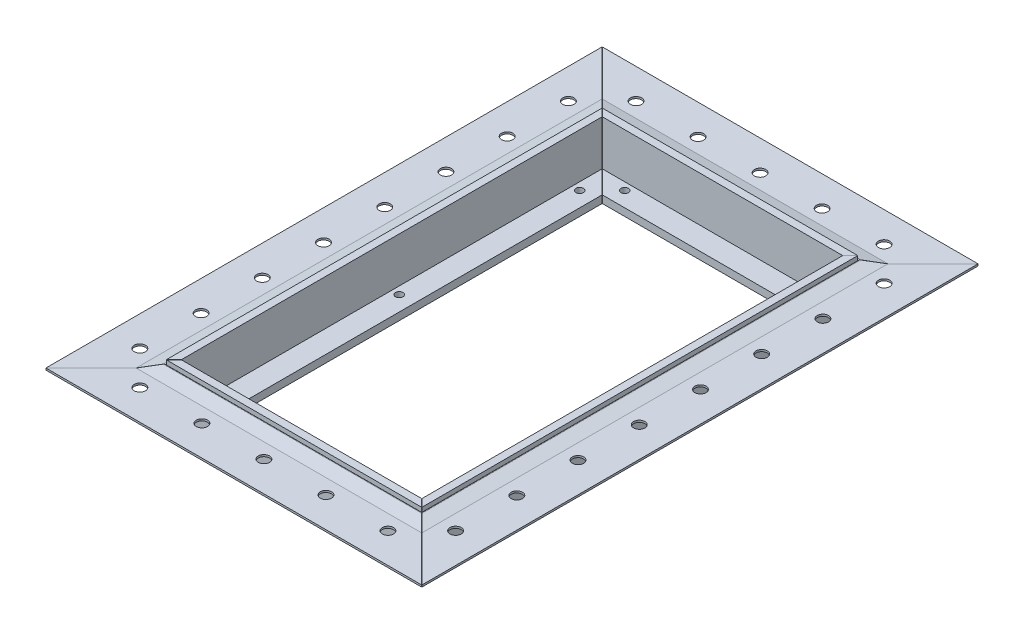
ISO-10303-21;
HEADER;
FILE_DESCRIPTION(('STEP AP214'),'2;1');
FILE_NAME('part.step','',(''),(''),'','','');
FILE_SCHEMA(('AUTOMOTIVE_DESIGN { 1 0 10303 214 1 1 1 1 }'));
ENDSEC;
DATA;
#1=APPLICATION_CONTEXT('core data for automotive mechanical design processes');
#2=APPLICATION_PROTOCOL_DEFINITION('international standard','automotive_design',2000,#1);
#3=PRODUCT_CONTEXT('',#1,'mechanical');
#4=PRODUCT('Part','Part','',(#3));
#5=PRODUCT_RELATED_PRODUCT_CATEGORY('part','',(#4));
#6=PRODUCT_DEFINITION_FORMATION('','',#4);
#7=PRODUCT_DEFINITION_CONTEXT('part definition',#1,'design');
#8=PRODUCT_DEFINITION('design','',#6,#7);
#9=PRODUCT_DEFINITION_SHAPE('','',#8);
#10=(LENGTH_UNIT() NAMED_UNIT(*) SI_UNIT(.MILLI.,.METRE.));
#11=(NAMED_UNIT(*) PLANE_ANGLE_UNIT() SI_UNIT($,.RADIAN.));
#12=(NAMED_UNIT(*) SI_UNIT($,.STERADIAN.) SOLID_ANGLE_UNIT());
#13=UNCERTAINTY_MEASURE_WITH_UNIT(LENGTH_MEASURE(1.E-05),#10,'distance_accuracy_value','');
#14=(GEOMETRIC_REPRESENTATION_CONTEXT(3) GLOBAL_UNCERTAINTY_ASSIGNED_CONTEXT((#13)) GLOBAL_UNIT_ASSIGNED_CONTEXT((#10,
#11,#12)) REPRESENTATION_CONTEXT('',''));
#15=CARTESIAN_POINT('',(0.,0.,0.));
#16=DIRECTION('',(0.,0.,1.));
#17=DIRECTION('',(1.,0.,0.));
#18=AXIS2_PLACEMENT_3D('',#15,#16,#17);
#19=CARTESIAN_POINT('',(0.,22.225,0.));
#20=DIRECTION('',(0.,1.,0.));
#21=DIRECTION('',(0.,0.,1.));
#22=AXIS2_PLACEMENT_3D('',#19,#20,#21);
#23=PLANE('',#22);
#24=DIRECTION('',(-0.707106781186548,0.,0.707106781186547));
#25=VECTOR('',#24,1.);
#26=CARTESIAN_POINT('',(-12.7179605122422,22.225,92.0570394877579));
#27=LINE('',#26,#25);
#28=CARTESIAN_POINT('',(-9.52500000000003,22.225,88.8640789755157));
#29=VERTEX_POINT('',#28);
#30=CARTESIAN_POINT('',(-12.7,22.225,92.0390789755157));
#31=VERTEX_POINT('',#30);
#32=EDGE_CURVE('E13',#29,#31,#27,.T.);
#33=ORIENTED_EDGE('',*,*,#32,.F.);
#34=DIRECTION('',(0.,0.,1.));
#35=VECTOR('',#34,1.);
#36=CARTESIAN_POINT('',(-9.52500000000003,22.225,-88.9));
#37=LINE('',#36,#35);
#38=CARTESIAN_POINT('',(-9.52500000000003,22.225,-88.8640789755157));
#39=VERTEX_POINT('',#38);
#40=EDGE_CURVE('E180',#39,#29,#37,.T.);
#41=ORIENTED_EDGE('',*,*,#40,.F.);
#42=DIRECTION('',(0.707106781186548,0.,0.707106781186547));
#43=VECTOR('',#42,1.);
#44=CARTESIAN_POINT('',(-12.7179605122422,22.225,-92.0570394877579));
#45=LINE('',#44,#43);
#46=CARTESIAN_POINT('',(-12.7,22.225,-92.0390789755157));
#47=VERTEX_POINT('',#46);
#48=EDGE_CURVE('E179',#47,#39,#45,.T.);
#49=ORIENTED_EDGE('',*,*,#48,.F.);
#50=DIRECTION('',(0.,0.,1.));
#51=VECTOR('',#50,1.);
#52=CARTESIAN_POINT('',(-12.7,22.225,-92.075));
#53=LINE('',#52,#51);
#54=EDGE_CURVE('E169',#47,#31,#53,.T.);
#55=ORIENTED_EDGE('',*,*,#54,.T.);
#56=EDGE_LOOP('',(#33,#41,#49,#55));
#57=FACE_BOUND('',#56,.T.);
#58=ADVANCED_FACE('F101',(#57),#23,.T.);
#59=CARTESIAN_POINT('',(0.,0.,0.));
#60=DIRECTION('',(0.,1.,0.));
#61=DIRECTION('',(0.,0.,1.));
#62=AXIS2_PLACEMENT_3D('',#59,#60,#61);
#63=PLANE('',#62);
#64=CARTESIAN_POINT('',(-6.35000000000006,0.,-76.2));
#65=DIRECTION('',(0.,1.,0.));
#66=DIRECTION('',(0.,0.,-1.));
#67=AXIS2_PLACEMENT_3D('',#64,#65,#66);
#68=CIRCLE('',#67,1.5875);
#69=CARTESIAN_POINT('',(-6.35000000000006,0.,-77.7875));
#70=VERTEX_POINT('',#69);
#71=EDGE_CURVE('E172',#70,#70,#68,.T.);
#72=ORIENTED_EDGE('',*,*,#71,.T.);
#73=EDGE_LOOP('',(#72));
#74=FACE_BOUND('',#73,.T.);
#75=CARTESIAN_POINT('',(-6.35000000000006,0.,0.));
#76=DIRECTION('',(0.,1.,0.));
#77=DIRECTION('',(0.,0.,-1.));
#78=AXIS2_PLACEMENT_3D('',#75,#76,#77);
#79=CIRCLE('',#78,1.5875);
#80=CARTESIAN_POINT('',(-6.35000000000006,0.,-1.58750000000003));
#81=VERTEX_POINT('',#80);
#82=EDGE_CURVE('E217',#81,#81,#79,.T.);
#83=ORIENTED_EDGE('',*,*,#82,.T.);
#84=EDGE_LOOP('',(#83));
#85=FACE_BOUND('',#84,.T.);
#86=CARTESIAN_POINT('',(-6.35000000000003,0.,76.2));
#87=DIRECTION('',(0.,1.,0.));
#88=DIRECTION('',(0.,0.,1.));
#89=AXIS2_PLACEMENT_3D('',#86,#87,#88);
#90=CIRCLE('',#89,1.5875);
#91=CARTESIAN_POINT('',(-6.35000000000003,0.,77.7875));
#92=VERTEX_POINT('',#91);
#93=EDGE_CURVE('E211',#92,#92,#90,.T.);
#94=ORIENTED_EDGE('',*,*,#93,.T.);
#95=EDGE_LOOP('',(#94));
#96=FACE_BOUND('',#95,.T.);
#97=DIRECTION('',(0.,0.,1.));
#98=VECTOR('',#97,1.);
#99=CARTESIAN_POINT('',(0.,0.,-79.375));
#100=LINE('',#99,#98);
#101=CARTESIAN_POINT('',(0.,0.,-79.3390789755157));
#102=VERTEX_POINT('',#101);
#103=CARTESIAN_POINT('',(0.,0.,79.3390789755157));
#104=VERTEX_POINT('',#103);
#105=EDGE_CURVE('E156',#102,#104,#100,.T.);
#106=ORIENTED_EDGE('',*,*,#105,.T.);
#107=DIRECTION('',(-0.707106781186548,0.,0.707106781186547));
#108=VECTOR('',#107,1.);
#109=CARTESIAN_POINT('',(-12.7179605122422,0.,92.0570394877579));
#110=LINE('',#109,#108);
#111=CARTESIAN_POINT('',(-12.7,0.,92.0390789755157));
#112=VERTEX_POINT('',#111);
#113=EDGE_CURVE('E104',#104,#112,#110,.T.);
#114=ORIENTED_EDGE('',*,*,#113,.T.);
#115=DIRECTION('',(0.,0.,1.));
#116=VECTOR('',#115,1.);
#117=CARTESIAN_POINT('',(-12.7,0.,-92.075));
#118=LINE('',#117,#116);
#119=CARTESIAN_POINT('',(-12.7,0.,-92.0390789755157));
#120=VERTEX_POINT('',#119);
#121=EDGE_CURVE('E191',#120,#112,#118,.T.);
#122=ORIENTED_EDGE('',*,*,#121,.F.);
#123=DIRECTION('',(0.707106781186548,0.,0.707106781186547));
#124=VECTOR('',#123,1.);
#125=CARTESIAN_POINT('',(-12.7179605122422,0.,-92.0570394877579));
#126=LINE('',#125,#124);
#127=EDGE_CURVE('E155',#120,#102,#126,.T.);
#128=ORIENTED_EDGE('',*,*,#127,.T.);
#129=EDGE_LOOP('',(#106,#114,#122,#128));
#130=FACE_BOUND('',#129,.T.);
#131=ADVANCED_FACE('F168',(#74,#85,#96,#130),#63,.F.);
#132=CARTESIAN_POINT('',(0.,3.175,0.));
#133=DIRECTION('',(0.,1.,0.));
#134=DIRECTION('',(0.,0.,1.));
#135=AXIS2_PLACEMENT_3D('',#132,#133,#134);
#136=PLANE('',#135);
#137=CARTESIAN_POINT('',(-6.35000000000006,3.175,-76.2));
#138=DIRECTION('',(0.,1.,0.));
#139=DIRECTION('',(0.,0.,-1.));
#140=AXIS2_PLACEMENT_3D('',#137,#138,#139);
#141=CIRCLE('',#140,1.5875);
#142=CARTESIAN_POINT('',(-6.35000000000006,3.175,-77.7875));
#143=VERTEX_POINT('',#142);
#144=EDGE_CURVE('E220',#143,#143,#141,.T.);
#145=ORIENTED_EDGE('',*,*,#144,.F.);
#146=EDGE_LOOP('',(#145));
#147=FACE_BOUND('',#146,.T.);
#148=CARTESIAN_POINT('',(-6.35000000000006,3.175,0.));
#149=DIRECTION('',(0.,1.,0.));
#150=DIRECTION('',(0.,0.,-1.));
#151=AXIS2_PLACEMENT_3D('',#148,#149,#150);
#152=CIRCLE('',#151,1.5875);
#153=CARTESIAN_POINT('',(-6.35000000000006,3.175,-1.58750000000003));
#154=VERTEX_POINT('',#153);
#155=EDGE_CURVE('E214',#154,#154,#152,.T.);
#156=ORIENTED_EDGE('',*,*,#155,.F.);
#157=EDGE_LOOP('',(#156));
#158=FACE_BOUND('',#157,.T.);
#159=CARTESIAN_POINT('',(-6.35000000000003,3.175,76.2));
#160=DIRECTION('',(0.,1.,0.));
#161=DIRECTION('',(0.,0.,1.));
#162=AXIS2_PLACEMENT_3D('',#159,#160,#161);
#163=CIRCLE('',#162,1.5875);
#164=CARTESIAN_POINT('',(-6.35000000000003,3.175,77.7875));
#165=VERTEX_POINT('',#164);
#166=EDGE_CURVE('E208',#165,#165,#163,.T.);
#167=ORIENTED_EDGE('',*,*,#166,.F.);
#168=EDGE_LOOP('',(#167));
#169=FACE_BOUND('',#168,.T.);
#170=DIRECTION('',(-0.707106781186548,0.,0.707106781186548));
#171=VECTOR('',#170,1.);
#172=CARTESIAN_POINT('',(39.6695394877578,3.175,39.6695394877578));
#173=LINE('',#172,#171);
#174=CARTESIAN_POINT('',(0.,3.175,79.3390789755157));
#175=VERTEX_POINT('',#174);
#176=CARTESIAN_POINT('',(-9.52500000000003,3.175,88.8640789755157));
#177=VERTEX_POINT('',#176);
#178=EDGE_CURVE('E164',#175,#177,#173,.T.);
#179=ORIENTED_EDGE('',*,*,#178,.F.);
#180=DIRECTION('',(0.,0.,1.));
#181=VECTOR('',#180,1.);
#182=CARTESIAN_POINT('',(0.,3.175,-79.375));
#183=LINE('',#182,#181);
#184=CARTESIAN_POINT('',(0.,3.175,-79.3390789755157));
#185=VERTEX_POINT('',#184);
#186=EDGE_CURVE('E163',#185,#175,#183,.T.);
#187=ORIENTED_EDGE('',*,*,#186,.F.);
#188=DIRECTION('',(0.707106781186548,0.,0.707106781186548));
#189=VECTOR('',#188,1.);
#190=CARTESIAN_POINT('',(39.6695394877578,3.175,-39.6695394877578));
#191=LINE('',#190,#189);
#192=CARTESIAN_POINT('',(-9.52500000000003,3.175,-88.8640789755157));
#193=VERTEX_POINT('',#192);
#194=EDGE_CURVE('E186',#193,#185,#191,.T.);
#195=ORIENTED_EDGE('',*,*,#194,.F.);
#196=DIRECTION('',(0.,0.,1.));
#197=VECTOR('',#196,1.);
#198=CARTESIAN_POINT('',(-9.52500000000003,3.175,-88.9));
#199=LINE('',#198,#197);
#200=EDGE_CURVE('E176',#193,#177,#199,.T.);
#201=ORIENTED_EDGE('',*,*,#200,.T.);
#202=EDGE_LOOP('',(#179,#187,#195,#201));
#203=FACE_BOUND('',#202,.T.);
#204=ADVANCED_FACE('F203',(#147,#158,#169,#203),#136,.T.);
#205=CARTESIAN_POINT('',(-12.7,22.225,-92.075));
#206=DIRECTION('',(1.,0.,0.));
#207=DIRECTION('',(0.,0.,-1.));
#208=AXIS2_PLACEMENT_3D('',#205,#206,#207);
#209=PLANE('',#208);
#210=ORIENTED_EDGE('',*,*,#121,.T.);
#211=DIRECTION('',(0.,1.,0.));
#212=VECTOR('',#211,1.);
#213=CARTESIAN_POINT('',(-12.7,22.225,92.0390789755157));
#214=LINE('',#213,#212);
#215=EDGE_CURVE('E115',#112,#31,#214,.T.);
#216=ORIENTED_EDGE('',*,*,#215,.T.);
#217=ORIENTED_EDGE('',*,*,#54,.F.);
#218=DIRECTION('',(0.,-1.,0.));
#219=VECTOR('',#218,1.);
#220=CARTESIAN_POINT('',(-12.7,22.225,-92.0390789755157));
#221=LINE('',#220,#219);
#222=EDGE_CURVE('E181',#47,#120,#221,.T.);
#223=ORIENTED_EDGE('',*,*,#222,.T.);
#224=EDGE_LOOP('',(#210,#216,#217,#223));
#225=FACE_BOUND('',#224,.T.);
#226=ADVANCED_FACE('F237',(#225),#209,.F.);
#227=CARTESIAN_POINT('',(-9.52500000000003,22.225,-88.9));
#228=DIRECTION('',(1.,0.,0.));
#229=DIRECTION('',(0.,0.,-1.));
#230=AXIS2_PLACEMENT_3D('',#227,#228,#229);
#231=PLANE('',#230);
#232=DIRECTION('',(0.,1.,0.));
#233=VECTOR('',#232,1.);
#234=CARTESIAN_POINT('',(-9.52500000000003,22.225,88.8640789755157));
#235=LINE('',#234,#233);
#236=EDGE_CURVE('E109',#177,#29,#235,.T.);
#237=ORIENTED_EDGE('',*,*,#236,.F.);
#238=ORIENTED_EDGE('',*,*,#200,.F.);
#239=DIRECTION('',(0.,-1.,0.));
#240=VECTOR('',#239,1.);
#241=CARTESIAN_POINT('',(-9.52500000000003,22.225,-88.8640789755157));
#242=LINE('',#241,#240);
#243=EDGE_CURVE('E184',#39,#193,#242,.T.);
#244=ORIENTED_EDGE('',*,*,#243,.F.);
#245=ORIENTED_EDGE('',*,*,#40,.T.);
#246=EDGE_LOOP('',(#237,#238,#244,#245));
#247=FACE_BOUND('',#246,.T.);
#248=ADVANCED_FACE('F199',(#247),#231,.T.);
#249=CARTESIAN_POINT('',(0.,3.175,-79.375));
#250=DIRECTION('',(1.,0.,0.));
#251=DIRECTION('',(0.,0.,-1.));
#252=AXIS2_PLACEMENT_3D('',#249,#250,#251);
#253=PLANE('',#252);
#254=DIRECTION('',(0.,1.,0.));
#255=VECTOR('',#254,1.);
#256=CARTESIAN_POINT('',(0.,3.175,79.3390789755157));
#257=LINE('',#256,#255);
#258=EDGE_CURVE('E149',#104,#175,#257,.T.);
#259=ORIENTED_EDGE('',*,*,#258,.F.);
#260=ORIENTED_EDGE('',*,*,#105,.F.);
#261=DIRECTION('',(0.,-1.,0.));
#262=VECTOR('',#261,1.);
#263=CARTESIAN_POINT('',(0.,3.175,-79.3390789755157));
#264=LINE('',#263,#262);
#265=EDGE_CURVE('E165',#185,#102,#264,.T.);
#266=ORIENTED_EDGE('',*,*,#265,.F.);
#267=ORIENTED_EDGE('',*,*,#186,.T.);
#268=EDGE_LOOP('',(#259,#260,#266,#267));
#269=FACE_BOUND('',#268,.T.);
#270=ADVANCED_FACE('F160',(#269),#253,.T.);
#271=CARTESIAN_POINT('',(-12.7179605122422,0.,-92.0570394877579));
#272=DIRECTION('',(-0.707106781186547,0.,0.707106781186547));
#273=DIRECTION('',(0.707106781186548,0.,0.707106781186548));
#274=AXIS2_PLACEMENT_3D('',#271,#272,#273);
#275=PLANE('',#274);
#276=ORIENTED_EDGE('',*,*,#48,.T.);
#277=ORIENTED_EDGE('',*,*,#243,.T.);
#278=ORIENTED_EDGE('',*,*,#194,.T.);
#279=ORIENTED_EDGE('',*,*,#265,.T.);
#280=ORIENTED_EDGE('',*,*,#127,.F.);
#281=ORIENTED_EDGE('',*,*,#222,.F.);
#282=EDGE_LOOP('',(#276,#277,#278,#279,#280,#281));
#283=FACE_BOUND('',#282,.T.);
#284=ADVANCED_FACE('F253',(#283),#275,.F.);
#285=CARTESIAN_POINT('',(-12.7179605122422,0.,92.0570394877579));
#286=DIRECTION('',(-0.707106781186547,0.,-0.707106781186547));
#287=DIRECTION('',(-0.707106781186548,0.,0.707106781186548));
#288=AXIS2_PLACEMENT_3D('',#285,#286,#287);
#289=PLANE('',#288);
#290=ORIENTED_EDGE('',*,*,#113,.F.);
#291=ORIENTED_EDGE('',*,*,#258,.T.);
#292=ORIENTED_EDGE('',*,*,#178,.T.);
#293=ORIENTED_EDGE('',*,*,#236,.T.);
#294=ORIENTED_EDGE('',*,*,#32,.T.);
#295=ORIENTED_EDGE('',*,*,#215,.F.);
#296=EDGE_LOOP('',(#290,#291,#292,#293,#294,#295));
#297=FACE_BOUND('',#296,.T.);
#298=ADVANCED_FACE('F148',(#297),#289,.F.);
#299=CARTESIAN_POINT('',(-6.35000000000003,0.,76.2));
#300=DIRECTION('',(0.,1.,0.));
#301=DIRECTION('',(0.,0.,1.));
#302=AXIS2_PLACEMENT_3D('',#299,#300,#301);
#303=CYLINDRICAL_SURFACE('',#302,1.5875);
#304=ORIENTED_EDGE('',*,*,#93,.F.);
#305=EDGE_LOOP('',(#304));
#306=FACE_BOUND('',#305,.T.);
#307=ORIENTED_EDGE('',*,*,#166,.T.);
#308=EDGE_LOOP('',(#307));
#309=FACE_BOUND('',#308,.T.);
#310=ADVANCED_FACE('F243',(#306,#309),#303,.F.);
#311=CARTESIAN_POINT('',(-6.35000000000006,0.,0.));
#312=DIRECTION('',(0.,1.,0.));
#313=DIRECTION('',(0.,0.,1.));
#314=AXIS2_PLACEMENT_3D('',#311,#312,#313);
#315=CYLINDRICAL_SURFACE('',#314,1.5875);
#316=ORIENTED_EDGE('',*,*,#82,.F.);
#317=EDGE_LOOP('',(#316));
#318=FACE_BOUND('',#317,.T.);
#319=ORIENTED_EDGE('',*,*,#155,.T.);
#320=EDGE_LOOP('',(#319));
#321=FACE_BOUND('',#320,.T.);
#322=ADVANCED_FACE('F231',(#318,#321),#315,.F.);
#323=CARTESIAN_POINT('',(-6.35000000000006,0.,-76.2));
#324=DIRECTION('',(0.,1.,0.));
#325=DIRECTION('',(0.,0.,1.));
#326=AXIS2_PLACEMENT_3D('',#323,#324,#325);
#327=CYLINDRICAL_SURFACE('',#326,1.5875);
#328=ORIENTED_EDGE('',*,*,#71,.F.);
#329=EDGE_LOOP('',(#328));
#330=FACE_BOUND('',#329,.T.);
#331=ORIENTED_EDGE('',*,*,#144,.T.);
#332=EDGE_LOOP('',(#331));
#333=FACE_BOUND('',#332,.T.);
#334=ADVANCED_FACE('F228',(#330,#333),#327,.F.);
#335=CLOSED_SHELL('',(#58,#131,#204,#226,#248,#270,#284,#298,#310,#322,#334));
#336=MANIFOLD_SOLID_BREP('B2',#335);
#337=CARTESIAN_POINT('',(95.2320394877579,0.,92.0929605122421));
#338=DIRECTION('',(-0.707106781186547,0.,0.707106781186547));
#339=DIRECTION('',(0.707106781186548,0.,0.707106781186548));
#340=AXIS2_PLACEMENT_3D('',#337,#338,#339);
#341=PLANE('',#340);
#342=DIRECTION('',(0.707106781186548,0.,0.707106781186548));
#343=VECTOR('',#342,1.);
#344=CARTESIAN_POINT('',(95.2320394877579,0.,92.0929605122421));
#345=LINE('',#344,#343);
#346=CARTESIAN_POINT('',(82.5140789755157,0.,79.375));
#347=VERTEX_POINT('',#346);
#348=CARTESIAN_POINT('',(95.2140789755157,0.,92.075));
#349=VERTEX_POINT('',#348);
#350=EDGE_CURVE('E420',#347,#349,#345,.T.);
#351=ORIENTED_EDGE('',*,*,#350,.F.);
#352=DIRECTION('',(0.,1.,0.));
#353=VECTOR('',#352,1.);
#354=CARTESIAN_POINT('',(82.5140789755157,3.175,79.375));
#355=LINE('',#354,#353);
#356=CARTESIAN_POINT('',(82.5140789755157,3.175,79.375));
#357=VERTEX_POINT('',#356);
#358=EDGE_CURVE('E436',#347,#357,#355,.T.);
#359=ORIENTED_EDGE('',*,*,#358,.T.);
#360=DIRECTION('',(0.707106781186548,0.,0.707106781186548));
#361=VECTOR('',#360,1.);
#362=CARTESIAN_POINT('',(1.56953948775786,3.175,-1.56953948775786));
#363=LINE('',#362,#361);
#364=CARTESIAN_POINT('',(92.0390789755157,3.175,88.9));
#365=VERTEX_POINT('',#364);
#366=EDGE_CURVE('E433',#357,#365,#363,.T.);
#367=ORIENTED_EDGE('',*,*,#366,.T.);
#368=DIRECTION('',(0.,1.,0.));
#369=VECTOR('',#368,1.);
#370=CARTESIAN_POINT('',(92.0390789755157,22.225,88.9));
#371=LINE('',#370,#369);
#372=CARTESIAN_POINT('',(92.0390789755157,22.225,88.9));
#373=VERTEX_POINT('',#372);
#374=EDGE_CURVE('E430',#365,#373,#371,.T.);
#375=ORIENTED_EDGE('',*,*,#374,.T.);
#376=DIRECTION('',(0.707106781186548,0.,0.707106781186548));
#377=VECTOR('',#376,1.);
#378=CARTESIAN_POINT('',(95.2320394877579,22.225,92.0929605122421));
#379=LINE('',#378,#377);
#380=CARTESIAN_POINT('',(95.2140789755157,22.225,92.075));
#381=VERTEX_POINT('',#380);
#382=EDGE_CURVE('E360',#373,#381,#379,.T.);
#383=ORIENTED_EDGE('',*,*,#382,.T.);
#384=DIRECTION('',(0.,1.,0.));
#385=VECTOR('',#384,1.);
#386=CARTESIAN_POINT('',(95.2140789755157,22.225,92.075));
#387=LINE('',#386,#385);
#388=EDGE_CURVE('E421',#349,#381,#387,.T.);
#389=ORIENTED_EDGE('',*,*,#388,.F.);
#390=EDGE_LOOP('',(#351,#359,#367,#375,#383,#389));
#391=FACE_BOUND('',#390,.T.);
#392=ADVANCED_FACE('F352',(#391),#341,.F.);
#393=CARTESIAN_POINT('',(0.,3.175,79.375));
#394=DIRECTION('',(0.,0.,-1.));
#395=DIRECTION('',(-1.,0.,0.));
#396=AXIS2_PLACEMENT_3D('',#393,#394,#395);
#397=PLANE('',#396);
#398=DIRECTION('',(0.,-1.,0.));
#399=VECTOR('',#398,1.);
#400=CARTESIAN_POINT('',(0.035921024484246,3.175,79.375));
#401=LINE('',#400,#399);
#402=CARTESIAN_POINT('',(0.035921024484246,3.175,79.375));
#403=VERTEX_POINT('',#402);
#404=CARTESIAN_POINT('',(0.0359210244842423,0.,79.375));
#405=VERTEX_POINT('',#404);
#406=EDGE_CURVE('E99',#403,#405,#401,.T.);
#407=ORIENTED_EDGE('',*,*,#406,.F.);
#408=DIRECTION('',(1.,0.,0.));
#409=VECTOR('',#408,1.);
#410=CARTESIAN_POINT('',(0.,3.175,79.375));
#411=LINE('',#410,#409);
#412=EDGE_CURVE('E441',#403,#357,#411,.T.);
#413=ORIENTED_EDGE('',*,*,#412,.T.);
#414=ORIENTED_EDGE('',*,*,#358,.F.);
#415=DIRECTION('',(1.,0.,0.));
#416=VECTOR('',#415,1.);
#417=CARTESIAN_POINT('',(0.,0.,79.375));
#418=LINE('',#417,#416);
#419=EDGE_CURVE('E438',#405,#347,#418,.T.);
#420=ORIENTED_EDGE('',*,*,#419,.F.);
#421=EDGE_LOOP('',(#407,#413,#414,#420));
#422=FACE_BOUND('',#421,.T.);
#423=ADVANCED_FACE('F496',(#422),#397,.T.);
#424=CARTESIAN_POINT('',(-9.52500000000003,22.225,88.9));
#425=DIRECTION('',(0.,0.,-1.));
#426=DIRECTION('',(-1.,0.,0.));
#427=AXIS2_PLACEMENT_3D('',#424,#425,#426);
#428=PLANE('',#427);
#429=DIRECTION('',(0.,-1.,0.));
#430=VECTOR('',#429,1.);
#431=CARTESIAN_POINT('',(-9.48907897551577,22.225,88.9));
#432=LINE('',#431,#430);
#433=CARTESIAN_POINT('',(-9.48907897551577,22.225,88.9));
#434=VERTEX_POINT('',#433);
#435=CARTESIAN_POINT('',(-9.48907897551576,3.175,88.9));
#436=VERTEX_POINT('',#435);
#437=EDGE_CURVE('E415',#434,#436,#432,.T.);
#438=ORIENTED_EDGE('',*,*,#437,.F.);
#439=DIRECTION('',(1.,0.,0.));
#440=VECTOR('',#439,1.);
#441=CARTESIAN_POINT('',(-9.52500000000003,22.225,88.9));
#442=LINE('',#441,#440);
#443=EDGE_CURVE('E424',#434,#373,#442,.T.);
#444=ORIENTED_EDGE('',*,*,#443,.T.);
#445=ORIENTED_EDGE('',*,*,#374,.F.);
#446=DIRECTION('',(1.,0.,0.));
#447=VECTOR('',#446,1.);
#448=CARTESIAN_POINT('',(-9.52500000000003,3.175,88.9));
#449=LINE('',#448,#447);
#450=EDGE_CURVE('E422',#436,#365,#449,.T.);
#451=ORIENTED_EDGE('',*,*,#450,.F.);
#452=EDGE_LOOP('',(#438,#444,#445,#451));
#453=FACE_BOUND('',#452,.T.);
#454=ADVANCED_FACE('F482',(#453),#428,.T.);
#455=CARTESIAN_POINT('',(0.,3.175,0.));
#456=DIRECTION('',(0.,1.,0.));
#457=DIRECTION('',(0.,0.,1.));
#458=AXIS2_PLACEMENT_3D('',#455,#456,#457);
#459=PLANE('',#458);
#460=CARTESIAN_POINT('',(79.3644789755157,3.175,85.725));
#461=DIRECTION('',(0.,1.,0.));
#462=DIRECTION('',(0.,0.,-1.));
#463=AXIS2_PLACEMENT_3D('',#460,#461,#462);
#464=CIRCLE('',#463,1.58749999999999);
#465=CARTESIAN_POINT('',(79.3644789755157,3.175,84.1375));
#466=VERTEX_POINT('',#465);
#467=EDGE_CURVE('E464',#466,#466,#464,.T.);
#468=ORIENTED_EDGE('',*,*,#467,.F.);
#469=EDGE_LOOP('',(#468));
#470=FACE_BOUND('',#469,.T.);
#471=CARTESIAN_POINT('',(3.1855210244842,3.175,85.725));
#472=DIRECTION('',(0.,1.,0.));
#473=DIRECTION('',(0.,0.,1.));
#474=AXIS2_PLACEMENT_3D('',#471,#472,#473);
#475=CIRCLE('',#474,1.5875);
#476=CARTESIAN_POINT('',(3.1855210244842,3.175,87.3125));
#477=VERTEX_POINT('',#476);
#478=EDGE_CURVE('E458',#477,#477,#475,.T.);
#479=ORIENTED_EDGE('',*,*,#478,.F.);
#480=EDGE_LOOP('',(#479));
#481=FACE_BOUND('',#480,.T.);
#482=DIRECTION('',(0.707106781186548,0.,-0.707106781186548));
#483=VECTOR('',#482,1.);
#484=CARTESIAN_POINT('',(39.7054605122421,3.175,39.7054605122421));
#485=LINE('',#484,#483);
#486=EDGE_CURVE('E366',#436,#403,#485,.T.);
#487=ORIENTED_EDGE('',*,*,#486,.F.);
#488=ORIENTED_EDGE('',*,*,#450,.T.);
#489=ORIENTED_EDGE('',*,*,#366,.F.);
#490=ORIENTED_EDGE('',*,*,#412,.F.);
#491=EDGE_LOOP('',(#487,#488,#489,#490));
#492=FACE_BOUND('',#491,.T.);
#493=ADVANCED_FACE('F479',(#470,#481,#492),#459,.T.);
#494=CARTESIAN_POINT('',(-12.7,22.225,92.075));
#495=DIRECTION('',(0.,0.,-1.));
#496=DIRECTION('',(-1.,0.,0.));
#497=AXIS2_PLACEMENT_3D('',#494,#495,#496);
#498=PLANE('',#497);
#499=DIRECTION('',(1.,0.,0.));
#500=VECTOR('',#499,1.);
#501=CARTESIAN_POINT('',(-12.7,22.225,92.075));
#502=LINE('',#501,#500);
#503=CARTESIAN_POINT('',(-12.6640789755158,22.225,92.075));
#504=VERTEX_POINT('',#503);
#505=EDGE_CURVE('E414',#504,#381,#502,.T.);
#506=ORIENTED_EDGE('',*,*,#505,.F.);
#507=DIRECTION('',(0.,-1.,0.));
#508=VECTOR('',#507,1.);
#509=CARTESIAN_POINT('',(-12.6640789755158,22.225,92.075));
#510=LINE('',#509,#508);
#511=CARTESIAN_POINT('',(-12.6640789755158,0.,92.075));
#512=VERTEX_POINT('',#511);
#513=EDGE_CURVE('E406',#504,#512,#510,.T.);
#514=ORIENTED_EDGE('',*,*,#513,.T.);
#515=DIRECTION('',(1.,0.,0.));
#516=VECTOR('',#515,1.);
#517=CARTESIAN_POINT('',(-12.7,0.,92.075));
#518=LINE('',#517,#516);
#519=EDGE_CURVE('E374',#512,#349,#518,.T.);
#520=ORIENTED_EDGE('',*,*,#519,.T.);
#521=ORIENTED_EDGE('',*,*,#388,.T.);
#522=EDGE_LOOP('',(#506,#514,#520,#521));
#523=FACE_BOUND('',#522,.T.);
#524=ADVANCED_FACE('F413',(#523),#498,.F.);
#525=CARTESIAN_POINT('',(0.,0.,0.));
#526=DIRECTION('',(0.,1.,0.));
#527=DIRECTION('',(0.,0.,1.));
#528=AXIS2_PLACEMENT_3D('',#525,#526,#527);
#529=PLANE('',#528);
#530=CARTESIAN_POINT('',(79.3644789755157,0.,85.725));
#531=DIRECTION('',(0.,1.,0.));
#532=DIRECTION('',(0.,0.,-1.));
#533=AXIS2_PLACEMENT_3D('',#530,#531,#532);
#534=CIRCLE('',#533,1.58749999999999);
#535=CARTESIAN_POINT('',(79.3644789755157,0.,84.1375));
#536=VERTEX_POINT('',#535);
#537=EDGE_CURVE('E456',#536,#536,#534,.T.);
#538=ORIENTED_EDGE('',*,*,#537,.T.);
#539=EDGE_LOOP('',(#538));
#540=FACE_BOUND('',#539,.T.);
#541=CARTESIAN_POINT('',(3.1855210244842,0.,85.725));
#542=DIRECTION('',(0.,1.,0.));
#543=DIRECTION('',(0.,0.,1.));
#544=AXIS2_PLACEMENT_3D('',#541,#542,#543);
#545=CIRCLE('',#544,1.5875);
#546=CARTESIAN_POINT('',(3.1855210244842,0.,87.3125));
#547=VERTEX_POINT('',#546);
#548=EDGE_CURVE('E461',#547,#547,#545,.T.);
#549=ORIENTED_EDGE('',*,*,#548,.T.);
#550=EDGE_LOOP('',(#549));
#551=FACE_BOUND('',#550,.T.);
#552=ORIENTED_EDGE('',*,*,#519,.F.);
#553=DIRECTION('',(0.707106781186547,0.,-0.707106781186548));
#554=VECTOR('',#553,1.);
#555=CARTESIAN_POINT('',(-12.6820394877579,0.,92.0929605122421));
#556=LINE('',#555,#554);
#557=EDGE_CURVE('E404',#512,#405,#556,.T.);
#558=ORIENTED_EDGE('',*,*,#557,.T.);
#559=ORIENTED_EDGE('',*,*,#419,.T.);
#560=ORIENTED_EDGE('',*,*,#350,.T.);
#561=EDGE_LOOP('',(#552,#558,#559,#560));
#562=FACE_BOUND('',#561,.T.);
#563=ADVANCED_FACE('F418',(#540,#551,#562),#529,.F.);
#564=CARTESIAN_POINT('',(0.,22.225,0.));
#565=DIRECTION('',(0.,1.,0.));
#566=DIRECTION('',(0.,0.,1.));
#567=AXIS2_PLACEMENT_3D('',#564,#565,#566);
#568=PLANE('',#567);
#569=DIRECTION('',(0.707106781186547,0.,-0.707106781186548));
#570=VECTOR('',#569,1.);
#571=CARTESIAN_POINT('',(-12.6820394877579,22.225,92.0929605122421));
#572=LINE('',#571,#570);
#573=EDGE_CURVE('E410',#504,#434,#572,.T.);
#574=ORIENTED_EDGE('',*,*,#573,.F.);
#575=ORIENTED_EDGE('',*,*,#505,.T.);
#576=ORIENTED_EDGE('',*,*,#382,.F.);
#577=ORIENTED_EDGE('',*,*,#443,.F.);
#578=EDGE_LOOP('',(#574,#575,#576,#577));
#579=FACE_BOUND('',#578,.T.);
#580=ADVANCED_FACE('F354',(#579),#568,.T.);
#581=CARTESIAN_POINT('',(-12.6820394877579,0.,92.0929605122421));
#582=DIRECTION('',(0.707106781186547,0.,0.707106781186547));
#583=DIRECTION('',(0.707106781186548,0.,-0.707106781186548));
#584=AXIS2_PLACEMENT_3D('',#581,#582,#583);
#585=PLANE('',#584);
#586=ORIENTED_EDGE('',*,*,#573,.T.);
#587=ORIENTED_EDGE('',*,*,#437,.T.);
#588=ORIENTED_EDGE('',*,*,#486,.T.);
#589=ORIENTED_EDGE('',*,*,#406,.T.);
#590=ORIENTED_EDGE('',*,*,#557,.F.);
#591=ORIENTED_EDGE('',*,*,#513,.F.);
#592=EDGE_LOOP('',(#586,#587,#588,#589,#590,#591));
#593=FACE_BOUND('',#592,.T.);
#594=ADVANCED_FACE('F405',(#593),#585,.F.);
#595=CARTESIAN_POINT('',(3.1855210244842,0.,85.725));
#596=DIRECTION('',(0.,1.,0.));
#597=DIRECTION('',(0.,0.,1.));
#598=AXIS2_PLACEMENT_3D('',#595,#596,#597);
#599=CYLINDRICAL_SURFACE('',#598,1.5875);
#600=ORIENTED_EDGE('',*,*,#548,.F.);
#601=EDGE_LOOP('',(#600));
#602=FACE_BOUND('',#601,.T.);
#603=ORIENTED_EDGE('',*,*,#478,.T.);
#604=EDGE_LOOP('',(#603));
#605=FACE_BOUND('',#604,.T.);
#606=ADVANCED_FACE('F475',(#602,#605),#599,.F.);
#607=CARTESIAN_POINT('',(79.3644789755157,0.,85.725));
#608=DIRECTION('',(0.,1.,0.));
#609=DIRECTION('',(0.,0.,1.));
#610=AXIS2_PLACEMENT_3D('',#607,#608,#609);
#611=CYLINDRICAL_SURFACE('',#610,1.58749999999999);
#612=ORIENTED_EDGE('',*,*,#537,.F.);
#613=EDGE_LOOP('',(#612));
#614=FACE_BOUND('',#613,.T.);
#615=ORIENTED_EDGE('',*,*,#467,.T.);
#616=EDGE_LOOP('',(#615));
#617=FACE_BOUND('',#616,.T.);
#618=ADVANCED_FACE('F472',(#614,#617),#611,.F.);
#619=CLOSED_SHELL('',(#392,#423,#454,#493,#524,#563,#580,#594,#606,#618));
#620=MANIFOLD_SOLID_BREP('B7',#619);
#621=CARTESIAN_POINT('',(95.2679605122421,0.,-92.0570394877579));
#622=DIRECTION('',(0.707106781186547,0.,0.707106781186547));
#623=DIRECTION('',(0.707106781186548,0.,-0.707106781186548));
#624=AXIS2_PLACEMENT_3D('',#621,#622,#623);
#625=PLANE('',#624);
#626=DIRECTION('',(0.707106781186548,0.,-0.707106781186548));
#627=VECTOR('',#626,1.);
#628=CARTESIAN_POINT('',(95.2679605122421,0.,-92.0570394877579));
#629=LINE('',#628,#627);
#630=CARTESIAN_POINT('',(82.55,0.,-79.3390789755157));
#631=VERTEX_POINT('',#630);
#632=CARTESIAN_POINT('',(95.25,0.,-92.0390789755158));
#633=VERTEX_POINT('',#632);
#634=EDGE_CURVE('E650',#631,#633,#629,.T.);
#635=ORIENTED_EDGE('',*,*,#634,.F.);
#636=DIRECTION('',(0.,1.,0.));
#637=VECTOR('',#636,1.);
#638=CARTESIAN_POINT('',(82.55,3.175,-79.3390789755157));
#639=LINE('',#638,#637);
#640=CARTESIAN_POINT('',(82.55,3.175,-79.3390789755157));
#641=VERTEX_POINT('',#640);
#642=EDGE_CURVE('E659',#631,#641,#639,.T.);
#643=ORIENTED_EDGE('',*,*,#642,.T.);
#644=DIRECTION('',(0.707106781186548,0.,-0.707106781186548));
#645=VECTOR('',#644,1.);
#646=CARTESIAN_POINT('',(1.60546051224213,3.175,1.60546051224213));
#647=LINE('',#646,#645);
#648=CARTESIAN_POINT('',(92.075,3.175,-88.8640789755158));
#649=VERTEX_POINT('',#648);
#650=EDGE_CURVE('E669',#641,#649,#647,.T.);
#651=ORIENTED_EDGE('',*,*,#650,.T.);
#652=DIRECTION('',(0.,1.,0.));
#653=VECTOR('',#652,1.);
#654=CARTESIAN_POINT('',(92.075,22.225,-88.8640789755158));
#655=LINE('',#654,#653);
#656=CARTESIAN_POINT('',(92.075,22.225,-88.8640789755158));
#657=VERTEX_POINT('',#656);
#658=EDGE_CURVE('E666',#649,#657,#655,.T.);
#659=ORIENTED_EDGE('',*,*,#658,.T.);
#660=DIRECTION('',(0.707106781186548,0.,-0.707106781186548));
#661=VECTOR('',#660,1.);
#662=CARTESIAN_POINT('',(95.2679605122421,22.225,-92.0570394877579));
#663=LINE('',#662,#661);
#664=CARTESIAN_POINT('',(95.25,22.225,-92.0390789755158));
#665=VERTEX_POINT('',#664);
#666=EDGE_CURVE('E590',#657,#665,#663,.T.);
#667=ORIENTED_EDGE('',*,*,#666,.T.);
#668=DIRECTION('',(0.,1.,0.));
#669=VECTOR('',#668,1.);
#670=CARTESIAN_POINT('',(95.25,22.225,-92.0390789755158));
#671=LINE('',#670,#669);
#672=EDGE_CURVE('E651',#633,#665,#671,.T.);
#673=ORIENTED_EDGE('',*,*,#672,.F.);
#674=EDGE_LOOP('',(#635,#643,#651,#659,#667,#673));
#675=FACE_BOUND('',#674,.T.);
#676=ADVANCED_FACE('F582',(#675),#625,.F.);
#677=CARTESIAN_POINT('',(82.55,3.175,-79.375));
#678=DIRECTION('',(-1.,0.,0.));
#679=DIRECTION('',(0.,0.,1.));
#680=AXIS2_PLACEMENT_3D('',#677,#678,#679);
#681=PLANE('',#680);
#682=DIRECTION('',(0.,-1.,0.));
#683=VECTOR('',#682,1.);
#684=CARTESIAN_POINT('',(82.55,3.175,79.3390789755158));
#685=LINE('',#684,#683);
#686=CARTESIAN_POINT('',(82.55,3.175,79.3390789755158));
#687=VERTEX_POINT('',#686);
#688=CARTESIAN_POINT('',(82.55,0.,79.3390789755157));
#689=VERTEX_POINT('',#688);
#690=EDGE_CURVE('E350',#687,#689,#685,.T.);
#691=ORIENTED_EDGE('',*,*,#690,.F.);
#692=DIRECTION('',(0.,0.,-1.));
#693=VECTOR('',#692,1.);
#694=CARTESIAN_POINT('',(82.55,3.175,-79.375));
#695=LINE('',#694,#693);
#696=EDGE_CURVE('E662',#687,#641,#695,.T.);
#697=ORIENTED_EDGE('',*,*,#696,.T.);
#698=ORIENTED_EDGE('',*,*,#642,.F.);
#699=DIRECTION('',(0.,0.,-1.));
#700=VECTOR('',#699,1.);
#701=CARTESIAN_POINT('',(82.55,0.,-79.375));
#702=LINE('',#701,#700);
#703=EDGE_CURVE('E661',#689,#631,#702,.T.);
#704=ORIENTED_EDGE('',*,*,#703,.F.);
#705=EDGE_LOOP('',(#691,#697,#698,#704));
#706=FACE_BOUND('',#705,.T.);
#707=ADVANCED_FACE('F695',(#706),#681,.T.);
#708=CARTESIAN_POINT('',(92.075,22.225,-88.9));
#709=DIRECTION('',(-1.,0.,0.));
#710=DIRECTION('',(0.,0.,1.));
#711=AXIS2_PLACEMENT_3D('',#708,#709,#710);
#712=PLANE('',#711);
#713=DIRECTION('',(0.,-1.,0.));
#714=VECTOR('',#713,1.);
#715=CARTESIAN_POINT('',(92.075,22.225,88.8640789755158));
#716=LINE('',#715,#714);
#717=CARTESIAN_POINT('',(92.075,22.225,88.8640789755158));
#718=VERTEX_POINT('',#717);
#719=CARTESIAN_POINT('',(92.075,3.175,88.8640789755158));
#720=VERTEX_POINT('',#719);
#721=EDGE_CURVE('E645',#718,#720,#716,.T.);
#722=ORIENTED_EDGE('',*,*,#721,.F.);
#723=DIRECTION('',(0.,0.,-1.));
#724=VECTOR('',#723,1.);
#725=CARTESIAN_POINT('',(92.075,22.225,-88.9));
#726=LINE('',#725,#724);
#727=EDGE_CURVE('E654',#718,#657,#726,.T.);
#728=ORIENTED_EDGE('',*,*,#727,.T.);
#729=ORIENTED_EDGE('',*,*,#658,.F.);
#730=DIRECTION('',(0.,0.,-1.));
#731=VECTOR('',#730,1.);
#732=CARTESIAN_POINT('',(92.075,3.175,-88.9));
#733=LINE('',#732,#731);
#734=EDGE_CURVE('E652',#720,#649,#733,.T.);
#735=ORIENTED_EDGE('',*,*,#734,.F.);
#736=EDGE_LOOP('',(#722,#728,#729,#735));
#737=FACE_BOUND('',#736,.T.);
#738=ADVANCED_FACE('F693',(#737),#712,.T.);
#739=CARTESIAN_POINT('',(0.,3.175,0.));
#740=DIRECTION('',(0.,1.,0.));
#741=DIRECTION('',(0.,0.,1.));
#742=AXIS2_PLACEMENT_3D('',#739,#740,#741);
#743=PLANE('',#742);
#744=CARTESIAN_POINT('',(88.9,3.175,-76.2));
#745=DIRECTION('',(0.,1.,0.));
#746=DIRECTION('',(0.,0.,1.));
#747=AXIS2_PLACEMENT_3D('',#744,#745,#746);
#748=CIRCLE('',#747,1.58750000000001);
#749=CARTESIAN_POINT('',(88.9,3.175,-74.6125));
#750=VERTEX_POINT('',#749);
#751=EDGE_CURVE('E682',#750,#750,#748,.T.);
#752=ORIENTED_EDGE('',*,*,#751,.F.);
#753=EDGE_LOOP('',(#752));
#754=FACE_BOUND('',#753,.T.);
#755=CARTESIAN_POINT('',(88.9,3.175,0.));
#756=DIRECTION('',(0.,1.,0.));
#757=DIRECTION('',(0.,0.,1.));
#758=AXIS2_PLACEMENT_3D('',#755,#756,#757);
#759=CIRCLE('',#758,1.58750000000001);
#760=CARTESIAN_POINT('',(88.9,3.175,1.58749999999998));
#761=VERTEX_POINT('',#760);
#762=EDGE_CURVE('E726',#761,#761,#759,.T.);
#763=ORIENTED_EDGE('',*,*,#762,.F.);
#764=EDGE_LOOP('',(#763));
#765=FACE_BOUND('',#764,.T.);
#766=CARTESIAN_POINT('',(88.8999999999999,3.175,76.2));
#767=DIRECTION('',(0.,1.,0.));
#768=DIRECTION('',(0.,0.,-1.));
#769=AXIS2_PLACEMENT_3D('',#766,#767,#768);
#770=CIRCLE('',#769,1.58750000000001);
#771=CARTESIAN_POINT('',(88.8999999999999,3.175,74.6125));
#772=VERTEX_POINT('',#771);
#773=EDGE_CURVE('E727',#772,#772,#770,.T.);
#774=ORIENTED_EDGE('',*,*,#773,.F.);
#775=EDGE_LOOP('',(#774));
#776=FACE_BOUND('',#775,.T.);
#777=DIRECTION('',(-0.707106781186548,0.,-0.707106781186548));
#778=VECTOR('',#777,1.);
#779=CARTESIAN_POINT('',(1.60546051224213,3.175,-1.60546051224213));
#780=LINE('',#779,#778);
#781=EDGE_CURVE('E596',#720,#687,#780,.T.);
#782=ORIENTED_EDGE('',*,*,#781,.F.);
#783=ORIENTED_EDGE('',*,*,#734,.T.);
#784=ORIENTED_EDGE('',*,*,#650,.F.);
#785=ORIENTED_EDGE('',*,*,#696,.F.);
#786=EDGE_LOOP('',(#782,#783,#784,#785));
#787=FACE_BOUND('',#786,.T.);
#788=ADVANCED_FACE('F691',(#754,#765,#776,#787),#743,.T.);
#789=CARTESIAN_POINT('',(95.25,22.225,-92.075));
#790=DIRECTION('',(-1.,0.,0.));
#791=DIRECTION('',(0.,0.,1.));
#792=AXIS2_PLACEMENT_3D('',#789,#790,#791);
#793=PLANE('',#792);
#794=DIRECTION('',(0.,0.,-1.));
#795=VECTOR('',#794,1.);
#796=CARTESIAN_POINT('',(95.25,22.225,-92.075));
#797=LINE('',#796,#795);
#798=CARTESIAN_POINT('',(95.25,22.225,92.0390789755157));
#799=VERTEX_POINT('',#798);
#800=EDGE_CURVE('E644',#799,#665,#797,.T.);
#801=ORIENTED_EDGE('',*,*,#800,.F.);
#802=DIRECTION('',(0.,-1.,0.));
#803=VECTOR('',#802,1.);
#804=CARTESIAN_POINT('',(95.25,22.225,92.0390789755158));
#805=LINE('',#804,#803);
#806=CARTESIAN_POINT('',(95.25,0.,92.0390789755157));
#807=VERTEX_POINT('',#806);
#808=EDGE_CURVE('E636',#799,#807,#805,.T.);
#809=ORIENTED_EDGE('',*,*,#808,.T.);
#810=DIRECTION('',(0.,0.,-1.));
#811=VECTOR('',#810,1.);
#812=CARTESIAN_POINT('',(95.25,0.,-92.075));
#813=LINE('',#812,#811);
#814=EDGE_CURVE('E604',#807,#633,#813,.T.);
#815=ORIENTED_EDGE('',*,*,#814,.T.);
#816=ORIENTED_EDGE('',*,*,#672,.T.);
#817=EDGE_LOOP('',(#801,#809,#815,#816));
#818=FACE_BOUND('',#817,.T.);
#819=ADVANCED_FACE('F643',(#818),#793,.F.);
#820=CARTESIAN_POINT('',(0.,0.,0.));
#821=DIRECTION('',(0.,1.,0.));
#822=DIRECTION('',(0.,0.,1.));
#823=AXIS2_PLACEMENT_3D('',#820,#821,#822);
#824=PLANE('',#823);
#825=CARTESIAN_POINT('',(88.9,0.,-76.2));
#826=DIRECTION('',(0.,1.,0.));
#827=DIRECTION('',(0.,0.,1.));
#828=AXIS2_PLACEMENT_3D('',#825,#826,#827);
#829=CIRCLE('',#828,1.58750000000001);
#830=CARTESIAN_POINT('',(88.9,0.,-74.6125));
#831=VERTEX_POINT('',#830);
#832=EDGE_CURVE('E679',#831,#831,#829,.T.);
#833=ORIENTED_EDGE('',*,*,#832,.T.);
#834=EDGE_LOOP('',(#833));
#835=FACE_BOUND('',#834,.T.);
#836=CARTESIAN_POINT('',(88.9,0.,0.));
#837=DIRECTION('',(0.,1.,0.));
#838=DIRECTION('',(0.,0.,1.));
#839=AXIS2_PLACEMENT_3D('',#836,#837,#838);
#840=CIRCLE('',#839,1.58750000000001);
#841=CARTESIAN_POINT('',(88.9,0.,1.58749999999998));
#842=VERTEX_POINT('',#841);
#843=EDGE_CURVE('E721',#842,#842,#840,.T.);
#844=ORIENTED_EDGE('',*,*,#843,.T.);
#845=EDGE_LOOP('',(#844));
#846=FACE_BOUND('',#845,.T.);
#847=CARTESIAN_POINT('',(88.8999999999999,0.,76.2));
#848=DIRECTION('',(0.,1.,0.));
#849=DIRECTION('',(0.,0.,-1.));
#850=AXIS2_PLACEMENT_3D('',#847,#848,#849);
#851=CIRCLE('',#850,1.58750000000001);
#852=CARTESIAN_POINT('',(88.8999999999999,0.,74.6125));
#853=VERTEX_POINT('',#852);
#854=EDGE_CURVE('E724',#853,#853,#851,.T.);
#855=ORIENTED_EDGE('',*,*,#854,.T.);
#856=EDGE_LOOP('',(#855));
#857=FACE_BOUND('',#856,.T.);
#858=ORIENTED_EDGE('',*,*,#814,.F.);
#859=DIRECTION('',(-0.707106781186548,0.,-0.707106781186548));
#860=VECTOR('',#859,1.);
#861=CARTESIAN_POINT('',(95.2679605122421,0.,92.0570394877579));
#862=LINE('',#861,#860);
#863=EDGE_CURVE('E634',#807,#689,#862,.T.);
#864=ORIENTED_EDGE('',*,*,#863,.T.);
#865=ORIENTED_EDGE('',*,*,#703,.T.);
#866=ORIENTED_EDGE('',*,*,#634,.T.);
#867=EDGE_LOOP('',(#858,#864,#865,#866));
#868=FACE_BOUND('',#867,.T.);
#869=ADVANCED_FACE('F648',(#835,#846,#857,#868),#824,.F.);
#870=CARTESIAN_POINT('',(0.,22.225,0.));
#871=DIRECTION('',(0.,1.,0.));
#872=DIRECTION('',(0.,0.,1.));
#873=AXIS2_PLACEMENT_3D('',#870,#871,#872);
#874=PLANE('',#873);
#875=DIRECTION('',(-0.707106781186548,0.,-0.707106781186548));
#876=VECTOR('',#875,1.);
#877=CARTESIAN_POINT('',(95.2679605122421,22.225,92.0570394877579));
#878=LINE('',#877,#876);
#879=EDGE_CURVE('E640',#799,#718,#878,.T.);
#880=ORIENTED_EDGE('',*,*,#879,.F.);
#881=ORIENTED_EDGE('',*,*,#800,.T.);
#882=ORIENTED_EDGE('',*,*,#666,.F.);
#883=ORIENTED_EDGE('',*,*,#727,.F.);
#884=EDGE_LOOP('',(#880,#881,#882,#883));
#885=FACE_BOUND('',#884,.T.);
#886=ADVANCED_FACE('F584',(#885),#874,.T.);
#887=CARTESIAN_POINT('',(95.2679605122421,0.,92.0570394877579));
#888=DIRECTION('',(0.707106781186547,0.,-0.707106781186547));
#889=DIRECTION('',(-0.707106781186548,0.,-0.707106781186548));
#890=AXIS2_PLACEMENT_3D('',#887,#888,#889);
#891=PLANE('',#890);
#892=ORIENTED_EDGE('',*,*,#879,.T.);
#893=ORIENTED_EDGE('',*,*,#721,.T.);
#894=ORIENTED_EDGE('',*,*,#781,.T.);
#895=ORIENTED_EDGE('',*,*,#690,.T.);
#896=ORIENTED_EDGE('',*,*,#863,.F.);
#897=ORIENTED_EDGE('',*,*,#808,.F.);
#898=EDGE_LOOP('',(#892,#893,#894,#895,#896,#897));
#899=FACE_BOUND('',#898,.T.);
#900=ADVANCED_FACE('F635',(#899),#891,.F.);
#901=CARTESIAN_POINT('',(88.8999999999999,0.,76.2));
#902=DIRECTION('',(0.,1.,0.));
#903=DIRECTION('',(0.,0.,1.));
#904=AXIS2_PLACEMENT_3D('',#901,#902,#903);
#905=CYLINDRICAL_SURFACE('',#904,1.58750000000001);
#906=ORIENTED_EDGE('',*,*,#854,.F.);
#907=EDGE_LOOP('',(#906));
#908=FACE_BOUND('',#907,.T.);
#909=ORIENTED_EDGE('',*,*,#773,.T.);
#910=EDGE_LOOP('',(#909));
#911=FACE_BOUND('',#910,.T.);
#912=ADVANCED_FACE('F743',(#908,#911),#905,.F.);
#913=CARTESIAN_POINT('',(88.9,0.,0.));
#914=DIRECTION('',(0.,1.,0.));
#915=DIRECTION('',(0.,0.,1.));
#916=AXIS2_PLACEMENT_3D('',#913,#914,#915);
#917=CYLINDRICAL_SURFACE('',#916,1.58750000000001);
#918=ORIENTED_EDGE('',*,*,#843,.F.);
#919=EDGE_LOOP('',(#918));
#920=FACE_BOUND('',#919,.T.);
#921=ORIENTED_EDGE('',*,*,#762,.T.);
#922=EDGE_LOOP('',(#921));
#923=FACE_BOUND('',#922,.T.);
#924=ADVANCED_FACE('F745',(#920,#923),#917,.F.);
#925=CARTESIAN_POINT('',(88.9,0.,-76.2));
#926=DIRECTION('',(0.,1.,0.));
#927=DIRECTION('',(0.,0.,1.));
#928=AXIS2_PLACEMENT_3D('',#925,#926,#927);
#929=CYLINDRICAL_SURFACE('',#928,1.58750000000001);
#930=ORIENTED_EDGE('',*,*,#832,.F.);
#931=EDGE_LOOP('',(#930));
#932=FACE_BOUND('',#931,.T.);
#933=ORIENTED_EDGE('',*,*,#751,.T.);
#934=EDGE_LOOP('',(#933));
#935=FACE_BOUND('',#934,.T.);
#936=ADVANCED_FACE('F737',(#932,#935),#929,.F.);
#937=CLOSED_SHELL('',(#676,#707,#738,#788,#819,#869,#886,#900,#912,#924,#936));
#938=MANIFOLD_SOLID_BREP('B93',#937);
#939=CARTESIAN_POINT('',(-12.6820394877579,0.,-92.0929605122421));
#940=DIRECTION('',(0.707106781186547,0.,-0.707106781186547));
#941=DIRECTION('',(-0.707106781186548,0.,-0.707106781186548));
#942=AXIS2_PLACEMENT_3D('',#939,#940,#941);
#943=PLANE('',#942);
#944=DIRECTION('',(-0.707106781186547,0.,-0.707106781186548));
#945=VECTOR('',#944,1.);
#946=CARTESIAN_POINT('',(-12.6820394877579,0.,-92.0929605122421));
#947=LINE('',#946,#945);
#948=CARTESIAN_POINT('',(0.0359210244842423,0.,-79.375));
#949=VERTEX_POINT('',#948);
#950=CARTESIAN_POINT('',(-12.6640789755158,0.,-92.075));
#951=VERTEX_POINT('',#950);
#952=EDGE_CURVE('E902',#949,#951,#947,.T.);
#953=ORIENTED_EDGE('',*,*,#952,.F.);
#954=DIRECTION('',(0.,1.,0.));
#955=VECTOR('',#954,1.);
#956=CARTESIAN_POINT('',(0.0359210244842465,3.175,-79.375));
#957=LINE('',#956,#955);
#958=CARTESIAN_POINT('',(0.0359210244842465,3.175,-79.375));
#959=VERTEX_POINT('',#958);
#960=EDGE_CURVE('E841',#949,#959,#957,.T.);
#961=ORIENTED_EDGE('',*,*,#960,.T.);
#962=DIRECTION('',(-0.707106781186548,0.,-0.707106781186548));
#963=VECTOR('',#962,1.);
#964=CARTESIAN_POINT('',(39.7054605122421,3.175,-39.7054605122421));
#965=LINE('',#964,#963);
#966=CARTESIAN_POINT('',(-9.48907897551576,3.175,-88.9));
#967=VERTEX_POINT('',#966);
#968=EDGE_CURVE('E914',#959,#967,#965,.T.);
#969=ORIENTED_EDGE('',*,*,#968,.T.);
#970=DIRECTION('',(0.,1.,0.));
#971=VECTOR('',#970,1.);
#972=CARTESIAN_POINT('',(-9.48907897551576,22.225,-88.9));
#973=LINE('',#972,#971);
#974=CARTESIAN_POINT('',(-9.48907897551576,22.225,-88.9));
#975=VERTEX_POINT('',#974);
#976=EDGE_CURVE('E922',#967,#975,#973,.T.);
#977=ORIENTED_EDGE('',*,*,#976,.T.);
#978=DIRECTION('',(-0.707106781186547,0.,-0.707106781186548));
#979=VECTOR('',#978,1.);
#980=CARTESIAN_POINT('',(-12.6820394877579,22.225,-92.0929605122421));
#981=LINE('',#980,#979);
#982=CARTESIAN_POINT('',(-12.6640789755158,22.225,-92.075));
#983=VERTEX_POINT('',#982);
#984=EDGE_CURVE('E898',#975,#983,#981,.T.);
#985=ORIENTED_EDGE('',*,*,#984,.T.);
#986=DIRECTION('',(0.,1.,0.));
#987=VECTOR('',#986,1.);
#988=CARTESIAN_POINT('',(-12.6640789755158,22.225,-92.075));
#989=LINE('',#988,#987);
#990=EDGE_CURVE('E924',#951,#983,#989,.T.);
#991=ORIENTED_EDGE('',*,*,#990,.F.);
#992=EDGE_LOOP('',(#953,#961,#969,#977,#985,#991));
#993=FACE_BOUND('',#992,.T.);
#994=ADVANCED_FACE('F833',(#993),#943,.F.);
#995=CARTESIAN_POINT('',(0.,3.175,-79.375));
#996=DIRECTION('',(0.,0.,1.));
#997=DIRECTION('',(1.,0.,0.));
#998=AXIS2_PLACEMENT_3D('',#995,#996,#997);
#999=PLANE('',#998);
#1000=DIRECTION('',(0.,-1.,0.));
#1001=VECTOR('',#1000,1.);
#1002=CARTESIAN_POINT('',(82.5140789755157,3.175,-79.375));
#1003=LINE('',#1002,#1001);
#1004=CARTESIAN_POINT('',(82.5140789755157,3.175,-79.375));
#1005=VERTEX_POINT('',#1004);
#1006=CARTESIAN_POINT('',(82.5140789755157,0.,-79.375));
#1007=VERTEX_POINT('',#1006);
#1008=EDGE_CURVE('E580',#1005,#1007,#1003,.T.);
#1009=ORIENTED_EDGE('',*,*,#1008,.F.);
#1010=DIRECTION('',(-1.,0.,0.));
#1011=VECTOR('',#1010,1.);
#1012=CARTESIAN_POINT('',(0.,3.175,-79.375));
#1013=LINE('',#1012,#1011);
#1014=EDGE_CURVE('E920',#1005,#959,#1013,.T.);
#1015=ORIENTED_EDGE('',*,*,#1014,.T.);
#1016=ORIENTED_EDGE('',*,*,#960,.F.);
#1017=DIRECTION('',(-1.,0.,0.));
#1018=VECTOR('',#1017,1.);
#1019=CARTESIAN_POINT('',(0.,0.,-79.375));
#1020=LINE('',#1019,#1018);
#1021=EDGE_CURVE('E855',#1007,#949,#1020,.T.);
#1022=ORIENTED_EDGE('',*,*,#1021,.F.);
#1023=EDGE_LOOP('',(#1009,#1015,#1016,#1022));
#1024=FACE_BOUND('',#1023,.T.);
#1025=ADVANCED_FACE('F932',(#1024),#999,.T.);
#1026=CARTESIAN_POINT('',(0.,3.175,0.));
#1027=DIRECTION('',(0.,1.,0.));
#1028=DIRECTION('',(0.,0.,1.));
#1029=AXIS2_PLACEMENT_3D('',#1026,#1027,#1028);
#1030=PLANE('',#1029);
#1031=CARTESIAN_POINT('',(79.3644789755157,3.175,-85.725));
#1032=DIRECTION('',(0.,1.,0.));
#1033=DIRECTION('',(0.,0.,1.));
#1034=AXIS2_PLACEMENT_3D('',#1031,#1032,#1033);
#1035=CIRCLE('',#1034,1.58749999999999);
#1036=CARTESIAN_POINT('',(79.3644789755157,3.175,-84.1375));
#1037=VERTEX_POINT('',#1036);
#1038=EDGE_CURVE('E964',#1037,#1037,#1035,.T.);
#1039=ORIENTED_EDGE('',*,*,#1038,.F.);
#1040=EDGE_LOOP('',(#1039));
#1041=FACE_BOUND('',#1040,.T.);
#1042=CARTESIAN_POINT('',(3.18552102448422,3.175,-85.725));
#1043=DIRECTION('',(0.,1.,0.));
#1044=DIRECTION('',(0.,0.,-1.));
#1045=AXIS2_PLACEMENT_3D('',#1042,#1043,#1044);
#1046=CIRCLE('',#1045,1.5875);
#1047=CARTESIAN_POINT('',(3.18552102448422,3.175,-87.3125));
#1048=VERTEX_POINT('',#1047);
#1049=EDGE_CURVE('E965',#1048,#1048,#1046,.T.);
#1050=ORIENTED_EDGE('',*,*,#1049,.F.);
#1051=EDGE_LOOP('',(#1050));
#1052=FACE_BOUND('',#1051,.T.);
#1053=DIRECTION('',(-0.707106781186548,0.,0.707106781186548));
#1054=VECTOR('',#1053,1.);
#1055=CARTESIAN_POINT('',(1.56953948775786,3.175,1.56953948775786));
#1056=LINE('',#1055,#1054);
#1057=CARTESIAN_POINT('',(92.0390789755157,3.175,-88.9));
#1058=VERTEX_POINT('',#1057);
#1059=EDGE_CURVE('E847',#1058,#1005,#1056,.T.);
#1060=ORIENTED_EDGE('',*,*,#1059,.F.);
#1061=DIRECTION('',(-1.,0.,0.));
#1062=VECTOR('',#1061,1.);
#1063=CARTESIAN_POINT('',(-9.52500000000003,3.175,-88.9));
#1064=LINE('',#1063,#1062);
#1065=EDGE_CURVE('E906',#1058,#967,#1064,.T.);
#1066=ORIENTED_EDGE('',*,*,#1065,.T.);
#1067=ORIENTED_EDGE('',*,*,#968,.F.);
#1068=ORIENTED_EDGE('',*,*,#1014,.F.);
#1069=EDGE_LOOP('',(#1060,#1066,#1067,#1068));
#1070=FACE_BOUND('',#1069,.T.);
#1071=ADVANCED_FACE('F919',(#1041,#1052,#1070),#1030,.T.);
#1072=CARTESIAN_POINT('',(-9.52500000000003,22.225,-88.9));
#1073=DIRECTION('',(0.,0.,1.));
#1074=DIRECTION('',(1.,0.,0.));
#1075=AXIS2_PLACEMENT_3D('',#1072,#1073,#1074);
#1076=PLANE('',#1075);
#1077=DIRECTION('',(0.,-1.,0.));
#1078=VECTOR('',#1077,1.);
#1079=CARTESIAN_POINT('',(92.0390789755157,22.225,-88.9));
#1080=LINE('',#1079,#1078);
#1081=CARTESIAN_POINT('',(92.0390789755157,22.225,-88.9));
#1082=VERTEX_POINT('',#1081);
#1083=EDGE_CURVE('E899',#1082,#1058,#1080,.T.);
#1084=ORIENTED_EDGE('',*,*,#1083,.F.);
#1085=DIRECTION('',(-1.,0.,0.));
#1086=VECTOR('',#1085,1.);
#1087=CARTESIAN_POINT('',(-9.52500000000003,22.225,-88.9));
#1088=LINE('',#1087,#1086);
#1089=EDGE_CURVE('E903',#1082,#975,#1088,.T.);
#1090=ORIENTED_EDGE('',*,*,#1089,.T.);
#1091=ORIENTED_EDGE('',*,*,#976,.F.);
#1092=ORIENTED_EDGE('',*,*,#1065,.F.);
#1093=EDGE_LOOP('',(#1084,#1090,#1091,#1092));
#1094=FACE_BOUND('',#1093,.T.);
#1095=ADVANCED_FACE('F939',(#1094),#1076,.T.);
#1096=CARTESIAN_POINT('',(-12.7,22.225,-92.075));
#1097=DIRECTION('',(0.,0.,1.));
#1098=DIRECTION('',(1.,0.,0.));
#1099=AXIS2_PLACEMENT_3D('',#1096,#1097,#1098);
#1100=PLANE('',#1099);
#1101=DIRECTION('',(-1.,0.,0.));
#1102=VECTOR('',#1101,1.);
#1103=CARTESIAN_POINT('',(-12.7,22.225,-92.075));
#1104=LINE('',#1103,#1102);
#1105=CARTESIAN_POINT('',(95.2140789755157,22.225,-92.075));
#1106=VERTEX_POINT('',#1105);
#1107=EDGE_CURVE('E897',#1106,#983,#1104,.T.);
#1108=ORIENTED_EDGE('',*,*,#1107,.F.);
#1109=DIRECTION('',(0.,-1.,0.));
#1110=VECTOR('',#1109,1.);
#1111=CARTESIAN_POINT('',(95.2140789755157,22.225,-92.075));
#1112=LINE('',#1111,#1110);
#1113=CARTESIAN_POINT('',(95.2140789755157,0.,-92.075));
#1114=VERTEX_POINT('',#1113);
#1115=EDGE_CURVE('E887',#1106,#1114,#1112,.T.);
#1116=ORIENTED_EDGE('',*,*,#1115,.T.);
#1117=DIRECTION('',(-1.,0.,0.));
#1118=VECTOR('',#1117,1.);
#1119=CARTESIAN_POINT('',(-12.7,0.,-92.075));
#1120=LINE('',#1119,#1118);
#1121=EDGE_CURVE('E895',#1114,#951,#1120,.T.);
#1122=ORIENTED_EDGE('',*,*,#1121,.T.);
#1123=ORIENTED_EDGE('',*,*,#990,.T.);
#1124=EDGE_LOOP('',(#1108,#1116,#1122,#1123));
#1125=FACE_BOUND('',#1124,.T.);
#1126=ADVANCED_FACE('F835',(#1125),#1100,.F.);
#1127=CARTESIAN_POINT('',(0.,0.,0.));
#1128=DIRECTION('',(0.,1.,0.));
#1129=DIRECTION('',(0.,0.,1.));
#1130=AXIS2_PLACEMENT_3D('',#1127,#1128,#1129);
#1131=PLANE('',#1130);
#1132=CARTESIAN_POINT('',(79.3644789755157,0.,-85.725));
#1133=DIRECTION('',(0.,1.,0.));
#1134=DIRECTION('',(0.,0.,1.));
#1135=AXIS2_PLACEMENT_3D('',#1132,#1133,#1134);
#1136=CIRCLE('',#1135,1.58749999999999);
#1137=CARTESIAN_POINT('',(79.3644789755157,0.,-84.1375));
#1138=VERTEX_POINT('',#1137);
#1139=EDGE_CURVE('E959',#1138,#1138,#1136,.T.);
#1140=ORIENTED_EDGE('',*,*,#1139,.T.);
#1141=EDGE_LOOP('',(#1140));
#1142=FACE_BOUND('',#1141,.T.);
#1143=CARTESIAN_POINT('',(3.18552102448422,0.,-85.725));
#1144=DIRECTION('',(0.,1.,0.));
#1145=DIRECTION('',(0.,0.,-1.));
#1146=AXIS2_PLACEMENT_3D('',#1143,#1144,#1145);
#1147=CIRCLE('',#1146,1.5875);
#1148=CARTESIAN_POINT('',(3.18552102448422,0.,-87.3125));
#1149=VERTEX_POINT('',#1148);
#1150=EDGE_CURVE('E962',#1149,#1149,#1147,.T.);
#1151=ORIENTED_EDGE('',*,*,#1150,.T.);
#1152=EDGE_LOOP('',(#1151));
#1153=FACE_BOUND('',#1152,.T.);
#1154=ORIENTED_EDGE('',*,*,#1121,.F.);
#1155=DIRECTION('',(-0.707106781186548,0.,0.707106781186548));
#1156=VECTOR('',#1155,1.);
#1157=CARTESIAN_POINT('',(95.2320394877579,0.,-92.0929605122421));
#1158=LINE('',#1157,#1156);
#1159=EDGE_CURVE('E884',#1114,#1007,#1158,.T.);
#1160=ORIENTED_EDGE('',*,*,#1159,.T.);
#1161=ORIENTED_EDGE('',*,*,#1021,.T.);
#1162=ORIENTED_EDGE('',*,*,#952,.T.);
#1163=EDGE_LOOP('',(#1154,#1160,#1161,#1162));
#1164=FACE_BOUND('',#1163,.T.);
#1165=ADVANCED_FACE('F901',(#1142,#1153,#1164),#1131,.F.);
#1166=CARTESIAN_POINT('',(0.,22.225,0.));
#1167=DIRECTION('',(0.,1.,0.));
#1168=DIRECTION('',(0.,0.,1.));
#1169=AXIS2_PLACEMENT_3D('',#1166,#1167,#1168);
#1170=PLANE('',#1169);
#1171=DIRECTION('',(-0.707106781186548,0.,0.707106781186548));
#1172=VECTOR('',#1171,1.);
#1173=CARTESIAN_POINT('',(95.2320394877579,22.225,-92.0929605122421));
#1174=LINE('',#1173,#1172);
#1175=EDGE_CURVE('E890',#1106,#1082,#1174,.T.);
#1176=ORIENTED_EDGE('',*,*,#1175,.F.);
#1177=ORIENTED_EDGE('',*,*,#1107,.T.);
#1178=ORIENTED_EDGE('',*,*,#984,.F.);
#1179=ORIENTED_EDGE('',*,*,#1089,.F.);
#1180=EDGE_LOOP('',(#1176,#1177,#1178,#1179));
#1181=FACE_BOUND('',#1180,.T.);
#1182=ADVANCED_FACE('F948',(#1181),#1170,.T.);
#1183=CARTESIAN_POINT('',(95.2320394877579,0.,-92.0929605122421));
#1184=DIRECTION('',(-0.707106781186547,0.,-0.707106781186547));
#1185=DIRECTION('',(-0.707106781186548,0.,0.707106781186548));
#1186=AXIS2_PLACEMENT_3D('',#1183,#1184,#1185);
#1187=PLANE('',#1186);
#1188=ORIENTED_EDGE('',*,*,#1175,.T.);
#1189=ORIENTED_EDGE('',*,*,#1083,.T.);
#1190=ORIENTED_EDGE('',*,*,#1059,.T.);
#1191=ORIENTED_EDGE('',*,*,#1008,.T.);
#1192=ORIENTED_EDGE('',*,*,#1159,.F.);
#1193=ORIENTED_EDGE('',*,*,#1115,.F.);
#1194=EDGE_LOOP('',(#1188,#1189,#1190,#1191,#1192,#1193));
#1195=FACE_BOUND('',#1194,.T.);
#1196=ADVANCED_FACE('F886',(#1195),#1187,.F.);
#1197=CARTESIAN_POINT('',(3.18552102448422,0.,-85.725));
#1198=DIRECTION('',(0.,1.,0.));
#1199=DIRECTION('',(0.,0.,1.));
#1200=AXIS2_PLACEMENT_3D('',#1197,#1198,#1199);
#1201=CYLINDRICAL_SURFACE('',#1200,1.5875);
#1202=ORIENTED_EDGE('',*,*,#1150,.F.);
#1203=EDGE_LOOP('',(#1202));
#1204=FACE_BOUND('',#1203,.T.);
#1205=ORIENTED_EDGE('',*,*,#1049,.T.);
#1206=EDGE_LOOP('',(#1205));
#1207=FACE_BOUND('',#1206,.T.);
#1208=ADVANCED_FACE('F981',(#1204,#1207),#1201,.F.);
#1209=CARTESIAN_POINT('',(79.3644789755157,0.,-85.725));
#1210=DIRECTION('',(0.,1.,0.));
#1211=DIRECTION('',(0.,0.,1.));
#1212=AXIS2_PLACEMENT_3D('',#1209,#1210,#1211);
#1213=CYLINDRICAL_SURFACE('',#1212,1.58749999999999);
#1214=ORIENTED_EDGE('',*,*,#1139,.F.);
#1215=EDGE_LOOP('',(#1214));
#1216=FACE_BOUND('',#1215,.T.);
#1217=ORIENTED_EDGE('',*,*,#1038,.T.);
#1218=EDGE_LOOP('',(#1217));
#1219=FACE_BOUND('',#1218,.T.);
#1220=ADVANCED_FACE('F984',(#1216,#1219),#1213,.F.);
#1221=CLOSED_SHELL('',(#994,#1025,#1071,#1095,#1126,#1165,#1182,#1196,#1208,#1220));
#1222=MANIFOLD_SOLID_BREP('B344',#1221);
#1223=CARTESIAN_POINT('',(96.0437499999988,-2.23813599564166E-13,88.9));
#1224=DIRECTION('',(-1.,0.,0.));
#1225=DIRECTION('',(0.,-1.,0.));
#1226=AXIS2_PLACEMENT_3D('',#1223,#1224,#1225);
#1227=PLANE('',#1226);
#1228=DIRECTION('',(0.,0.,-1.));
#1229=VECTOR('',#1228,1.);
#1230=CARTESIAN_POINT('',(96.0437499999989,19.4533685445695,88.9));
#1231=LINE('',#1230,#1229);
#1232=CARTESIAN_POINT('',(96.0437499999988,19.4533685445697,92.8328289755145));
#1233=VERTEX_POINT('',#1232);
#1234=CARTESIAN_POINT('',(96.0437499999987,19.4533685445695,-92.8328289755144));
#1235=VERTEX_POINT('',#1234);
#1236=EDGE_CURVE('E1156',#1233,#1235,#1231,.T.);
#1237=ORIENTED_EDGE('',*,*,#1236,.F.);
#1238=DIRECTION('',(0.,-1.,0.));
#1239=VECTOR('',#1238,1.);
#1240=CARTESIAN_POINT('',(96.0437499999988,1.58749999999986,92.8328289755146));
#1241=LINE('',#1240,#1239);
#1242=CARTESIAN_POINT('',(96.0437499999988,1.58750000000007,92.8328289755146));
#1243=VERTEX_POINT('',#1242);
#1244=EDGE_CURVE('E1176',#1233,#1243,#1241,.T.);
#1245=ORIENTED_EDGE('',*,*,#1244,.T.);
#1246=DIRECTION('',(0.,0.,1.));
#1247=VECTOR('',#1246,1.);
#1248=CARTESIAN_POINT('',(96.0437499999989,1.58750000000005,-88.9));
#1249=LINE('',#1248,#1247);
#1250=CARTESIAN_POINT('',(96.0437499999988,1.58750000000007,-92.8328289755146));
#1251=VERTEX_POINT('',#1250);
#1252=EDGE_CURVE('E1166',#1251,#1243,#1249,.T.);
#1253=ORIENTED_EDGE('',*,*,#1252,.F.);
#1254=DIRECTION('',(0.,1.,0.));
#1255=VECTOR('',#1254,1.);
#1256=CARTESIAN_POINT('',(96.0437499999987,19.4533685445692,-92.8328289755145));
#1257=LINE('',#1256,#1255);
#1258=EDGE_CURVE('E1183',#1251,#1235,#1257,.T.);
#1259=ORIENTED_EDGE('',*,*,#1258,.T.);
#1260=EDGE_LOOP('',(#1237,#1245,#1253,#1259));
#1261=FACE_BOUND('',#1260,.T.);
#1262=ADVANCED_FACE('F1063',(#1261),#1227,.F.);
#1263=CARTESIAN_POINT('',(120.649999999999,0.,88.9));
#1264=DIRECTION('',(1.,0.,0.));
#1265=DIRECTION('',(0.,0.,-1.));
#1266=AXIS2_PLACEMENT_3D('',#1263,#1264,#1265);
#1267=PLANE('',#1266);
#1268=DIRECTION('',(0.,0.,-1.));
#1269=VECTOR('',#1268,1.);
#1270=CARTESIAN_POINT('',(120.649999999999,18.4140520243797,88.9));
#1271=LINE('',#1270,#1269);
#1272=CARTESIAN_POINT('',(120.65,18.4140520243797,117.439078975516));
#1273=VERTEX_POINT('',#1272);
#1274=CARTESIAN_POINT('',(120.65,18.4140520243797,-117.439078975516));
#1275=VERTEX_POINT('',#1274);
#1276=EDGE_CURVE('E1153',#1273,#1275,#1271,.T.);
#1277=ORIENTED_EDGE('',*,*,#1276,.T.);
#1278=DIRECTION('',(0.,1.,0.));
#1279=VECTOR('',#1278,1.);
#1280=CARTESIAN_POINT('',(120.65,19.2078020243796,-117.439078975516));
#1281=LINE('',#1280,#1279);
#1282=CARTESIAN_POINT('',(120.65,19.2078020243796,-117.439078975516));
#1283=VERTEX_POINT('',#1282);
#1284=EDGE_CURVE('E1208',#1275,#1283,#1281,.T.);
#1285=ORIENTED_EDGE('',*,*,#1284,.T.);
#1286=DIRECTION('',(0.,0.,-1.));
#1287=VECTOR('',#1286,1.);
#1288=CARTESIAN_POINT('',(120.649999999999,19.2078020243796,88.9));
#1289=LINE('',#1288,#1287);
#1290=CARTESIAN_POINT('',(120.65,19.2078020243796,117.439078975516));
#1291=VERTEX_POINT('',#1290);
#1292=EDGE_CURVE('E1223',#1291,#1283,#1289,.T.);
#1293=ORIENTED_EDGE('',*,*,#1292,.F.);
#1294=DIRECTION('',(0.,-1.,0.));
#1295=VECTOR('',#1294,1.);
#1296=CARTESIAN_POINT('',(120.65,18.4140520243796,117.439078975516));
#1297=LINE('',#1296,#1295);
#1298=EDGE_CURVE('E1199',#1291,#1273,#1297,.T.);
#1299=ORIENTED_EDGE('',*,*,#1298,.T.);
#1300=EDGE_LOOP('',(#1277,#1285,#1293,#1299));
#1301=FACE_BOUND('',#1300,.T.);
#1302=ADVANCED_FACE('F1235',(#1301),#1267,.T.);
#1303=CARTESIAN_POINT('',(96.2977499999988,19.4533685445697,88.9));
#1304=DIRECTION('',(0.,0.,-1.));
#1305=DIRECTION('',(-1.,0.,0.));
#1306=AXIS2_PLACEMENT_3D('',#1303,#1304,#1305);
#1307=CYLINDRICAL_SURFACE('',#1306,0.254000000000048);
#1308=ORIENTED_EDGE('',*,*,#1236,.T.);
#1309=CARTESIAN_POINT('',(96.2977499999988,19.4533685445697,-93.0868289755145));
#1310=DIRECTION('',(0.707106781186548,0.,0.707106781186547));
#1311=DIRECTION('',(-0.707106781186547,0.,0.707106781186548));
#1312=AXIS2_PLACEMENT_3D('',#1309,#1310,#1311);
#1313=ELLIPSE('',#1312,0.359210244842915,0.254000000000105);
#1314=CARTESIAN_POINT('',(96.3593540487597,19.6997847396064,-93.1484330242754));
#1315=VERTEX_POINT('',#1314);
#1316=EDGE_CURVE('E1186',#1235,#1315,#1313,.F.);
#1317=ORIENTED_EDGE('',*,*,#1316,.T.);
#1318=DIRECTION('',(0.,0.,-1.));
#1319=VECTOR('',#1318,1.);
#1320=CARTESIAN_POINT('',(96.3593540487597,19.6997847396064,88.9));
#1321=LINE('',#1320,#1319);
#1322=CARTESIAN_POINT('',(96.3593540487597,19.6997847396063,93.1484330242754));
#1323=VERTEX_POINT('',#1322);
#1324=EDGE_CURVE('E1220',#1323,#1315,#1321,.T.);
#1325=ORIENTED_EDGE('',*,*,#1324,.F.);
#1326=CARTESIAN_POINT('',(96.2977499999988,19.4533685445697,93.0868289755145));
#1327=DIRECTION('',(0.707106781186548,0.,-0.707106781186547));
#1328=DIRECTION('',(-0.707106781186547,0.,-0.707106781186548));
#1329=AXIS2_PLACEMENT_3D('',#1326,#1327,#1328);
#1330=ELLIPSE('',#1329,0.359210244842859,0.254000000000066);
#1331=EDGE_CURVE('E1184',#1323,#1233,#1330,.F.);
#1332=ORIENTED_EDGE('',*,*,#1331,.T.);
#1333=EDGE_LOOP('',(#1308,#1317,#1325,#1332));
#1334=FACE_BOUND('',#1333,.T.);
#1335=ADVANCED_FACE('F1246',(#1334),#1307,.F.);
#1336=CARTESIAN_POINT('',(10.303440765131,41.2137630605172,88.9));
#1337=DIRECTION('',(-0.242535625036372,-0.970142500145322,0.));
#1338=DIRECTION('',(0.970142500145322,-0.242535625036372,0.));
#1339=AXIS2_PLACEMENT_3D('',#1336,#1337,#1338);
#1340=PLANE('',#1339);
#1341=ORIENTED_EDGE('',*,*,#1324,.T.);
#1342=DIRECTION('',(0.696310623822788,-0.174077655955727,-0.696310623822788));
#1343=VECTOR('',#1342,1.);
#1344=CARTESIAN_POINT('',(123.207804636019,12.9876720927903,-119.996883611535));
#1345=LINE('',#1344,#1343);
#1346=CARTESIAN_POINT('',(101.502284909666,18.4140520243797,-98.2913638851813));
#1347=VERTEX_POINT('',#1346);
#1348=EDGE_CURVE('E1214',#1315,#1347,#1345,.T.);
#1349=ORIENTED_EDGE('',*,*,#1348,.T.);
#1350=DIRECTION('',(0.,0.,-1.));
#1351=VECTOR('',#1350,1.);
#1352=CARTESIAN_POINT('',(101.502284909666,18.4140520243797,88.9));
#1353=LINE('',#1352,#1351);
#1354=CARTESIAN_POINT('',(101.502284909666,18.4140520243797,98.2913638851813));
#1355=VERTEX_POINT('',#1354);
#1356=EDGE_CURVE('E1222',#1355,#1347,#1353,.T.);
#1357=ORIENTED_EDGE('',*,*,#1356,.F.);
#1358=DIRECTION('',(-0.696310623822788,0.174077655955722,-0.696310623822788));
#1359=VECTOR('',#1358,1.);
#1360=CARTESIAN_POINT('',(120.558416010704,13.6500192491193,117.34749498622));
#1361=LINE('',#1360,#1359);
#1362=EDGE_CURVE('E1188',#1355,#1323,#1361,.T.);
#1363=ORIENTED_EDGE('',*,*,#1362,.T.);
#1364=EDGE_LOOP('',(#1341,#1349,#1357,#1363));
#1365=FACE_BOUND('',#1364,.T.);
#1366=ADVANCED_FACE('F1244',(#1365),#1340,.T.);
#1367=CARTESIAN_POINT('',(0.,18.4140520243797,88.9));
#1368=DIRECTION('',(0.,1.,0.));
#1369=DIRECTION('',(0.,0.,1.));
#1370=AXIS2_PLACEMENT_3D('',#1367,#1368,#1369);
#1371=PLANE('',#1370);
#1372=CARTESIAN_POINT('',(107.95,18.4140520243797,-90.4875));
#1373=DIRECTION('',(0.,1.,0.));
#1374=DIRECTION('',(0.,0.,1.));
#1375=AXIS2_PLACEMENT_3D('',#1372,#1373,#1374);
#1376=CIRCLE('',#1375,2.38125);
#1377=CARTESIAN_POINT('',(107.95,18.4140520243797,-88.10625));
#1378=VERTEX_POINT('',#1377);
#1379=EDGE_CURVE('E1191',#1378,#1378,#1376,.T.);
#1380=ORIENTED_EDGE('',*,*,#1379,.T.);
#1381=EDGE_LOOP('',(#1380));
#1382=FACE_BOUND('',#1381,.T.);
#1383=CARTESIAN_POINT('',(107.95,18.4140520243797,-64.63392857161));
#1384=DIRECTION('',(0.,1.,0.));
#1385=DIRECTION('',(0.,0.,1.));
#1386=AXIS2_PLACEMENT_3D('',#1383,#1384,#1385);
#1387=CIRCLE('',#1386,2.38125);
#1388=CARTESIAN_POINT('',(107.95,18.4140520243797,-62.25267857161));
#1389=VERTEX_POINT('',#1388);
#1390=EDGE_CURVE('E1291',#1389,#1389,#1387,.T.);
#1391=ORIENTED_EDGE('',*,*,#1390,.T.);
#1392=EDGE_LOOP('',(#1391));
#1393=FACE_BOUND('',#1392,.T.);
#1394=CARTESIAN_POINT('',(107.95,18.4140520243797,-38.7803571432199));
#1395=DIRECTION('',(0.,1.,0.));
#1396=DIRECTION('',(0.,0.,1.));
#1397=AXIS2_PLACEMENT_3D('',#1394,#1395,#1396);
#1398=CIRCLE('',#1397,2.38125);
#1399=CARTESIAN_POINT('',(107.95,18.4140520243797,-36.3991071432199));
#1400=VERTEX_POINT('',#1399);
#1401=EDGE_CURVE('E1289',#1400,#1400,#1398,.T.);
#1402=ORIENTED_EDGE('',*,*,#1401,.T.);
#1403=EDGE_LOOP('',(#1402));
#1404=FACE_BOUND('',#1403,.T.);
#1405=CARTESIAN_POINT('',(107.95,18.4140520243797,-12.9267857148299));
#1406=DIRECTION('',(0.,1.,0.));
#1407=DIRECTION('',(0.,0.,1.));
#1408=AXIS2_PLACEMENT_3D('',#1405,#1406,#1407);
#1409=CIRCLE('',#1408,2.38125000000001);
#1410=CARTESIAN_POINT('',(107.95,18.4140520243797,-10.5455357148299));
#1411=VERTEX_POINT('',#1410);
#1412=EDGE_CURVE('E1286',#1411,#1411,#1409,.T.);
#1413=ORIENTED_EDGE('',*,*,#1412,.T.);
#1414=EDGE_LOOP('',(#1413));
#1415=FACE_BOUND('',#1414,.T.);
#1416=CARTESIAN_POINT('',(107.95,18.4140520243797,12.92678571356));
#1417=DIRECTION('',(0.,1.,0.));
#1418=DIRECTION('',(0.,0.,1.));
#1419=AXIS2_PLACEMENT_3D('',#1416,#1417,#1418);
#1420=CIRCLE('',#1419,2.38125000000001);
#1421=CARTESIAN_POINT('',(107.95,18.4140520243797,15.30803571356));
#1422=VERTEX_POINT('',#1421);
#1423=EDGE_CURVE('E1283',#1422,#1422,#1420,.T.);
#1424=ORIENTED_EDGE('',*,*,#1423,.T.);
#1425=EDGE_LOOP('',(#1424));
#1426=FACE_BOUND('',#1425,.T.);
#1427=CARTESIAN_POINT('',(107.95,18.4140520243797,38.78035714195));
#1428=DIRECTION('',(0.,1.,0.));
#1429=DIRECTION('',(0.,0.,1.));
#1430=AXIS2_PLACEMENT_3D('',#1427,#1428,#1429);
#1431=CIRCLE('',#1430,2.38125);
#1432=CARTESIAN_POINT('',(107.95,18.4140520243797,41.16160714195));
#1433=VERTEX_POINT('',#1432);
#1434=EDGE_CURVE('E1280',#1433,#1433,#1431,.T.);
#1435=ORIENTED_EDGE('',*,*,#1434,.T.);
#1436=EDGE_LOOP('',(#1435));
#1437=FACE_BOUND('',#1436,.T.);
#1438=CARTESIAN_POINT('',(107.95,18.4140520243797,64.63392857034));
#1439=DIRECTION('',(0.,1.,0.));
#1440=DIRECTION('',(0.,0.,1.));
#1441=AXIS2_PLACEMENT_3D('',#1438,#1439,#1440);
#1442=CIRCLE('',#1441,2.38125);
#1443=CARTESIAN_POINT('',(107.95,18.4140520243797,67.01517857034));
#1444=VERTEX_POINT('',#1443);
#1445=EDGE_CURVE('E1277',#1444,#1444,#1442,.T.);
#1446=ORIENTED_EDGE('',*,*,#1445,.T.);
#1447=EDGE_LOOP('',(#1446));
#1448=FACE_BOUND('',#1447,.T.);
#1449=CARTESIAN_POINT('',(107.95,18.4140520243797,90.48749999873));
#1450=DIRECTION('',(0.,1.,0.));
#1451=DIRECTION('',(0.,0.,1.));
#1452=AXIS2_PLACEMENT_3D('',#1449,#1450,#1451);
#1453=CIRCLE('',#1452,2.38125);
#1454=CARTESIAN_POINT('',(107.95,18.4140520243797,92.86874999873));
#1455=VERTEX_POINT('',#1454);
#1456=EDGE_CURVE('E1257',#1455,#1455,#1453,.T.);
#1457=ORIENTED_EDGE('',*,*,#1456,.T.);
#1458=EDGE_LOOP('',(#1457));
#1459=FACE_BOUND('',#1458,.T.);
#1460=ORIENTED_EDGE('',*,*,#1356,.T.);
#1461=DIRECTION('',(0.707106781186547,0.,-0.707106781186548));
#1462=VECTOR('',#1461,1.);
#1463=CARTESIAN_POINT('',(133.459959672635,18.4140520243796,-130.249038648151));
#1464=LINE('',#1463,#1462);
#1465=EDGE_CURVE('E1211',#1347,#1275,#1464,.T.);
#1466=ORIENTED_EDGE('',*,*,#1465,.T.);
#1467=ORIENTED_EDGE('',*,*,#1276,.F.);
#1468=DIRECTION('',(-0.707106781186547,0.,-0.707106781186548));
#1469=VECTOR('',#1468,1.);
#1470=CARTESIAN_POINT('',(123.886102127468,18.4140520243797,120.675181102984));
#1471=LINE('',#1470,#1469);
#1472=EDGE_CURVE('E1196',#1273,#1355,#1471,.T.);
#1473=ORIENTED_EDGE('',*,*,#1472,.T.);
#1474=EDGE_LOOP('',(#1460,#1466,#1467,#1473));
#1475=FACE_BOUND('',#1474,.T.);
#1476=ADVANCED_FACE('F1239',(#1382,#1393,#1404,#1415,#1426,#1437,#1448,#1459,#1475),#1371,.F.);
#1477=CARTESIAN_POINT('',(0.,19.2078020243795,88.9));
#1478=DIRECTION('',(0.,1.,0.));
#1479=DIRECTION('',(-1.,0.,0.));
#1480=AXIS2_PLACEMENT_3D('',#1477,#1478,#1479);
#1481=PLANE('',#1480);
#1482=CARTESIAN_POINT('',(107.95,19.2078020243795,-90.4875));
#1483=DIRECTION('',(0.,1.,0.));
#1484=DIRECTION('',(0.,0.,-1.));
#1485=AXIS2_PLACEMENT_3D('',#1482,#1483,#1484);
#1486=CIRCLE('',#1485,2.38125);
#1487=CARTESIAN_POINT('',(107.95,19.2078020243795,-92.86875));
#1488=VERTEX_POINT('',#1487);
#1489=EDGE_CURVE('E1254',#1488,#1488,#1486,.T.);
#1490=ORIENTED_EDGE('',*,*,#1489,.F.);
#1491=EDGE_LOOP('',(#1490));
#1492=FACE_BOUND('',#1491,.T.);
#1493=CARTESIAN_POINT('',(107.95,19.2078020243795,-64.63392857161));
#1494=DIRECTION('',(0.,1.,0.));
#1495=DIRECTION('',(0.,0.,-1.));
#1496=AXIS2_PLACEMENT_3D('',#1493,#1494,#1495);
#1497=CIRCLE('',#1496,2.38125);
#1498=CARTESIAN_POINT('',(107.95,19.2078020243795,-67.01517857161));
#1499=VERTEX_POINT('',#1498);
#1500=EDGE_CURVE('E1258',#1499,#1499,#1497,.T.);
#1501=ORIENTED_EDGE('',*,*,#1500,.F.);
#1502=EDGE_LOOP('',(#1501));
#1503=FACE_BOUND('',#1502,.T.);
#1504=CARTESIAN_POINT('',(107.95,19.2078020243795,-38.7803571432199));
#1505=DIRECTION('',(0.,1.,0.));
#1506=DIRECTION('',(0.,0.,-1.));
#1507=AXIS2_PLACEMENT_3D('',#1504,#1505,#1506);
#1508=CIRCLE('',#1507,2.38125);
#1509=CARTESIAN_POINT('',(107.95,19.2078020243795,-41.1616071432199));
#1510=VERTEX_POINT('',#1509);
#1511=EDGE_CURVE('E1261',#1510,#1510,#1508,.T.);
#1512=ORIENTED_EDGE('',*,*,#1511,.F.);
#1513=EDGE_LOOP('',(#1512));
#1514=FACE_BOUND('',#1513,.T.);
#1515=CARTESIAN_POINT('',(107.95,19.2078020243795,-12.9267857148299));
#1516=DIRECTION('',(0.,1.,0.));
#1517=DIRECTION('',(0.,0.,-1.));
#1518=AXIS2_PLACEMENT_3D('',#1515,#1516,#1517);
#1519=CIRCLE('',#1518,2.38125000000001);
#1520=CARTESIAN_POINT('',(107.95,19.2078020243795,-15.3080357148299));
#1521=VERTEX_POINT('',#1520);
#1522=EDGE_CURVE('E1264',#1521,#1521,#1519,.T.);
#1523=ORIENTED_EDGE('',*,*,#1522,.F.);
#1524=EDGE_LOOP('',(#1523));
#1525=FACE_BOUND('',#1524,.T.);
#1526=CARTESIAN_POINT('',(107.95,19.2078020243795,12.92678571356));
#1527=DIRECTION('',(0.,1.,0.));
#1528=DIRECTION('',(0.,0.,-1.));
#1529=AXIS2_PLACEMENT_3D('',#1526,#1527,#1528);
#1530=CIRCLE('',#1529,2.38125000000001);
#1531=CARTESIAN_POINT('',(107.95,19.2078020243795,10.54553571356));
#1532=VERTEX_POINT('',#1531);
#1533=EDGE_CURVE('E1267',#1532,#1532,#1530,.T.);
#1534=ORIENTED_EDGE('',*,*,#1533,.F.);
#1535=EDGE_LOOP('',(#1534));
#1536=FACE_BOUND('',#1535,.T.);
#1537=CARTESIAN_POINT('',(107.95,19.2078020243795,38.78035714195));
#1538=DIRECTION('',(0.,1.,0.));
#1539=DIRECTION('',(0.,0.,-1.));
#1540=AXIS2_PLACEMENT_3D('',#1537,#1538,#1539);
#1541=CIRCLE('',#1540,2.38125);
#1542=CARTESIAN_POINT('',(107.95,19.2078020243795,36.39910714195));
#1543=VERTEX_POINT('',#1542);
#1544=EDGE_CURVE('E1270',#1543,#1543,#1541,.T.);
#1545=ORIENTED_EDGE('',*,*,#1544,.F.);
#1546=EDGE_LOOP('',(#1545));
#1547=FACE_BOUND('',#1546,.T.);
#1548=CARTESIAN_POINT('',(107.95,19.2078020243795,64.63392857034));
#1549=DIRECTION('',(0.,1.,0.));
#1550=DIRECTION('',(0.,0.,-1.));
#1551=AXIS2_PLACEMENT_3D('',#1548,#1549,#1550);
#1552=CIRCLE('',#1551,2.38125);
#1553=CARTESIAN_POINT('',(107.95,19.2078020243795,62.25267857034));
#1554=VERTEX_POINT('',#1553);
#1555=EDGE_CURVE('E1251',#1554,#1554,#1552,.T.);
#1556=ORIENTED_EDGE('',*,*,#1555,.F.);
#1557=EDGE_LOOP('',(#1556));
#1558=FACE_BOUND('',#1557,.T.);
#1559=CARTESIAN_POINT('',(107.95,19.2078020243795,90.48749999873));
#1560=DIRECTION('',(0.,1.,0.));
#1561=DIRECTION('',(0.,0.,-1.));
#1562=AXIS2_PLACEMENT_3D('',#1559,#1560,#1561);
#1563=CIRCLE('',#1562,2.38125);
#1564=CARTESIAN_POINT('',(107.95,19.2078020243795,88.10624999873));
#1565=VERTEX_POINT('',#1564);
#1566=EDGE_CURVE('E1248',#1565,#1565,#1563,.T.);
#1567=ORIENTED_EDGE('',*,*,#1566,.F.);
#1568=EDGE_LOOP('',(#1567));
#1569=FACE_BOUND('',#1568,.T.);
#1570=ORIENTED_EDGE('',*,*,#1292,.T.);
#1571=DIRECTION('',(-0.707106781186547,0.,0.707106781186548));
#1572=VECTOR('',#1571,1.);
#1573=CARTESIAN_POINT('',(123.934959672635,19.2078020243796,-120.724038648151));
#1574=LINE('',#1573,#1572);
#1575=CARTESIAN_POINT('',(101.599999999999,19.2078020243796,-98.3890789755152));
#1576=VERTEX_POINT('',#1575);
#1577=EDGE_CURVE('E1159',#1283,#1576,#1574,.T.);
#1578=ORIENTED_EDGE('',*,*,#1577,.T.);
#1579=DIRECTION('',(0.,0.,-1.));
#1580=VECTOR('',#1579,1.);
#1581=CARTESIAN_POINT('',(101.599999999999,19.2078020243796,88.9));
#1582=LINE('',#1581,#1580);
#1583=CARTESIAN_POINT('',(101.599999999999,19.2078020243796,98.3890789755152));
#1584=VERTEX_POINT('',#1583);
#1585=EDGE_CURVE('E1225',#1584,#1576,#1582,.T.);
#1586=ORIENTED_EDGE('',*,*,#1585,.F.);
#1587=DIRECTION('',(0.707106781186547,0.,0.707106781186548));
#1588=VECTOR('',#1587,1.);
#1589=CARTESIAN_POINT('',(133.459959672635,19.2078020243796,130.249038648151));
#1590=LINE('',#1589,#1588);
#1591=EDGE_CURVE('E1202',#1584,#1291,#1590,.T.);
#1592=ORIENTED_EDGE('',*,*,#1591,.T.);
#1593=EDGE_LOOP('',(#1570,#1578,#1586,#1592));
#1594=FACE_BOUND('',#1593,.T.);
#1595=ADVANCED_FACE('F1232',(#1492,#1503,#1514,#1525,#1536,#1547,#1558,#1569,#1594),#1481,.T.);
#1596=CARTESIAN_POINT('',(10.495953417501,41.9838136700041,88.9));
#1597=DIRECTION('',(-0.242535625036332,-0.970142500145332,0.));
#1598=DIRECTION('',(0.970142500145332,-0.242535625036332,0.));
#1599=AXIS2_PLACEMENT_3D('',#1596,#1597,#1598);
#1600=PLANE('',#1599);
#1601=ORIENTED_EDGE('',*,*,#1585,.T.);
#1602=DIRECTION('',(-0.696310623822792,0.174077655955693,0.696310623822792));
#1603=VECTOR('',#1602,1.);
#1604=CARTESIAN_POINT('',(120.312098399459,14.5297774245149,-117.101177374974));
#1605=LINE('',#1604,#1603);
#1606=CARTESIAN_POINT('',(95.8812080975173,20.6375000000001,-92.670287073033));
#1607=VERTEX_POINT('',#1606);
#1608=EDGE_CURVE('E1154',#1576,#1607,#1605,.T.);
#1609=ORIENTED_EDGE('',*,*,#1608,.T.);
#1610=DIRECTION('',(0.,0.,-1.));
#1611=VECTOR('',#1610,1.);
#1612=CARTESIAN_POINT('',(95.8812080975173,20.6375000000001,88.9));
#1613=LINE('',#1612,#1611);
#1614=CARTESIAN_POINT('',(95.8812080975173,20.6375000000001,92.670287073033));
#1615=VERTEX_POINT('',#1614);
#1616=EDGE_CURVE('E1163',#1615,#1607,#1613,.T.);
#1617=ORIENTED_EDGE('',*,*,#1616,.F.);
#1618=DIRECTION('',(0.696310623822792,-0.174077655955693,0.696310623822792));
#1619=VECTOR('',#1618,1.);
#1620=CARTESIAN_POINT('',(123.258142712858,13.793266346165,120.047221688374));
#1621=LINE('',#1620,#1619);
#1622=EDGE_CURVE('E1149',#1615,#1584,#1621,.T.);
#1623=ORIENTED_EDGE('',*,*,#1622,.T.);
#1624=EDGE_LOOP('',(#1601,#1609,#1617,#1623));
#1625=FACE_BOUND('',#1624,.T.);
#1626=ADVANCED_FACE('F1227',(#1625),#1600,.F.);
#1627=CARTESIAN_POINT('',(95.758,20.144667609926,88.9));
#1628=DIRECTION('',(0.,0.,-1.));
#1629=DIRECTION('',(-1.,0.,0.));
#1630=AXIS2_PLACEMENT_3D('',#1627,#1628,#1629);
#1631=CYLINDRICAL_SURFACE('',#1630,0.507999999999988);
#1632=CARTESIAN_POINT('',(95.758,20.144667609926,92.5470789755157));
#1633=DIRECTION('',(0.707106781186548,0.,-0.707106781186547));
#1634=DIRECTION('',(-0.707106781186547,0.,-0.707106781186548));
#1635=AXIS2_PLACEMENT_3D('',#1632,#1633,#1634);
#1636=ELLIPSE('',#1635,0.718420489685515,0.507999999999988);
#1637=CARTESIAN_POINT('',(95.25,20.144667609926,92.0390789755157));
#1638=VERTEX_POINT('',#1637);
#1639=EDGE_CURVE('E1071',#1615,#1638,#1636,.F.);
#1640=ORIENTED_EDGE('',*,*,#1639,.F.);
#1641=ORIENTED_EDGE('',*,*,#1616,.T.);
#1642=CARTESIAN_POINT('',(95.758,20.144667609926,-92.5470789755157));
#1643=DIRECTION('',(0.707106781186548,0.,0.707106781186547));
#1644=DIRECTION('',(0.707106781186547,0.,-0.707106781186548));
#1645=AXIS2_PLACEMENT_3D('',#1642,#1643,#1644);
#1646=ELLIPSE('',#1645,0.718420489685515,0.507999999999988);
#1647=CARTESIAN_POINT('',(95.25,20.144667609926,-92.0390789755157));
#1648=VERTEX_POINT('',#1647);
#1649=EDGE_CURVE('E1085',#1648,#1607,#1646,.F.);
#1650=ORIENTED_EDGE('',*,*,#1649,.F.);
#1651=DIRECTION('',(0.,0.,-1.));
#1652=VECTOR('',#1651,1.);
#1653=CARTESIAN_POINT('',(95.25,20.1446676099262,88.9));
#1654=LINE('',#1653,#1652);
#1655=EDGE_CURVE('E1141',#1638,#1648,#1654,.T.);
#1656=ORIENTED_EDGE('',*,*,#1655,.F.);
#1657=EDGE_LOOP('',(#1640,#1641,#1650,#1656));
#1658=FACE_BOUND('',#1657,.T.);
#1659=ADVANCED_FACE('F1152',(#1658),#1631,.T.);
#1660=CARTESIAN_POINT('',(-38.1,1.58750000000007,0.));
#1661=DIRECTION('',(0.,-1.,0.));
#1662=DIRECTION('',(0.,0.,-1.));
#1663=AXIS2_PLACEMENT_3D('',#1660,#1661,#1662);
#1664=PLANE('',#1663);
#1665=DIRECTION('',(-0.707106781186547,0.,0.707106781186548));
#1666=VECTOR('',#1665,1.);
#1667=CARTESIAN_POINT('',(-17.4445394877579,1.58750000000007,20.6554605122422));
#1668=LINE('',#1667,#1666);
#1669=CARTESIAN_POINT('',(95.25,1.58750000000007,-92.0390789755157));
#1670=VERTEX_POINT('',#1669);
#1671=EDGE_CURVE('E1169',#1251,#1670,#1668,.T.);
#1672=ORIENTED_EDGE('',*,*,#1671,.F.);
#1673=ORIENTED_EDGE('',*,*,#1252,.T.);
#1674=DIRECTION('',(0.707106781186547,0.,0.707106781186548));
#1675=VECTOR('',#1674,1.);
#1676=CARTESIAN_POINT('',(-17.4445394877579,1.58750000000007,-20.6554605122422));
#1677=LINE('',#1676,#1675);
#1678=CARTESIAN_POINT('',(95.2499999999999,1.58750000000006,92.0390789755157));
#1679=VERTEX_POINT('',#1678);
#1680=EDGE_CURVE('E1151',#1679,#1243,#1677,.T.);
#1681=ORIENTED_EDGE('',*,*,#1680,.F.);
#1682=DIRECTION('',(0.,0.,-1.));
#1683=VECTOR('',#1682,1.);
#1684=CARTESIAN_POINT('',(95.2499999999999,1.58750000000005,88.9));
#1685=LINE('',#1684,#1683);
#1686=EDGE_CURVE('E1078',#1679,#1670,#1685,.T.);
#1687=ORIENTED_EDGE('',*,*,#1686,.T.);
#1688=EDGE_LOOP('',(#1672,#1673,#1681,#1687));
#1689=FACE_BOUND('',#1688,.T.);
#1690=ADVANCED_FACE('F1065',(#1689),#1664,.T.);
#1691=CARTESIAN_POINT('',(120.667960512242,-3.19189119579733E-13,-117.457039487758));
#1692=DIRECTION('',(0.707106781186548,0.,0.707106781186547));
#1693=DIRECTION('',(0.707106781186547,0.,-0.707106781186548));
#1694=AXIS2_PLACEMENT_3D('',#1691,#1692,#1693);
#1695=PLANE('',#1694);
#1696=ORIENTED_EDGE('',*,*,#1671,.T.);
#1697=DIRECTION('',(0.,1.,0.));
#1698=VECTOR('',#1697,1.);
#1699=CARTESIAN_POINT('',(95.25,-2.9141391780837E-13,-92.0390789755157));
#1700=LINE('',#1699,#1698);
#1701=EDGE_CURVE('E1247',#1670,#1648,#1700,.T.);
#1702=ORIENTED_EDGE('',*,*,#1701,.T.);
#1703=ORIENTED_EDGE('',*,*,#1649,.T.);
#1704=ORIENTED_EDGE('',*,*,#1608,.F.);
#1705=ORIENTED_EDGE('',*,*,#1577,.F.);
#1706=ORIENTED_EDGE('',*,*,#1284,.F.);
#1707=ORIENTED_EDGE('',*,*,#1465,.F.);
#1708=ORIENTED_EDGE('',*,*,#1348,.F.);
#1709=ORIENTED_EDGE('',*,*,#1316,.F.);
#1710=ORIENTED_EDGE('',*,*,#1258,.F.);
#1711=EDGE_LOOP('',(#1696,#1702,#1703,#1704,#1705,#1706,#1707,#1708,#1709,#1710));
#1712=FACE_BOUND('',#1711,.T.);
#1713=ADVANCED_FACE('F1229',(#1712),#1695,.F.);
#1714=CARTESIAN_POINT('',(120.667960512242,-3.19189119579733E-13,117.457039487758));
#1715=DIRECTION('',(0.707106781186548,0.,-0.707106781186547));
#1716=DIRECTION('',(-0.707106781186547,0.,-0.707106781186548));
#1717=AXIS2_PLACEMENT_3D('',#1714,#1715,#1716);
#1718=PLANE('',#1717);
#1719=ORIENTED_EDGE('',*,*,#1639,.T.);
#1720=DIRECTION('',(0.,-1.,0.));
#1721=VECTOR('',#1720,1.);
#1722=CARTESIAN_POINT('',(95.25,-2.9141391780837E-13,92.0390789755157));
#1723=LINE('',#1722,#1721);
#1724=EDGE_CURVE('E831',#1638,#1679,#1723,.T.);
#1725=ORIENTED_EDGE('',*,*,#1724,.T.);
#1726=ORIENTED_EDGE('',*,*,#1680,.T.);
#1727=ORIENTED_EDGE('',*,*,#1244,.F.);
#1728=ORIENTED_EDGE('',*,*,#1331,.F.);
#1729=ORIENTED_EDGE('',*,*,#1362,.F.);
#1730=ORIENTED_EDGE('',*,*,#1472,.F.);
#1731=ORIENTED_EDGE('',*,*,#1298,.F.);
#1732=ORIENTED_EDGE('',*,*,#1591,.F.);
#1733=ORIENTED_EDGE('',*,*,#1622,.F.);
#1734=EDGE_LOOP('',(#1719,#1725,#1726,#1727,#1728,#1729,#1730,#1731,#1732,#1733));
#1735=FACE_BOUND('',#1734,.T.);
#1736=ADVANCED_FACE('F1146',(#1735),#1718,.F.);
#1737=CARTESIAN_POINT('',(107.95,16.6678020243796,90.48749999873));
#1738=DIRECTION('',(0.,1.,0.));
#1739=DIRECTION('',(0.,0.,1.));
#1740=AXIS2_PLACEMENT_3D('',#1737,#1738,#1739);
#1741=CYLINDRICAL_SURFACE('',#1740,2.38125);
#1742=ORIENTED_EDGE('',*,*,#1566,.T.);
#1743=EDGE_LOOP('',(#1742));
#1744=FACE_BOUND('',#1743,.T.);
#1745=ORIENTED_EDGE('',*,*,#1456,.F.);
#1746=EDGE_LOOP('',(#1745));
#1747=FACE_BOUND('',#1746,.T.);
#1748=ADVANCED_FACE('F1320',(#1744,#1747),#1741,.F.);
#1749=CARTESIAN_POINT('',(107.95,16.6678020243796,64.63392857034));
#1750=DIRECTION('',(0.,1.,0.));
#1751=DIRECTION('',(0.,0.,1.));
#1752=AXIS2_PLACEMENT_3D('',#1749,#1750,#1751);
#1753=CYLINDRICAL_SURFACE('',#1752,2.38125);
#1754=ORIENTED_EDGE('',*,*,#1555,.T.);
#1755=EDGE_LOOP('',(#1754));
#1756=FACE_BOUND('',#1755,.T.);
#1757=ORIENTED_EDGE('',*,*,#1445,.F.);
#1758=EDGE_LOOP('',(#1757));
#1759=FACE_BOUND('',#1758,.T.);
#1760=ADVANCED_FACE('F1340',(#1756,#1759),#1753,.F.);
#1761=CARTESIAN_POINT('',(107.95,16.6678020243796,38.78035714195));
#1762=DIRECTION('',(0.,1.,0.));
#1763=DIRECTION('',(0.,0.,1.));
#1764=AXIS2_PLACEMENT_3D('',#1761,#1762,#1763);
#1765=CYLINDRICAL_SURFACE('',#1764,2.38125);
#1766=ORIENTED_EDGE('',*,*,#1544,.T.);
#1767=EDGE_LOOP('',(#1766));
#1768=FACE_BOUND('',#1767,.T.);
#1769=ORIENTED_EDGE('',*,*,#1434,.F.);
#1770=EDGE_LOOP('',(#1769));
#1771=FACE_BOUND('',#1770,.T.);
#1772=ADVANCED_FACE('F1345',(#1768,#1771),#1765,.F.);
#1773=CARTESIAN_POINT('',(107.95,16.6678020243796,12.92678571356));
#1774=DIRECTION('',(0.,1.,0.));
#1775=DIRECTION('',(0.,0.,1.));
#1776=AXIS2_PLACEMENT_3D('',#1773,#1774,#1775);
#1777=CYLINDRICAL_SURFACE('',#1776,2.38125000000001);
#1778=ORIENTED_EDGE('',*,*,#1533,.T.);
#1779=EDGE_LOOP('',(#1778));
#1780=FACE_BOUND('',#1779,.T.);
#1781=ORIENTED_EDGE('',*,*,#1423,.F.);
#1782=EDGE_LOOP('',(#1781));
#1783=FACE_BOUND('',#1782,.T.);
#1784=ADVANCED_FACE('F1355',(#1780,#1783),#1777,.F.);
#1785=CARTESIAN_POINT('',(107.95,16.6678020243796,-12.9267857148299));
#1786=DIRECTION('',(0.,1.,0.));
#1787=DIRECTION('',(0.,0.,1.));
#1788=AXIS2_PLACEMENT_3D('',#1785,#1786,#1787);
#1789=CYLINDRICAL_SURFACE('',#1788,2.38125000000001);
#1790=ORIENTED_EDGE('',*,*,#1522,.T.);
#1791=EDGE_LOOP('',(#1790));
#1792=FACE_BOUND('',#1791,.T.);
#1793=ORIENTED_EDGE('',*,*,#1412,.F.);
#1794=EDGE_LOOP('',(#1793));
#1795=FACE_BOUND('',#1794,.T.);
#1796=ADVANCED_FACE('F1362',(#1792,#1795),#1789,.F.);
#1797=CARTESIAN_POINT('',(107.95,16.6678020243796,-38.7803571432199));
#1798=DIRECTION('',(0.,1.,0.));
#1799=DIRECTION('',(0.,0.,1.));
#1800=AXIS2_PLACEMENT_3D('',#1797,#1798,#1799);
#1801=CYLINDRICAL_SURFACE('',#1800,2.38125);
#1802=ORIENTED_EDGE('',*,*,#1511,.T.);
#1803=EDGE_LOOP('',(#1802));
#1804=FACE_BOUND('',#1803,.T.);
#1805=ORIENTED_EDGE('',*,*,#1401,.F.);
#1806=EDGE_LOOP('',(#1805));
#1807=FACE_BOUND('',#1806,.T.);
#1808=ADVANCED_FACE('F1309',(#1804,#1807),#1801,.F.);
#1809=CARTESIAN_POINT('',(107.95,16.6678020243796,-64.63392857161));
#1810=DIRECTION('',(0.,1.,0.));
#1811=DIRECTION('',(0.,0.,1.));
#1812=AXIS2_PLACEMENT_3D('',#1809,#1810,#1811);
#1813=CYLINDRICAL_SURFACE('',#1812,2.38125);
#1814=ORIENTED_EDGE('',*,*,#1500,.T.);
#1815=EDGE_LOOP('',(#1814));
#1816=FACE_BOUND('',#1815,.T.);
#1817=ORIENTED_EDGE('',*,*,#1390,.F.);
#1818=EDGE_LOOP('',(#1817));
#1819=FACE_BOUND('',#1818,.T.);
#1820=ADVANCED_FACE('F1301',(#1816,#1819),#1813,.F.);
#1821=CARTESIAN_POINT('',(107.95,16.6678020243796,-90.4875));
#1822=DIRECTION('',(0.,1.,0.));
#1823=DIRECTION('',(0.,0.,1.));
#1824=AXIS2_PLACEMENT_3D('',#1821,#1822,#1823);
#1825=CYLINDRICAL_SURFACE('',#1824,2.38125);
#1826=ORIENTED_EDGE('',*,*,#1489,.T.);
#1827=EDGE_LOOP('',(#1826));
#1828=FACE_BOUND('',#1827,.T.);
#1829=ORIENTED_EDGE('',*,*,#1379,.F.);
#1830=EDGE_LOOP('',(#1829));
#1831=FACE_BOUND('',#1830,.T.);
#1832=ADVANCED_FACE('F1299',(#1828,#1831),#1825,.F.);
#1833=CARTESIAN_POINT('',(95.25,-4.71844785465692E-13,-92.075));
#1834=DIRECTION('',(1.,0.,0.));
#1835=DIRECTION('',(0.,1.,0.));
#1836=AXIS2_PLACEMENT_3D('',#1833,#1834,#1835);
#1837=PLANE('',#1836);
#1838=ORIENTED_EDGE('',*,*,#1701,.F.);
#1839=ORIENTED_EDGE('',*,*,#1686,.F.);
#1840=ORIENTED_EDGE('',*,*,#1724,.F.);
#1841=ORIENTED_EDGE('',*,*,#1655,.T.);
#1842=EDGE_LOOP('',(#1838,#1839,#1840,#1841));
#1843=FACE_BOUND('',#1842,.T.);
#1844=ADVANCED_FACE('F1139',(#1843),#1837,.F.);
#1845=CLOSED_SHELL('',(#1262,#1302,#1335,#1366,#1476,#1595,#1626,#1659,#1690,#1713,#1736,#1748,
#1760,#1772,#1784,#1796,#1808,#1820,#1832,#1844));
#1846=MANIFOLD_SOLID_BREP('B574',#1845);
#1847=CARTESIAN_POINT('',(-38.0820394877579,-1.45716771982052E-13,117.492960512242));
#1848=DIRECTION('',(0.707106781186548,0.,0.707106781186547));
#1849=DIRECTION('',(0.707106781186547,0.,-0.707106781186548));
#1850=AXIS2_PLACEMENT_3D('',#1847,#1848,#1849);
#1851=PLANE('',#1850);
#1852=CARTESIAN_POINT('',(-13.1720789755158,20.1446676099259,92.583));
#1853=DIRECTION('',(0.707106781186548,0.,0.707106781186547));
#1854=DIRECTION('',(0.707106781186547,0.,-0.707106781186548));
#1855=AXIS2_PLACEMENT_3D('',#1852,#1853,#1854);
#1856=ELLIPSE('',#1855,0.718420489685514,0.507999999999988);
#1857=CARTESIAN_POINT('',(-13.2952870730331,20.6375000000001,92.7062080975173));
#1858=VERTEX_POINT('',#1857);
#1859=CARTESIAN_POINT('',(-12.6640789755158,20.1446676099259,92.075));
#1860=VERTEX_POINT('',#1859);
#1861=EDGE_CURVE('E1774',#1858,#1860,#1856,.F.);
#1862=ORIENTED_EDGE('',*,*,#1861,.T.);
#1863=DIRECTION('',(0.,-1.,0.));
#1864=VECTOR('',#1863,1.);
#1865=CARTESIAN_POINT('',(-12.6640789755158,-1.73491973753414E-13,92.075));
#1866=LINE('',#1865,#1864);
#1867=CARTESIAN_POINT('',(-12.6640789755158,1.58750000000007,92.075));
#1868=VERTEX_POINT('',#1867);
#1869=EDGE_CURVE('E1861',#1860,#1868,#1866,.T.);
#1870=ORIENTED_EDGE('',*,*,#1869,.T.);
#1871=DIRECTION('',(-0.707106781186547,0.,0.707106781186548));
#1872=VECTOR('',#1871,1.);
#1873=CARTESIAN_POINT('',(20.6554605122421,1.58750000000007,58.755460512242));
#1874=LINE('',#1873,#1872);
#1875=CARTESIAN_POINT('',(-13.4578289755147,1.58750000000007,92.8687499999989));
#1876=VERTEX_POINT('',#1875);
#1877=EDGE_CURVE('E1777',#1868,#1876,#1874,.T.);
#1878=ORIENTED_EDGE('',*,*,#1877,.T.);
#1879=DIRECTION('',(0.,-1.,0.));
#1880=VECTOR('',#1879,1.);
#1881=CARTESIAN_POINT('',(-13.4578289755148,5.56037410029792E-13,92.868749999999));
#1882=LINE('',#1881,#1880);
#1883=CARTESIAN_POINT('',(-13.4578289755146,19.4533685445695,92.8687499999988));
#1884=VERTEX_POINT('',#1883);
#1885=EDGE_CURVE('E1783',#1884,#1876,#1882,.T.);
#1886=ORIENTED_EDGE('',*,*,#1885,.F.);
#1887=CARTESIAN_POINT('',(-13.7118289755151,19.4533685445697,93.1227499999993));
#1888=DIRECTION('',(0.707106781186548,0.,0.707106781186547));
#1889=DIRECTION('',(0.707106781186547,0.,-0.707106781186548));
#1890=AXIS2_PLACEMENT_3D('',#1887,#1888,#1889);
#1891=ELLIPSE('',#1890,0.359210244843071,0.254000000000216);
#1892=CARTESIAN_POINT('',(-13.7734330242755,19.6997847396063,93.1843540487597));
#1893=VERTEX_POINT('',#1892);
#1894=EDGE_CURVE('E1801',#1893,#1884,#1891,.F.);
#1895=ORIENTED_EDGE('',*,*,#1894,.F.);
#1896=DIRECTION('',(-0.696310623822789,-0.174077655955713,0.69631062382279));
#1897=VECTOR('',#1896,1.);
#1898=CARTESIAN_POINT('',(17.224308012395,27.4492199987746,62.1866130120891));
#1899=LINE('',#1898,#1897);
#1900=CARTESIAN_POINT('',(-18.9163638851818,18.4140520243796,98.327284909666));
#1901=VERTEX_POINT('',#1900);
#1902=EDGE_CURVE('E1842',#1893,#1901,#1899,.T.);
#1903=ORIENTED_EDGE('',*,*,#1902,.T.);
#1904=DIRECTION('',(0.707106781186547,0.,-0.707106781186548));
#1905=VECTOR('',#1904,1.);
#1906=CARTESIAN_POINT('',(20.6554605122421,18.4140520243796,58.755460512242));
#1907=LINE('',#1906,#1905);
#1908=CARTESIAN_POINT('',(-38.0640789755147,18.4140520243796,117.474999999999));
#1909=VERTEX_POINT('',#1908);
#1910=EDGE_CURVE('E1795',#1909,#1901,#1907,.T.);
#1911=ORIENTED_EDGE('',*,*,#1910,.F.);
#1912=DIRECTION('',(0.,1.,0.));
#1913=VECTOR('',#1912,1.);
#1914=CARTESIAN_POINT('',(-38.0640789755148,0.,117.474999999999));
#1915=LINE('',#1914,#1913);
#1916=CARTESIAN_POINT('',(-38.0640789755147,19.2078020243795,117.474999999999));
#1917=VERTEX_POINT('',#1916);
#1918=EDGE_CURVE('E1852',#1909,#1917,#1915,.T.);
#1919=ORIENTED_EDGE('',*,*,#1918,.T.);
#1920=DIRECTION('',(0.707106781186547,0.,-0.707106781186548));
#1921=VECTOR('',#1920,1.);
#1922=CARTESIAN_POINT('',(20.6554605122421,19.2078020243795,58.755460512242));
#1923=LINE('',#1922,#1921);
#1924=CARTESIAN_POINT('',(-19.0140789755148,19.2078020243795,98.424999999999));
#1925=VERTEX_POINT('',#1924);
#1926=EDGE_CURVE('E1849',#1917,#1925,#1923,.T.);
#1927=ORIENTED_EDGE('',*,*,#1926,.T.);
#1928=DIRECTION('',(-0.696310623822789,-0.174077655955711,0.696310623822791));
#1929=VECTOR('',#1928,1.);
#1930=CARTESIAN_POINT('',(17.1251348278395,28.2426054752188,62.2857861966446));
#1931=LINE('',#1930,#1929);
#1932=EDGE_CURVE('E1706',#1858,#1925,#1931,.T.);
#1933=ORIENTED_EDGE('',*,*,#1932,.F.);
#1934=EDGE_LOOP('',(#1862,#1870,#1878,#1886,#1895,#1903,#1911,#1919,#1927,#1933));
#1935=FACE_BOUND('',#1934,.T.);
#1936=ADVANCED_FACE('F1682',(#1935),#1851,.F.);
#1937=CARTESIAN_POINT('',(-38.1,1.58750000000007,0.));
#1938=DIRECTION('',(0.,-1.,0.));
#1939=DIRECTION('',(0.,0.,-1.));
#1940=AXIS2_PLACEMENT_3D('',#1937,#1938,#1939);
#1941=PLANE('',#1940);
#1942=DIRECTION('',(-0.707106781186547,0.,-0.707106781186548));
#1943=VECTOR('',#1942,1.);
#1944=CARTESIAN_POINT('',(-17.4804605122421,1.58750000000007,-20.6195394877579));
#1945=LINE('',#1944,#1943);
#1946=CARTESIAN_POINT('',(96.0078289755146,1.58750000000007,92.8687499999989));
#1947=VERTEX_POINT('',#1946);
#1948=CARTESIAN_POINT('',(95.2140789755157,1.58750000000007,92.075));
#1949=VERTEX_POINT('',#1948);
#1950=EDGE_CURVE('E1690',#1947,#1949,#1945,.T.);
#1951=ORIENTED_EDGE('',*,*,#1950,.F.);
#1952=DIRECTION('',(-1.,0.,0.));
#1953=VECTOR('',#1952,1.);
#1954=CARTESIAN_POINT('',(120.65,1.58750000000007,92.8687499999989));
#1955=LINE('',#1954,#1953);
#1956=EDGE_CURVE('E1732',#1947,#1876,#1955,.T.);
#1957=ORIENTED_EDGE('',*,*,#1956,.T.);
#1958=ORIENTED_EDGE('',*,*,#1877,.F.);
#1959=DIRECTION('',(1.,0.,0.));
#1960=VECTOR('',#1959,1.);
#1961=CARTESIAN_POINT('',(95.2499999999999,1.58750000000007,92.075));
#1962=LINE('',#1961,#1960);
#1963=EDGE_CURVE('E1771',#1868,#1949,#1962,.T.);
#1964=ORIENTED_EDGE('',*,*,#1963,.T.);
#1965=EDGE_LOOP('',(#1951,#1957,#1958,#1964));
#1966=FACE_BOUND('',#1965,.T.);
#1967=ADVANCED_FACE('F1776',(#1966),#1941,.T.);
#1968=CARTESIAN_POINT('',(-38.1,20.1446676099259,92.583));
#1969=DIRECTION('',(1.,0.,0.));
#1970=DIRECTION('',(0.,0.,-1.));
#1971=AXIS2_PLACEMENT_3D('',#1968,#1969,#1970);
#1972=CYLINDRICAL_SURFACE('',#1971,0.507999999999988);
#1973=CARTESIAN_POINT('',(95.7220789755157,20.1446676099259,92.583));
#1974=DIRECTION('',(-0.707106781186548,0.,0.707106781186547));
#1975=DIRECTION('',(0.707106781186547,0.,0.707106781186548));
#1976=AXIS2_PLACEMENT_3D('',#1973,#1974,#1975);
#1977=ELLIPSE('',#1976,0.718420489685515,0.507999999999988);
#1978=CARTESIAN_POINT('',(95.2140789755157,20.1446676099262,92.075));
#1979=VERTEX_POINT('',#1978);
#1980=CARTESIAN_POINT('',(95.845287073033,20.6375000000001,92.7062080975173));
#1981=VERTEX_POINT('',#1980);
#1982=EDGE_CURVE('E1745',#1979,#1981,#1977,.F.);
#1983=ORIENTED_EDGE('',*,*,#1982,.F.);
#1984=DIRECTION('',(1.,0.,0.));
#1985=VECTOR('',#1984,1.);
#1986=CARTESIAN_POINT('',(-38.1,20.1446676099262,92.075));
#1987=LINE('',#1986,#1985);
#1988=EDGE_CURVE('E1740',#1860,#1979,#1987,.T.);
#1989=ORIENTED_EDGE('',*,*,#1988,.F.);
#1990=ORIENTED_EDGE('',*,*,#1861,.F.);
#1991=DIRECTION('',(1.,0.,0.));
#1992=VECTOR('',#1991,1.);
#1993=CARTESIAN_POINT('',(-38.1,20.6375000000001,92.7062080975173));
#1994=LINE('',#1993,#1992);
#1995=EDGE_CURVE('E1780',#1858,#1981,#1994,.T.);
#1996=ORIENTED_EDGE('',*,*,#1995,.T.);
#1997=EDGE_LOOP('',(#1983,#1989,#1990,#1996));
#1998=FACE_BOUND('',#1997,.T.);
#1999=ADVANCED_FACE('F1895',(#1998),#1972,.T.);
#2000=CARTESIAN_POINT('',(-38.1,41.2367548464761,10.3091887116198));
#2001=DIRECTION('',(0.,-0.970142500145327,-0.242535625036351));
#2002=DIRECTION('',(0.,0.242535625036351,-0.970142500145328));
#2003=AXIS2_PLACEMENT_3D('',#2000,#2001,#2002);
#2004=PLANE('',#2003);
#2005=DIRECTION('',(1.,0.,0.));
#2006=VECTOR('',#2005,1.);
#2007=CARTESIAN_POINT('',(-38.1,19.2078020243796,98.424999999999));
#2008=LINE('',#2007,#2006);
#2009=CARTESIAN_POINT('',(101.564078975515,19.2078020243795,98.424999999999));
#2010=VERTEX_POINT('',#2009);
#2011=EDGE_CURVE('E1788',#1925,#2010,#2008,.T.);
#2012=ORIENTED_EDGE('',*,*,#2011,.T.);
#2013=DIRECTION('',(-0.696310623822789,0.174077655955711,-0.69631062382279));
#2014=VECTOR('',#2013,1.);
#2015=CARTESIAN_POINT('',(-11.544831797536,47.4850297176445,-14.6839107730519));
#2016=LINE('',#2015,#2014);
#2017=EDGE_CURVE('E1838',#2010,#1981,#2016,.T.);
#2018=ORIENTED_EDGE('',*,*,#2017,.T.);
#2019=ORIENTED_EDGE('',*,*,#1995,.F.);
#2020=ORIENTED_EDGE('',*,*,#1932,.T.);
#2021=EDGE_LOOP('',(#2012,#2018,#2019,#2020));
#2022=FACE_BOUND('',#2021,.T.);
#2023=ADVANCED_FACE('F1883',(#2022),#2004,.F.);
#2024=CARTESIAN_POINT('',(-38.1,19.2078020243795,0.));
#2025=DIRECTION('',(0.,1.,0.));
#2026=DIRECTION('',(0.,0.,1.));
#2027=AXIS2_PLACEMENT_3D('',#2024,#2025,#2026);
#2028=PLANE('',#2027);
#2029=CARTESIAN_POINT('',(93.6624999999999,19.2078020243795,104.775));
#2030=DIRECTION('',(0.,1.,0.));
#2031=DIRECTION('',(0.,0.,-1.));
#2032=AXIS2_PLACEMENT_3D('',#2029,#2030,#2031);
#2033=CIRCLE('',#2032,2.3749);
#2034=CARTESIAN_POINT('',(93.6624999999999,19.2078020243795,102.4001));
#2035=VERTEX_POINT('',#2034);
#2036=EDGE_CURVE('E1807',#2035,#2035,#2033,.T.);
#2037=ORIENTED_EDGE('',*,*,#2036,.F.);
#2038=EDGE_LOOP('',(#2037));
#2039=FACE_BOUND('',#2038,.T.);
#2040=CARTESIAN_POINT('',(67.4687499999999,19.2078020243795,104.775));
#2041=DIRECTION('',(0.,1.,0.));
#2042=DIRECTION('',(0.,0.,-1.));
#2043=AXIS2_PLACEMENT_3D('',#2040,#2041,#2042);
#2044=CIRCLE('',#2043,2.3749);
#2045=CARTESIAN_POINT('',(67.4687499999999,19.2078020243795,102.4001));
#2046=VERTEX_POINT('',#2045);
#2047=EDGE_CURVE('E1868',#2046,#2046,#2044,.T.);
#2048=ORIENTED_EDGE('',*,*,#2047,.F.);
#2049=EDGE_LOOP('',(#2048));
#2050=FACE_BOUND('',#2049,.T.);
#2051=CARTESIAN_POINT('',(-11.1125,19.2078020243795,104.775));
#2052=DIRECTION('',(0.,1.,0.));
#2053=DIRECTION('',(0.,0.,-1.));
#2054=AXIS2_PLACEMENT_3D('',#2051,#2052,#2053);
#2055=CIRCLE('',#2054,2.3749);
#2056=CARTESIAN_POINT('',(-11.1125,19.2078020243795,102.4001));
#2057=VERTEX_POINT('',#2056);
#2058=EDGE_CURVE('E1871',#2057,#2057,#2055,.T.);
#2059=ORIENTED_EDGE('',*,*,#2058,.F.);
#2060=EDGE_LOOP('',(#2059));
#2061=FACE_BOUND('',#2060,.T.);
#2062=CARTESIAN_POINT('',(15.08125,19.2078020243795,104.775));
#2063=DIRECTION('',(0.,1.,0.));
#2064=DIRECTION('',(0.,0.,-1.));
#2065=AXIS2_PLACEMENT_3D('',#2062,#2063,#2064);
#2066=CIRCLE('',#2065,2.3749);
#2067=CARTESIAN_POINT('',(15.08125,19.2078020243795,102.4001));
#2068=VERTEX_POINT('',#2067);
#2069=EDGE_CURVE('E1864',#2068,#2068,#2066,.T.);
#2070=ORIENTED_EDGE('',*,*,#2069,.F.);
#2071=EDGE_LOOP('',(#2070));
#2072=FACE_BOUND('',#2071,.T.);
#2073=CARTESIAN_POINT('',(41.2749999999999,19.2078020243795,104.775));
#2074=DIRECTION('',(0.,1.,0.));
#2075=DIRECTION('',(0.,0.,-1.));
#2076=AXIS2_PLACEMENT_3D('',#2073,#2074,#2075);
#2077=CIRCLE('',#2076,2.37490000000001);
#2078=CARTESIAN_POINT('',(41.2749999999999,19.2078020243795,102.4001));
#2079=VERTEX_POINT('',#2078);
#2080=EDGE_CURVE('E1827',#2079,#2079,#2077,.T.);
#2081=ORIENTED_EDGE('',*,*,#2080,.F.);
#2082=EDGE_LOOP('',(#2081));
#2083=FACE_BOUND('',#2082,.T.);
#2084=DIRECTION('',(0.707106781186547,0.,0.707106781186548));
#2085=VECTOR('',#2084,1.);
#2086=CARTESIAN_POINT('',(-17.4804605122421,19.2078020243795,-20.6195394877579));
#2087=LINE('',#2086,#2085);
#2088=CARTESIAN_POINT('',(120.614078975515,19.2078020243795,117.474999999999));
#2089=VERTEX_POINT('',#2088);
#2090=EDGE_CURVE('E1836',#2010,#2089,#2087,.T.);
#2091=ORIENTED_EDGE('',*,*,#2090,.F.);
#2092=ORIENTED_EDGE('',*,*,#2011,.F.);
#2093=ORIENTED_EDGE('',*,*,#1926,.F.);
#2094=DIRECTION('',(1.,0.,0.));
#2095=VECTOR('',#2094,1.);
#2096=CARTESIAN_POINT('',(-38.1,19.2078020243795,117.474999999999));
#2097=LINE('',#2096,#2095);
#2098=EDGE_CURVE('E1843',#1917,#2089,#2097,.T.);
#2099=ORIENTED_EDGE('',*,*,#2098,.T.);
#2100=EDGE_LOOP('',(#2091,#2092,#2093,#2099));
#2101=FACE_BOUND('',#2100,.T.);
#2102=ADVANCED_FACE('F1879',(#2039,#2050,#2061,#2072,#2083,#2101),#2028,.T.);
#2103=CARTESIAN_POINT('',(-38.1,0.,117.474999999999));
#2104=DIRECTION('',(0.,0.,1.));
#2105=DIRECTION('',(1.,0.,0.));
#2106=AXIS2_PLACEMENT_3D('',#2103,#2104,#2105);
#2107=PLANE('',#2106);
#2108=DIRECTION('',(0.,-1.,0.));
#2109=VECTOR('',#2108,1.);
#2110=CARTESIAN_POINT('',(120.614078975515,-1.73433095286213E-13,117.474999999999));
#2111=LINE('',#2110,#2109);
#2112=CARTESIAN_POINT('',(120.614078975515,18.4140520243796,117.474999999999));
#2113=VERTEX_POINT('',#2112);
#2114=EDGE_CURVE('E1834',#2089,#2113,#2111,.T.);
#2115=ORIENTED_EDGE('',*,*,#2114,.F.);
#2116=ORIENTED_EDGE('',*,*,#2098,.F.);
#2117=ORIENTED_EDGE('',*,*,#1918,.F.);
#2118=DIRECTION('',(1.,0.,0.));
#2119=VECTOR('',#2118,1.);
#2120=CARTESIAN_POINT('',(-38.1,18.4140520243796,117.474999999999));
#2121=LINE('',#2120,#2119);
#2122=EDGE_CURVE('E1794',#1909,#2113,#2121,.T.);
#2123=ORIENTED_EDGE('',*,*,#2122,.T.);
#2124=EDGE_LOOP('',(#2115,#2116,#2117,#2123));
#2125=FACE_BOUND('',#2124,.T.);
#2126=ADVANCED_FACE('F1882',(#2125),#2107,.T.);
#2127=CARTESIAN_POINT('',(-38.1,18.4140520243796,0.));
#2128=DIRECTION('',(0.,1.,0.));
#2129=DIRECTION('',(0.,0.,1.));
#2130=AXIS2_PLACEMENT_3D('',#2127,#2128,#2129);
#2131=PLANE('',#2130);
#2132=CARTESIAN_POINT('',(93.6624999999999,18.4140520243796,104.775));
#2133=DIRECTION('',(0.,1.,0.));
#2134=DIRECTION('',(0.,0.,1.));
#2135=AXIS2_PLACEMENT_3D('',#2132,#2133,#2134);
#2136=CIRCLE('',#2135,2.3749);
#2137=CARTESIAN_POINT('',(93.6624999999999,18.4140520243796,107.1499));
#2138=VERTEX_POINT('',#2137);
#2139=EDGE_CURVE('E1815',#2138,#2138,#2136,.T.);
#2140=ORIENTED_EDGE('',*,*,#2139,.T.);
#2141=EDGE_LOOP('',(#2140));
#2142=FACE_BOUND('',#2141,.T.);
#2143=CARTESIAN_POINT('',(67.4687499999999,18.4140520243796,104.775));
#2144=DIRECTION('',(0.,1.,0.));
#2145=DIRECTION('',(0.,0.,1.));
#2146=AXIS2_PLACEMENT_3D('',#2143,#2144,#2145);
#2147=CIRCLE('',#2146,2.3749);
#2148=CARTESIAN_POINT('',(67.4687499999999,18.4140520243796,107.1499));
#2149=VERTEX_POINT('',#2148);
#2150=EDGE_CURVE('E1813',#2149,#2149,#2147,.T.);
#2151=ORIENTED_EDGE('',*,*,#2150,.T.);
#2152=EDGE_LOOP('',(#2151));
#2153=FACE_BOUND('',#2152,.T.);
#2154=CARTESIAN_POINT('',(-11.1125,18.4140520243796,104.775));
#2155=DIRECTION('',(0.,1.,0.));
#2156=DIRECTION('',(0.,0.,1.));
#2157=AXIS2_PLACEMENT_3D('',#2154,#2155,#2156);
#2158=CIRCLE('',#2157,2.3749);
#2159=CARTESIAN_POINT('',(-11.1125,18.4140520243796,107.1499));
#2160=VERTEX_POINT('',#2159);
#2161=EDGE_CURVE('E1810',#2160,#2160,#2158,.T.);
#2162=ORIENTED_EDGE('',*,*,#2161,.T.);
#2163=EDGE_LOOP('',(#2162));
#2164=FACE_BOUND('',#2163,.T.);
#2165=CARTESIAN_POINT('',(15.08125,18.4140520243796,104.775));
#2166=DIRECTION('',(0.,1.,0.));
#2167=DIRECTION('',(0.,0.,1.));
#2168=AXIS2_PLACEMENT_3D('',#2165,#2166,#2167);
#2169=CIRCLE('',#2168,2.3749);
#2170=CARTESIAN_POINT('',(15.08125,18.4140520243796,107.1499));
#2171=VERTEX_POINT('',#2170);
#2172=EDGE_CURVE('E1806',#2171,#2171,#2169,.T.);
#2173=ORIENTED_EDGE('',*,*,#2172,.T.);
#2174=EDGE_LOOP('',(#2173));
#2175=FACE_BOUND('',#2174,.T.);
#2176=CARTESIAN_POINT('',(41.2749999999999,18.4140520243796,104.775));
#2177=DIRECTION('',(0.,1.,0.));
#2178=DIRECTION('',(0.,0.,1.));
#2179=AXIS2_PLACEMENT_3D('',#2176,#2177,#2178);
#2180=CIRCLE('',#2179,2.37490000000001);
#2181=CARTESIAN_POINT('',(41.2749999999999,18.4140520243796,107.1499));
#2182=VERTEX_POINT('',#2181);
#2183=EDGE_CURVE('E1803',#2182,#2182,#2180,.T.);
#2184=ORIENTED_EDGE('',*,*,#2183,.T.);
#2185=EDGE_LOOP('',(#2184));
#2186=FACE_BOUND('',#2185,.T.);
#2187=DIRECTION('',(1.,0.,0.));
#2188=VECTOR('',#2187,1.);
#2189=CARTESIAN_POINT('',(-38.1,18.4140520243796,98.327284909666));
#2190=LINE('',#2189,#2188);
#2191=CARTESIAN_POINT('',(101.466363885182,18.4140520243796,98.327284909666));
#2192=VERTEX_POINT('',#2191);
#2193=EDGE_CURVE('E1791',#1901,#2192,#2190,.T.);
#2194=ORIENTED_EDGE('',*,*,#2193,.T.);
#2195=DIRECTION('',(0.707106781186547,0.,0.707106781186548));
#2196=VECTOR('',#2195,1.);
#2197=CARTESIAN_POINT('',(-17.4804605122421,18.4140520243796,-20.6195394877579));
#2198=LINE('',#2197,#2196);
#2199=EDGE_CURVE('E1831',#2192,#2113,#2198,.T.);
#2200=ORIENTED_EDGE('',*,*,#2199,.T.);
#2201=ORIENTED_EDGE('',*,*,#2122,.F.);
#2202=ORIENTED_EDGE('',*,*,#1910,.T.);
#2203=EDGE_LOOP('',(#2194,#2200,#2201,#2202));
#2204=FACE_BOUND('',#2203,.T.);
#2205=ADVANCED_FACE('F1911',(#2142,#2153,#2164,#2175,#2186,#2204),#2131,.F.);
#2206=CARTESIAN_POINT('',(-38.1,40.4667042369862,10.1166760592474));
#2207=DIRECTION('',(0.,-0.970142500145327,-0.242535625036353));
#2208=DIRECTION('',(0.,0.242535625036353,-0.970142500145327));
#2209=AXIS2_PLACEMENT_3D('',#2206,#2207,#2208);
#2210=PLANE('',#2209);
#2211=DIRECTION('',(-0.696310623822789,0.174077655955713,-0.69631062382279));
#2212=VECTOR('',#2211,1.);
#2213=CARTESIAN_POINT('',(-11.6440049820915,46.6916442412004,-14.7830839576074));
#2214=LINE('',#2213,#2212);
#2215=CARTESIAN_POINT('',(96.3234330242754,19.6997847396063,93.1843540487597));
#2216=VERTEX_POINT('',#2215);
#2217=EDGE_CURVE('E1824',#2192,#2216,#2214,.T.);
#2218=ORIENTED_EDGE('',*,*,#2217,.F.);
#2219=ORIENTED_EDGE('',*,*,#2193,.F.);
#2220=ORIENTED_EDGE('',*,*,#1902,.F.);
#2221=DIRECTION('',(1.,0.,0.));
#2222=VECTOR('',#2221,1.);
#2223=CARTESIAN_POINT('',(-38.1,19.6997847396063,93.1843540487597));
#2224=LINE('',#2223,#2222);
#2225=EDGE_CURVE('E1796',#1893,#2216,#2224,.T.);
#2226=ORIENTED_EDGE('',*,*,#2225,.T.);
#2227=EDGE_LOOP('',(#2218,#2219,#2220,#2226));
#2228=FACE_BOUND('',#2227,.T.);
#2229=ADVANCED_FACE('F1914',(#2228),#2210,.T.);
#2230=CARTESIAN_POINT('',(-38.1,19.4533685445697,93.1227499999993));
#2231=DIRECTION('',(1.,0.,0.));
#2232=DIRECTION('',(0.,0.,-1.));
#2233=AXIS2_PLACEMENT_3D('',#2230,#2231,#2232);
#2234=CYLINDRICAL_SURFACE('',#2233,0.254000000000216);
#2235=DIRECTION('',(1.,0.,0.));
#2236=VECTOR('',#2235,1.);
#2237=CARTESIAN_POINT('',(-38.1,19.4533685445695,92.8687499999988));
#2238=LINE('',#2237,#2236);
#2239=CARTESIAN_POINT('',(96.0078289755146,19.4533685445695,92.8687499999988));
#2240=VERTEX_POINT('',#2239);
#2241=EDGE_CURVE('E1799',#1884,#2240,#2238,.T.);
#2242=ORIENTED_EDGE('',*,*,#2241,.T.);
#2243=CARTESIAN_POINT('',(96.261828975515,19.4533685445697,93.1227499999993));
#2244=DIRECTION('',(-0.707106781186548,0.,0.707106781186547));
#2245=DIRECTION('',(0.707106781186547,0.,0.707106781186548));
#2246=AXIS2_PLACEMENT_3D('',#2243,#2244,#2245);
#2247=ELLIPSE('',#2246,0.359210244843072,0.254000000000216);
#2248=EDGE_CURVE('E1819',#2240,#2216,#2247,.F.);
#2249=ORIENTED_EDGE('',*,*,#2248,.T.);
#2250=ORIENTED_EDGE('',*,*,#2225,.F.);
#2251=ORIENTED_EDGE('',*,*,#1894,.T.);
#2252=EDGE_LOOP('',(#2242,#2249,#2250,#2251));
#2253=FACE_BOUND('',#2252,.T.);
#2254=ADVANCED_FACE('F1917',(#2253),#2234,.F.);
#2255=CARTESIAN_POINT('',(-38.1,7.93520943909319E-13,92.868749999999));
#2256=DIRECTION('',(0.,0.,-1.));
#2257=DIRECTION('',(0.,1.,0.));
#2258=AXIS2_PLACEMENT_3D('',#2255,#2256,#2257);
#2259=PLANE('',#2258);
#2260=ORIENTED_EDGE('',*,*,#1956,.F.);
#2261=DIRECTION('',(0.,1.,0.));
#2262=VECTOR('',#2261,1.);
#2263=CARTESIAN_POINT('',(96.0078289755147,1.79286605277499E-12,92.868749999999));
#2264=LINE('',#2263,#2262);
#2265=EDGE_CURVE('E1697',#1947,#2240,#2264,.T.);
#2266=ORIENTED_EDGE('',*,*,#2265,.T.);
#2267=ORIENTED_EDGE('',*,*,#2241,.F.);
#2268=ORIENTED_EDGE('',*,*,#1885,.T.);
#2269=EDGE_LOOP('',(#2260,#2266,#2267,#2268));
#2270=FACE_BOUND('',#2269,.T.);
#2271=ADVANCED_FACE('F1684',(#2270),#2259,.F.);
#2272=CARTESIAN_POINT('',(120.632039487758,-3.19189119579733E-13,117.492960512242));
#2273=DIRECTION('',(-0.707106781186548,0.,0.707106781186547));
#2274=DIRECTION('',(0.707106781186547,0.,0.707106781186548));
#2275=AXIS2_PLACEMENT_3D('',#2272,#2273,#2274);
#2276=PLANE('',#2275);
#2277=ORIENTED_EDGE('',*,*,#1950,.T.);
#2278=DIRECTION('',(0.,1.,0.));
#2279=VECTOR('',#2278,1.);
#2280=CARTESIAN_POINT('',(95.2140789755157,-2.9141391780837E-13,92.075));
#2281=LINE('',#2280,#2279);
#2282=EDGE_CURVE('E1061',#1949,#1979,#2281,.T.);
#2283=ORIENTED_EDGE('',*,*,#2282,.T.);
#2284=ORIENTED_EDGE('',*,*,#1982,.T.);
#2285=ORIENTED_EDGE('',*,*,#2017,.F.);
#2286=ORIENTED_EDGE('',*,*,#2090,.T.);
#2287=ORIENTED_EDGE('',*,*,#2114,.T.);
#2288=ORIENTED_EDGE('',*,*,#2199,.F.);
#2289=ORIENTED_EDGE('',*,*,#2217,.T.);
#2290=ORIENTED_EDGE('',*,*,#2248,.F.);
#2291=ORIENTED_EDGE('',*,*,#2265,.F.);
#2292=EDGE_LOOP('',(#2277,#2283,#2284,#2285,#2286,#2287,#2288,#2289,#2290,#2291));
#2293=FACE_BOUND('',#2292,.T.);
#2294=ADVANCED_FACE('F1773',(#2293),#2276,.F.);
#2295=CARTESIAN_POINT('',(41.2749999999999,16.6678020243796,104.775));
#2296=DIRECTION('',(0.,1.,0.));
#2297=DIRECTION('',(0.,0.,1.));
#2298=AXIS2_PLACEMENT_3D('',#2295,#2296,#2297);
#2299=CYLINDRICAL_SURFACE('',#2298,2.37490000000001);
#2300=ORIENTED_EDGE('',*,*,#2080,.T.);
#2301=EDGE_LOOP('',(#2300));
#2302=FACE_BOUND('',#2301,.T.);
#2303=ORIENTED_EDGE('',*,*,#2183,.F.);
#2304=EDGE_LOOP('',(#2303));
#2305=FACE_BOUND('',#2304,.T.);
#2306=ADVANCED_FACE('F2038',(#2302,#2305),#2299,.F.);
#2307=CARTESIAN_POINT('',(15.08125,16.6678020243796,104.775));
#2308=DIRECTION('',(0.,1.,0.));
#2309=DIRECTION('',(0.,0.,1.));
#2310=AXIS2_PLACEMENT_3D('',#2307,#2308,#2309);
#2311=CYLINDRICAL_SURFACE('',#2310,2.3749);
#2312=ORIENTED_EDGE('',*,*,#2069,.T.);
#2313=EDGE_LOOP('',(#2312));
#2314=FACE_BOUND('',#2313,.T.);
#2315=ORIENTED_EDGE('',*,*,#2172,.F.);
#2316=EDGE_LOOP('',(#2315));
#2317=FACE_BOUND('',#2316,.T.);
#2318=ADVANCED_FACE('F1876',(#2314,#2317),#2311,.F.);
#2319=CARTESIAN_POINT('',(-11.1125,16.6678020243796,104.775));
#2320=DIRECTION('',(0.,1.,0.));
#2321=DIRECTION('',(0.,0.,1.));
#2322=AXIS2_PLACEMENT_3D('',#2319,#2320,#2321);
#2323=CYLINDRICAL_SURFACE('',#2322,2.3749);
#2324=ORIENTED_EDGE('',*,*,#2058,.T.);
#2325=EDGE_LOOP('',(#2324));
#2326=FACE_BOUND('',#2325,.T.);
#2327=ORIENTED_EDGE('',*,*,#2161,.F.);
#2328=EDGE_LOOP('',(#2327));
#2329=FACE_BOUND('',#2328,.T.);
#2330=ADVANCED_FACE('F2020',(#2326,#2329),#2323,.F.);
#2331=CARTESIAN_POINT('',(67.4687499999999,16.6678020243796,104.775));
#2332=DIRECTION('',(0.,1.,0.));
#2333=DIRECTION('',(0.,0.,1.));
#2334=AXIS2_PLACEMENT_3D('',#2331,#2332,#2333);
#2335=CYLINDRICAL_SURFACE('',#2334,2.3749);
#2336=ORIENTED_EDGE('',*,*,#2047,.T.);
#2337=EDGE_LOOP('',(#2336));
#2338=FACE_BOUND('',#2337,.T.);
#2339=ORIENTED_EDGE('',*,*,#2150,.F.);
#2340=EDGE_LOOP('',(#2339));
#2341=FACE_BOUND('',#2340,.T.);
#2342=ADVANCED_FACE('F2008',(#2338,#2341),#2335,.F.);
#2343=CARTESIAN_POINT('',(93.6624999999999,16.6678020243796,104.775));
#2344=DIRECTION('',(0.,1.,0.));
#2345=DIRECTION('',(0.,0.,1.));
#2346=AXIS2_PLACEMENT_3D('',#2343,#2344,#2345);
#2347=CYLINDRICAL_SURFACE('',#2346,2.3749);
#2348=ORIENTED_EDGE('',*,*,#2036,.T.);
#2349=EDGE_LOOP('',(#2348));
#2350=FACE_BOUND('',#2349,.T.);
#2351=ORIENTED_EDGE('',*,*,#2139,.F.);
#2352=EDGE_LOOP('',(#2351));
#2353=FACE_BOUND('',#2352,.T.);
#2354=ADVANCED_FACE('F2003',(#2350,#2353),#2347,.F.);
#2355=CARTESIAN_POINT('',(-12.7,-3.53883589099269E-13,92.075));
#2356=DIRECTION('',(0.,0.,1.));
#2357=DIRECTION('',(1.,0.,0.));
#2358=AXIS2_PLACEMENT_3D('',#2355,#2356,#2357);
#2359=PLANE('',#2358);
#2360=ORIENTED_EDGE('',*,*,#1963,.F.);
#2361=ORIENTED_EDGE('',*,*,#1869,.F.);
#2362=ORIENTED_EDGE('',*,*,#1988,.T.);
#2363=ORIENTED_EDGE('',*,*,#2282,.F.);
#2364=EDGE_LOOP('',(#2360,#2361,#2362,#2363));
#2365=FACE_BOUND('',#2364,.T.);
#2366=ADVANCED_FACE('F1769',(#2365),#2359,.F.);
#2367=CLOSED_SHELL('',(#1936,#1967,#1999,#2023,#2102,#2126,#2205,#2229,#2254,#2271,#2294,#2306,
#2318,#2330,#2342,#2354,#2366));
#2368=MANIFOLD_SOLID_BREP('B825',#2367);
#2369=CARTESIAN_POINT('',(-13.7477499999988,19.4533685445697,88.9));
#2370=DIRECTION('',(0.,0.,-1.));
#2371=DIRECTION('',(-1.,0.,0.));
#2372=AXIS2_PLACEMENT_3D('',#2369,#2370,#2371);
#2373=CYLINDRICAL_SURFACE('',#2372,0.254000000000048);
#2374=DIRECTION('',(0.,0.,-1.));
#2375=VECTOR('',#2374,1.);
#2376=CARTESIAN_POINT('',(-13.8093540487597,19.6997847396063,88.9));
#2377=LINE('',#2376,#2375);
#2378=CARTESIAN_POINT('',(-13.8093540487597,19.6997847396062,93.1484330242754));
#2379=VERTEX_POINT('',#2378);
#2380=CARTESIAN_POINT('',(-13.8093540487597,19.6997847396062,-93.1484330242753));
#2381=VERTEX_POINT('',#2380);
#2382=EDGE_CURVE('E2203',#2379,#2381,#2377,.T.);
#2383=ORIENTED_EDGE('',*,*,#2382,.T.);
#2384=CARTESIAN_POINT('',(-13.7477499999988,19.4533685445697,-93.0868289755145));
#2385=DIRECTION('',(-0.707106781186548,0.,0.707106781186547));
#2386=DIRECTION('',(0.707106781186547,0.,0.707106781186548));
#2387=AXIS2_PLACEMENT_3D('',#2384,#2385,#2386);
#2388=ELLIPSE('',#2387,0.359210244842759,0.253999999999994);
#2389=CARTESIAN_POINT('',(-13.4937499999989,19.4533685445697,-92.8328289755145));
#2390=VERTEX_POINT('',#2389);
#2391=EDGE_CURVE('E2263',#2381,#2390,#2388,.F.);
#2392=ORIENTED_EDGE('',*,*,#2391,.T.);
#2393=DIRECTION('',(0.,0.,-1.));
#2394=VECTOR('',#2393,1.);
#2395=CARTESIAN_POINT('',(-13.4937499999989,19.4533685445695,88.9));
#2396=LINE('',#2395,#2394);
#2397=CARTESIAN_POINT('',(-13.4937499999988,19.4533685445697,92.8328289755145));
#2398=VERTEX_POINT('',#2397);
#2399=EDGE_CURVE('E2199',#2398,#2390,#2396,.T.);
#2400=ORIENTED_EDGE('',*,*,#2399,.F.);
#2401=CARTESIAN_POINT('',(-13.7477499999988,19.4533685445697,93.0868289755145));
#2402=DIRECTION('',(-0.707106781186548,0.,-0.707106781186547));
#2403=DIRECTION('',(0.707106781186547,0.,-0.707106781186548));
#2404=AXIS2_PLACEMENT_3D('',#2401,#2402,#2403);
#2405=ELLIPSE('',#2404,0.35921024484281,0.25400000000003);
#2406=EDGE_CURVE('E2229',#2398,#2379,#2405,.F.);
#2407=ORIENTED_EDGE('',*,*,#2406,.T.);
#2408=EDGE_LOOP('',(#2383,#2392,#2400,#2407));
#2409=FACE_BOUND('',#2408,.T.);
#2410=ADVANCED_FACE('F2111',(#2409),#2373,.F.);
#2411=CARTESIAN_POINT('',(-5.44755841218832,21.7902336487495,88.9));
#2412=DIRECTION('',(-0.242535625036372,0.970142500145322,0.));
#2413=DIRECTION('',(-0.970142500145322,-0.242535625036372,0.));
#2414=AXIS2_PLACEMENT_3D('',#2411,#2412,#2413);
#2415=PLANE('',#2414);
#2416=DIRECTION('',(0.,0.,-1.));
#2417=VECTOR('',#2416,1.);
#2418=CARTESIAN_POINT('',(-18.9522849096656,18.4140520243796,88.9));
#2419=LINE('',#2418,#2417);
#2420=CARTESIAN_POINT('',(-18.9522849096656,18.4140520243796,98.2913638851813));
#2421=VERTEX_POINT('',#2420);
#2422=CARTESIAN_POINT('',(-18.9522849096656,18.4140520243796,-98.2913638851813));
#2423=VERTEX_POINT('',#2422);
#2424=EDGE_CURVE('E2206',#2421,#2423,#2419,.T.);
#2425=ORIENTED_EDGE('',*,*,#2424,.T.);
#2426=DIRECTION('',(0.696310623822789,0.174077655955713,0.69631062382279));
#2427=VECTOR('',#2426,1.);
#2428=CARTESIAN_POINT('',(-38.0084160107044,13.6500192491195,-117.34749498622));
#2429=LINE('',#2428,#2427);
#2430=EDGE_CURVE('E2260',#2423,#2381,#2429,.T.);
#2431=ORIENTED_EDGE('',*,*,#2430,.T.);
#2432=ORIENTED_EDGE('',*,*,#2382,.F.);
#2433=DIRECTION('',(-0.696310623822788,-0.174077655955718,0.696310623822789));
#2434=VECTOR('',#2433,1.);
#2435=CARTESIAN_POINT('',(-40.6578046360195,12.9876720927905,119.996883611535));
#2436=LINE('',#2435,#2434);
#2437=EDGE_CURVE('E2233',#2379,#2421,#2436,.T.);
#2438=ORIENTED_EDGE('',*,*,#2437,.T.);
#2439=EDGE_LOOP('',(#2425,#2431,#2432,#2438));
#2440=FACE_BOUND('',#2439,.T.);
#2441=ADVANCED_FACE('F2335',(#2440),#2415,.F.);
#2442=CARTESIAN_POINT('',(0.,18.4140520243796,88.9));
#2443=DIRECTION('',(0.,-1.,0.));
#2444=DIRECTION('',(0.,0.,-1.));
#2445=AXIS2_PLACEMENT_3D('',#2442,#2443,#2444);
#2446=PLANE('',#2445);
#2447=CARTESIAN_POINT('',(-25.4,18.4140520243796,90.48749999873));
#2448=DIRECTION('',(0.,-1.,0.));
#2449=DIRECTION('',(0.,0.,-1.));
#2450=AXIS2_PLACEMENT_3D('',#2447,#2448,#2449);
#2451=CIRCLE('',#2450,2.38125);
#2452=CARTESIAN_POINT('',(-25.4,18.4140520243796,88.10624999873));
#2453=VERTEX_POINT('',#2452);
#2454=EDGE_CURVE('E2309',#2453,#2453,#2451,.T.);
#2455=ORIENTED_EDGE('',*,*,#2454,.F.);
#2456=EDGE_LOOP('',(#2455));
#2457=FACE_BOUND('',#2456,.T.);
#2458=CARTESIAN_POINT('',(-25.4,18.4140520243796,64.63392857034));
#2459=DIRECTION('',(0.,-1.,0.));
#2460=DIRECTION('',(0.,0.,-1.));
#2461=AXIS2_PLACEMENT_3D('',#2458,#2459,#2460);
#2462=CIRCLE('',#2461,2.38125);
#2463=CARTESIAN_POINT('',(-25.4,18.4140520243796,62.25267857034));
#2464=VERTEX_POINT('',#2463);
#2465=EDGE_CURVE('E2303',#2464,#2464,#2462,.T.);
#2466=ORIENTED_EDGE('',*,*,#2465,.F.);
#2467=EDGE_LOOP('',(#2466));
#2468=FACE_BOUND('',#2467,.T.);
#2469=CARTESIAN_POINT('',(-25.4,18.4140520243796,38.78035714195));
#2470=DIRECTION('',(0.,-1.,0.));
#2471=DIRECTION('',(0.,0.,-1.));
#2472=AXIS2_PLACEMENT_3D('',#2469,#2470,#2471);
#2473=CIRCLE('',#2472,2.38125);
#2474=CARTESIAN_POINT('',(-25.4,18.4140520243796,36.39910714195));
#2475=VERTEX_POINT('',#2474);
#2476=EDGE_CURVE('E2297',#2475,#2475,#2473,.T.);
#2477=ORIENTED_EDGE('',*,*,#2476,.F.);
#2478=EDGE_LOOP('',(#2477));
#2479=FACE_BOUND('',#2478,.T.);
#2480=CARTESIAN_POINT('',(-25.4,18.4140520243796,12.92678571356));
#2481=DIRECTION('',(0.,-1.,0.));
#2482=DIRECTION('',(0.,0.,-1.));
#2483=AXIS2_PLACEMENT_3D('',#2480,#2481,#2482);
#2484=CIRCLE('',#2483,2.38125);
#2485=CARTESIAN_POINT('',(-25.4,18.4140520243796,10.54553571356));
#2486=VERTEX_POINT('',#2485);
#2487=EDGE_CURVE('E2291',#2486,#2486,#2484,.T.);
#2488=ORIENTED_EDGE('',*,*,#2487,.F.);
#2489=EDGE_LOOP('',(#2488));
#2490=FACE_BOUND('',#2489,.T.);
#2491=CARTESIAN_POINT('',(-25.4,18.4140520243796,-12.92678571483));
#2492=DIRECTION('',(0.,-1.,0.));
#2493=DIRECTION('',(0.,0.,-1.));
#2494=AXIS2_PLACEMENT_3D('',#2491,#2492,#2493);
#2495=CIRCLE('',#2494,2.38125);
#2496=CARTESIAN_POINT('',(-25.4,18.4140520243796,-15.30803571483));
#2497=VERTEX_POINT('',#2496);
#2498=EDGE_CURVE('E2285',#2497,#2497,#2495,.T.);
#2499=ORIENTED_EDGE('',*,*,#2498,.F.);
#2500=EDGE_LOOP('',(#2499));
#2501=FACE_BOUND('',#2500,.T.);
#2502=CARTESIAN_POINT('',(-25.4,18.4140520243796,-38.78035714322));
#2503=DIRECTION('',(0.,-1.,0.));
#2504=DIRECTION('',(0.,0.,-1.));
#2505=AXIS2_PLACEMENT_3D('',#2502,#2503,#2504);
#2506=CIRCLE('',#2505,2.38125);
#2507=CARTESIAN_POINT('',(-25.4,18.4140520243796,-41.16160714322));
#2508=VERTEX_POINT('',#2507);
#2509=EDGE_CURVE('E2279',#2508,#2508,#2506,.T.);
#2510=ORIENTED_EDGE('',*,*,#2509,.F.);
#2511=EDGE_LOOP('',(#2510));
#2512=FACE_BOUND('',#2511,.T.);
#2513=CARTESIAN_POINT('',(-25.4,18.4140520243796,-64.63392857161));
#2514=DIRECTION('',(0.,-1.,0.));
#2515=DIRECTION('',(0.,0.,-1.));
#2516=AXIS2_PLACEMENT_3D('',#2513,#2514,#2515);
#2517=CIRCLE('',#2516,2.38125);
#2518=CARTESIAN_POINT('',(-25.4,18.4140520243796,-67.01517857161));
#2519=VERTEX_POINT('',#2518);
#2520=EDGE_CURVE('E2273',#2519,#2519,#2517,.T.);
#2521=ORIENTED_EDGE('',*,*,#2520,.F.);
#2522=EDGE_LOOP('',(#2521));
#2523=FACE_BOUND('',#2522,.T.);
#2524=CARTESIAN_POINT('',(-25.4,18.4140520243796,-90.4875));
#2525=DIRECTION('',(0.,-1.,0.));
#2526=DIRECTION('',(0.,0.,-1.));
#2527=AXIS2_PLACEMENT_3D('',#2524,#2525,#2526);
#2528=CIRCLE('',#2527,2.38125);
#2529=CARTESIAN_POINT('',(-25.4,18.4140520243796,-92.86875));
#2530=VERTEX_POINT('',#2529);
#2531=EDGE_CURVE('E2251',#2530,#2530,#2528,.T.);
#2532=ORIENTED_EDGE('',*,*,#2531,.F.);
#2533=EDGE_LOOP('',(#2532));
#2534=FACE_BOUND('',#2533,.T.);
#2535=DIRECTION('',(0.,0.,-1.));
#2536=VECTOR('',#2535,1.);
#2537=CARTESIAN_POINT('',(-38.0999999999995,18.4140520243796,88.9));
#2538=LINE('',#2537,#2536);
#2539=CARTESIAN_POINT('',(-38.1,18.4140520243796,117.439078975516));
#2540=VERTEX_POINT('',#2539);
#2541=CARTESIAN_POINT('',(-38.1,18.4140520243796,-117.439078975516));
#2542=VERTEX_POINT('',#2541);
#2543=EDGE_CURVE('E2221',#2540,#2542,#2538,.T.);
#2544=ORIENTED_EDGE('',*,*,#2543,.T.);
#2545=DIRECTION('',(0.707106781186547,0.,0.707106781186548));
#2546=VECTOR('',#2545,1.);
#2547=CARTESIAN_POINT('',(-41.3361021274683,18.4140520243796,-120.675181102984));
#2548=LINE('',#2547,#2546);
#2549=EDGE_CURVE('E2257',#2542,#2423,#2548,.T.);
#2550=ORIENTED_EDGE('',*,*,#2549,.T.);
#2551=ORIENTED_EDGE('',*,*,#2424,.F.);
#2552=DIRECTION('',(-0.707106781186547,0.,0.707106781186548));
#2553=VECTOR('',#2552,1.);
#2554=CARTESIAN_POINT('',(-50.9099596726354,18.4140520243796,130.249038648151));
#2555=LINE('',#2554,#2553);
#2556=EDGE_CURVE('E2236',#2421,#2540,#2555,.T.);
#2557=ORIENTED_EDGE('',*,*,#2556,.T.);
#2558=EDGE_LOOP('',(#2544,#2550,#2551,#2557));
#2559=FACE_BOUND('',#2558,.T.);
#2560=ADVANCED_FACE('F2341',(#2457,#2468,#2479,#2490,#2501,#2512,#2523,#2534,#2559),#2446,.T.);
#2561=CARTESIAN_POINT('',(0.,19.2078020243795,88.9));
#2562=DIRECTION('',(0.,-1.,0.));
#2563=DIRECTION('',(0.,0.,-1.));
#2564=AXIS2_PLACEMENT_3D('',#2561,#2562,#2563);
#2565=PLANE('',#2564);
#2566=CARTESIAN_POINT('',(-25.4,19.2078020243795,90.48749999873));
#2567=DIRECTION('',(0.,1.,0.));
#2568=DIRECTION('',(0.,0.,1.));
#2569=AXIS2_PLACEMENT_3D('',#2566,#2567,#2568);
#2570=CIRCLE('',#2569,2.38125);
#2571=CARTESIAN_POINT('',(-25.4,19.2078020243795,92.86874999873));
#2572=VERTEX_POINT('',#2571);
#2573=EDGE_CURVE('E2312',#2572,#2572,#2570,.T.);
#2574=ORIENTED_EDGE('',*,*,#2573,.F.);
#2575=EDGE_LOOP('',(#2574));
#2576=FACE_BOUND('',#2575,.T.);
#2577=CARTESIAN_POINT('',(-25.4,19.2078020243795,64.63392857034));
#2578=DIRECTION('',(0.,1.,0.));
#2579=DIRECTION('',(0.,0.,1.));
#2580=AXIS2_PLACEMENT_3D('',#2577,#2578,#2579);
#2581=CIRCLE('',#2580,2.38125);
#2582=CARTESIAN_POINT('',(-25.4,19.2078020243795,67.01517857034));
#2583=VERTEX_POINT('',#2582);
#2584=EDGE_CURVE('E2306',#2583,#2583,#2581,.T.);
#2585=ORIENTED_EDGE('',*,*,#2584,.F.);
#2586=EDGE_LOOP('',(#2585));
#2587=FACE_BOUND('',#2586,.T.);
#2588=CARTESIAN_POINT('',(-25.4,19.2078020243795,38.78035714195));
#2589=DIRECTION('',(0.,1.,0.));
#2590=DIRECTION('',(0.,0.,1.));
#2591=AXIS2_PLACEMENT_3D('',#2588,#2589,#2590);
#2592=CIRCLE('',#2591,2.38125);
#2593=CARTESIAN_POINT('',(-25.4,19.2078020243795,41.16160714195));
#2594=VERTEX_POINT('',#2593);
#2595=EDGE_CURVE('E2300',#2594,#2594,#2592,.T.);
#2596=ORIENTED_EDGE('',*,*,#2595,.F.);
#2597=EDGE_LOOP('',(#2596));
#2598=FACE_BOUND('',#2597,.T.);
#2599=CARTESIAN_POINT('',(-25.4,19.2078020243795,12.92678571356));
#2600=DIRECTION('',(0.,1.,0.));
#2601=DIRECTION('',(0.,0.,1.));
#2602=AXIS2_PLACEMENT_3D('',#2599,#2600,#2601);
#2603=CIRCLE('',#2602,2.38125);
#2604=CARTESIAN_POINT('',(-25.4,19.2078020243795,15.30803571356));
#2605=VERTEX_POINT('',#2604);
#2606=EDGE_CURVE('E2294',#2605,#2605,#2603,.T.);
#2607=ORIENTED_EDGE('',*,*,#2606,.F.);
#2608=EDGE_LOOP('',(#2607));
#2609=FACE_BOUND('',#2608,.T.);
#2610=CARTESIAN_POINT('',(-25.4,19.2078020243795,-12.92678571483));
#2611=DIRECTION('',(0.,1.,0.));
#2612=DIRECTION('',(0.,0.,1.));
#2613=AXIS2_PLACEMENT_3D('',#2610,#2611,#2612);
#2614=CIRCLE('',#2613,2.38125);
#2615=CARTESIAN_POINT('',(-25.4,19.2078020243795,-10.54553571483));
#2616=VERTEX_POINT('',#2615);
#2617=EDGE_CURVE('E2288',#2616,#2616,#2614,.T.);
#2618=ORIENTED_EDGE('',*,*,#2617,.F.);
#2619=EDGE_LOOP('',(#2618));
#2620=FACE_BOUND('',#2619,.T.);
#2621=CARTESIAN_POINT('',(-25.4,19.2078020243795,-38.78035714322));
#2622=DIRECTION('',(0.,1.,0.));
#2623=DIRECTION('',(0.,0.,1.));
#2624=AXIS2_PLACEMENT_3D('',#2621,#2622,#2623);
#2625=CIRCLE('',#2624,2.38125);
#2626=CARTESIAN_POINT('',(-25.4,19.2078020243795,-36.39910714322));
#2627=VERTEX_POINT('',#2626);
#2628=EDGE_CURVE('E2282',#2627,#2627,#2625,.T.);
#2629=ORIENTED_EDGE('',*,*,#2628,.F.);
#2630=EDGE_LOOP('',(#2629));
#2631=FACE_BOUND('',#2630,.T.);
#2632=CARTESIAN_POINT('',(-25.4,19.2078020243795,-64.63392857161));
#2633=DIRECTION('',(0.,1.,0.));
#2634=DIRECTION('',(0.,0.,1.));
#2635=AXIS2_PLACEMENT_3D('',#2632,#2633,#2634);
#2636=CIRCLE('',#2635,2.38125);
#2637=CARTESIAN_POINT('',(-25.4,19.2078020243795,-62.25267857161));
#2638=VERTEX_POINT('',#2637);
#2639=EDGE_CURVE('E2276',#2638,#2638,#2636,.T.);
#2640=ORIENTED_EDGE('',*,*,#2639,.F.);
#2641=EDGE_LOOP('',(#2640));
#2642=FACE_BOUND('',#2641,.T.);
#2643=CARTESIAN_POINT('',(-25.4,19.2078020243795,-90.4875));
#2644=DIRECTION('',(0.,1.,0.));
#2645=DIRECTION('',(0.,0.,1.));
#2646=AXIS2_PLACEMENT_3D('',#2643,#2644,#2645);
#2647=CIRCLE('',#2646,2.38125);
#2648=CARTESIAN_POINT('',(-25.4,19.2078020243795,-88.10625));
#2649=VERTEX_POINT('',#2648);
#2650=EDGE_CURVE('E2270',#2649,#2649,#2647,.T.);
#2651=ORIENTED_EDGE('',*,*,#2650,.F.);
#2652=EDGE_LOOP('',(#2651));
#2653=FACE_BOUND('',#2652,.T.);
#2654=DIRECTION('',(0.,0.,-1.));
#2655=VECTOR('',#2654,1.);
#2656=CARTESIAN_POINT('',(-19.0499999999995,19.2078020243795,88.9));
#2657=LINE('',#2656,#2655);
#2658=CARTESIAN_POINT('',(-19.0499999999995,19.2078020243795,98.3890789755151));
#2659=VERTEX_POINT('',#2658);
#2660=CARTESIAN_POINT('',(-19.0499999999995,19.2078020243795,-98.3890789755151));
#2661=VERTEX_POINT('',#2660);
#2662=EDGE_CURVE('E2216',#2659,#2661,#2657,.T.);
#2663=ORIENTED_EDGE('',*,*,#2662,.T.);
#2664=DIRECTION('',(-0.707106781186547,0.,-0.707106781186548));
#2665=VECTOR('',#2664,1.);
#2666=CARTESIAN_POINT('',(-50.9099596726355,19.2078020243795,-130.249038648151));
#2667=LINE('',#2666,#2665);
#2668=CARTESIAN_POINT('',(-38.1,19.2078020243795,-117.439078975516));
#2669=VERTEX_POINT('',#2668);
#2670=EDGE_CURVE('E2250',#2661,#2669,#2667,.T.);
#2671=ORIENTED_EDGE('',*,*,#2670,.T.);
#2672=DIRECTION('',(0.,0.,-1.));
#2673=VECTOR('',#2672,1.);
#2674=CARTESIAN_POINT('',(-38.0999999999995,19.2078020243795,88.9));
#2675=LINE('',#2674,#2673);
#2676=CARTESIAN_POINT('',(-38.1,19.2078020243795,117.439078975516));
#2677=VERTEX_POINT('',#2676);
#2678=EDGE_CURVE('E2218',#2677,#2669,#2675,.T.);
#2679=ORIENTED_EDGE('',*,*,#2678,.F.);
#2680=DIRECTION('',(0.707106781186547,0.,-0.707106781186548));
#2681=VECTOR('',#2680,1.);
#2682=CARTESIAN_POINT('',(-41.3849596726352,19.2078020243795,120.724038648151));
#2683=LINE('',#2682,#2681);
#2684=EDGE_CURVE('E2242',#2677,#2659,#2683,.T.);
#2685=ORIENTED_EDGE('',*,*,#2684,.T.);
#2686=EDGE_LOOP('',(#2663,#2671,#2679,#2685));
#2687=FACE_BOUND('',#2686,.T.);
#2688=ADVANCED_FACE('F2349',(#2576,#2587,#2598,#2609,#2620,#2631,#2642,#2653,#2687),#2565,.F.);
#2689=CARTESIAN_POINT('',(-38.1179605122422,-1.45716771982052E-13,-117.457039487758));
#2690=DIRECTION('',(-0.707106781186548,0.,0.707106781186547));
#2691=DIRECTION('',(0.707106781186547,0.,0.707106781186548));
#2692=AXIS2_PLACEMENT_3D('',#2689,#2690,#2691);
#2693=PLANE('',#2692);
#2694=CARTESIAN_POINT('',(-13.208,20.1446676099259,-92.5470789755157));
#2695=DIRECTION('',(-0.707106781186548,0.,0.707106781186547));
#2696=DIRECTION('',(-0.707106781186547,0.,-0.707106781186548));
#2697=AXIS2_PLACEMENT_3D('',#2694,#2695,#2696);
#2698=ELLIPSE('',#2697,0.718420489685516,0.507999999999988);
#2699=CARTESIAN_POINT('',(-12.7,20.1446676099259,-92.0390789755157));
#2700=VERTEX_POINT('',#2699);
#2701=CARTESIAN_POINT('',(-13.3312080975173,20.6375000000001,-92.670287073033));
#2702=VERTEX_POINT('',#2701);
#2703=EDGE_CURVE('E2210',#2700,#2702,#2698,.T.);
#2704=ORIENTED_EDGE('',*,*,#2703,.F.);
#2705=DIRECTION('',(0.,-1.,0.));
#2706=VECTOR('',#2705,1.);
#2707=CARTESIAN_POINT('',(-12.7000000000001,-1.73491973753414E-13,-92.0390789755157));
#2708=LINE('',#2707,#2706);
#2709=CARTESIAN_POINT('',(-12.7,1.58750000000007,-92.0390789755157));
#2710=VERTEX_POINT('',#2709);
#2711=EDGE_CURVE('E2315',#2700,#2710,#2708,.T.);
#2712=ORIENTED_EDGE('',*,*,#2711,.T.);
#2713=DIRECTION('',(-0.707106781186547,0.,-0.707106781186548));
#2714=VECTOR('',#2713,1.);
#2715=CARTESIAN_POINT('',(20.6195394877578,1.58750000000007,-58.7195394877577));
#2716=LINE('',#2715,#2714);
#2717=CARTESIAN_POINT('',(-13.4937499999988,1.58750000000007,-92.8328289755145));
#2718=VERTEX_POINT('',#2717);
#2719=EDGE_CURVE('E2119',#2710,#2718,#2716,.T.);
#2720=ORIENTED_EDGE('',*,*,#2719,.T.);
#2721=DIRECTION('',(0.,-1.,0.));
#2722=VECTOR('',#2721,1.);
#2723=CARTESIAN_POINT('',(-13.4937499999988,1.5875000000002,-92.8328289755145));
#2724=LINE('',#2723,#2722);
#2725=EDGE_CURVE('E2230',#2390,#2718,#2724,.T.);
#2726=ORIENTED_EDGE('',*,*,#2725,.F.);
#2727=ORIENTED_EDGE('',*,*,#2391,.F.);
#2728=ORIENTED_EDGE('',*,*,#2430,.F.);
#2729=ORIENTED_EDGE('',*,*,#2549,.F.);
#2730=DIRECTION('',(0.,-1.,0.));
#2731=VECTOR('',#2730,1.);
#2732=CARTESIAN_POINT('',(-38.1,18.4140520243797,-117.439078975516));
#2733=LINE('',#2732,#2731);
#2734=EDGE_CURVE('E2254',#2669,#2542,#2733,.T.);
#2735=ORIENTED_EDGE('',*,*,#2734,.F.);
#2736=ORIENTED_EDGE('',*,*,#2670,.F.);
#2737=DIRECTION('',(-0.696310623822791,-0.174077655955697,-0.696310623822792));
#2738=VECTOR('',#2737,1.);
#2739=CARTESIAN_POINT('',(-40.7081427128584,13.7932663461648,-120.047221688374));
#2740=LINE('',#2739,#2738);
#2741=EDGE_CURVE('E2247',#2702,#2661,#2740,.T.);
#2742=ORIENTED_EDGE('',*,*,#2741,.F.);
#2743=EDGE_LOOP('',(#2704,#2712,#2720,#2726,#2727,#2728,#2729,#2735,#2736,#2742));
#2744=FACE_BOUND('',#2743,.T.);
#2745=ADVANCED_FACE('F2317',(#2744),#2693,.F.);
#2746=CARTESIAN_POINT('',(-13.4937499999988,0.,88.9));
#2747=DIRECTION('',(-1.,0.,0.));
#2748=DIRECTION('',(0.,-1.,0.));
#2749=AXIS2_PLACEMENT_3D('',#2746,#2747,#2748);
#2750=PLANE('',#2749);
#2751=ORIENTED_EDGE('',*,*,#2399,.T.);
#2752=ORIENTED_EDGE('',*,*,#2725,.T.);
#2753=DIRECTION('',(0.,0.,-1.));
#2754=VECTOR('',#2753,1.);
#2755=CARTESIAN_POINT('',(-13.4937499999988,1.58750000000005,88.9));
#2756=LINE('',#2755,#2754);
#2757=CARTESIAN_POINT('',(-13.4937499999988,1.58750000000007,92.8328289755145));
#2758=VERTEX_POINT('',#2757);
#2759=EDGE_CURVE('E2202',#2758,#2718,#2756,.T.);
#2760=ORIENTED_EDGE('',*,*,#2759,.F.);
#2761=DIRECTION('',(0.,1.,0.));
#2762=VECTOR('',#2761,1.);
#2763=CARTESIAN_POINT('',(-13.4937499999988,19.4533685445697,92.8328289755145));
#2764=LINE('',#2763,#2762);
#2765=EDGE_CURVE('E2196',#2758,#2398,#2764,.T.);
#2766=ORIENTED_EDGE('',*,*,#2765,.T.);
#2767=EDGE_LOOP('',(#2751,#2752,#2760,#2766));
#2768=FACE_BOUND('',#2767,.T.);
#2769=ADVANCED_FACE('F2345',(#2768),#2750,.T.);
#2770=CARTESIAN_POINT('',(-5.64007106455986,22.5602842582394,88.9));
#2771=DIRECTION('',(-0.242535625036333,0.970142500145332,0.));
#2772=DIRECTION('',(-0.970142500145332,-0.242535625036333,0.));
#2773=AXIS2_PLACEMENT_3D('',#2770,#2771,#2772);
#2774=PLANE('',#2773);
#2775=DIRECTION('',(0.,0.,-1.));
#2776=VECTOR('',#2775,1.);
#2777=CARTESIAN_POINT('',(-13.3312080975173,20.6375000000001,88.9));
#2778=LINE('',#2777,#2776);
#2779=CARTESIAN_POINT('',(-13.3312080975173,20.6375000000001,92.670287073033));
#2780=VERTEX_POINT('',#2779);
#2781=EDGE_CURVE('E2212',#2780,#2702,#2778,.T.);
#2782=ORIENTED_EDGE('',*,*,#2781,.T.);
#2783=ORIENTED_EDGE('',*,*,#2741,.T.);
#2784=ORIENTED_EDGE('',*,*,#2662,.F.);
#2785=DIRECTION('',(0.696310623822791,0.174077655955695,-0.696310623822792));
#2786=VECTOR('',#2785,1.);
#2787=CARTESIAN_POINT('',(-37.7620983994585,14.5297774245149,117.101177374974));
#2788=LINE('',#2787,#2786);
#2789=EDGE_CURVE('E2227',#2659,#2780,#2788,.T.);
#2790=ORIENTED_EDGE('',*,*,#2789,.T.);
#2791=EDGE_LOOP('',(#2782,#2783,#2784,#2790));
#2792=FACE_BOUND('',#2791,.T.);
#2793=ADVANCED_FACE('F2322',(#2792),#2774,.T.);
#2794=CARTESIAN_POINT('',(-38.1,1.58750000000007,0.));
#2795=DIRECTION('',(0.,-1.,0.));
#2796=DIRECTION('',(0.,0.,-1.));
#2797=AXIS2_PLACEMENT_3D('',#2794,#2795,#2796);
#2798=PLANE('',#2797);
#2799=ORIENTED_EDGE('',*,*,#2759,.T.);
#2800=ORIENTED_EDGE('',*,*,#2719,.F.);
#2801=DIRECTION('',(0.,0.,1.));
#2802=VECTOR('',#2801,1.);
#2803=CARTESIAN_POINT('',(-12.7,1.58750000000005,-88.9));
#2804=LINE('',#2803,#2802);
#2805=CARTESIAN_POINT('',(-12.7,1.58750000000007,92.0390789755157));
#2806=VERTEX_POINT('',#2805);
#2807=EDGE_CURVE('E2188',#2710,#2806,#2804,.T.);
#2808=ORIENTED_EDGE('',*,*,#2807,.T.);
#2809=DIRECTION('',(0.707106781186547,0.,-0.707106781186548));
#2810=VECTOR('',#2809,1.);
#2811=CARTESIAN_POINT('',(20.6195394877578,1.58750000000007,58.7195394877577));
#2812=LINE('',#2811,#2810);
#2813=EDGE_CURVE('E2192',#2758,#2806,#2812,.T.);
#2814=ORIENTED_EDGE('',*,*,#2813,.F.);
#2815=EDGE_LOOP('',(#2799,#2800,#2808,#2814));
#2816=FACE_BOUND('',#2815,.T.);
#2817=ADVANCED_FACE('F2113',(#2816),#2798,.T.);
#2818=CARTESIAN_POINT('',(-13.208,20.1446676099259,88.9));
#2819=DIRECTION('',(0.,0.,-1.));
#2820=DIRECTION('',(-1.,0.,0.));
#2821=AXIS2_PLACEMENT_3D('',#2818,#2819,#2820);
#2822=CYLINDRICAL_SURFACE('',#2821,0.507999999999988);
#2823=ORIENTED_EDGE('',*,*,#2781,.F.);
#2824=CARTESIAN_POINT('',(-13.208,20.1446676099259,92.5470789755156));
#2825=DIRECTION('',(-0.707106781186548,0.,-0.707106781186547));
#2826=DIRECTION('',(0.707106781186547,0.,-0.707106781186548));
#2827=AXIS2_PLACEMENT_3D('',#2824,#2825,#2826);
#2828=ELLIPSE('',#2827,0.718420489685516,0.507999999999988);
#2829=CARTESIAN_POINT('',(-12.7,20.1446676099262,92.0390789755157));
#2830=VERTEX_POINT('',#2829);
#2831=EDGE_CURVE('E2132',#2780,#2830,#2828,.T.);
#2832=ORIENTED_EDGE('',*,*,#2831,.T.);
#2833=DIRECTION('',(0.,0.,-1.));
#2834=VECTOR('',#2833,1.);
#2835=CARTESIAN_POINT('',(-12.7,20.1446676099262,88.9));
#2836=LINE('',#2835,#2834);
#2837=EDGE_CURVE('E2126',#2830,#2700,#2836,.T.);
#2838=ORIENTED_EDGE('',*,*,#2837,.T.);
#2839=ORIENTED_EDGE('',*,*,#2703,.T.);
#2840=EDGE_LOOP('',(#2823,#2832,#2838,#2839));
#2841=FACE_BOUND('',#2840,.T.);
#2842=ADVANCED_FACE('F2323',(#2841),#2822,.T.);
#2843=CARTESIAN_POINT('',(-38.1,0.,0.));
#2844=DIRECTION('',(-1.,0.,0.));
#2845=DIRECTION('',(0.,0.,1.));
#2846=AXIS2_PLACEMENT_3D('',#2843,#2844,#2845);
#2847=PLANE('',#2846);
#2848=ORIENTED_EDGE('',*,*,#2678,.T.);
#2849=ORIENTED_EDGE('',*,*,#2734,.T.);
#2850=ORIENTED_EDGE('',*,*,#2543,.F.);
#2851=DIRECTION('',(0.,1.,0.));
#2852=VECTOR('',#2851,1.);
#2853=CARTESIAN_POINT('',(-38.1,19.2078020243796,117.439078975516));
#2854=LINE('',#2853,#2852);
#2855=EDGE_CURVE('E2239',#2540,#2677,#2854,.T.);
#2856=ORIENTED_EDGE('',*,*,#2855,.T.);
#2857=EDGE_LOOP('',(#2848,#2849,#2850,#2856));
#2858=FACE_BOUND('',#2857,.T.);
#2859=ADVANCED_FACE('F2325',(#2858),#2847,.T.);
#2860=CARTESIAN_POINT('',(-38.1179605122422,-1.45716771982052E-13,117.457039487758));
#2861=DIRECTION('',(-0.707106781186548,0.,-0.707106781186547));
#2862=DIRECTION('',(-0.707106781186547,0.,0.707106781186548));
#2863=AXIS2_PLACEMENT_3D('',#2860,#2861,#2862);
#2864=PLANE('',#2863);
#2865=ORIENTED_EDGE('',*,*,#2813,.T.);
#2866=DIRECTION('',(0.,1.,0.));
#2867=VECTOR('',#2866,1.);
#2868=CARTESIAN_POINT('',(-12.7,-1.73491973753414E-13,92.0390789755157));
#2869=LINE('',#2868,#2867);
#2870=EDGE_CURVE('E1680',#2806,#2830,#2869,.T.);
#2871=ORIENTED_EDGE('',*,*,#2870,.T.);
#2872=ORIENTED_EDGE('',*,*,#2831,.F.);
#2873=ORIENTED_EDGE('',*,*,#2789,.F.);
#2874=ORIENTED_EDGE('',*,*,#2684,.F.);
#2875=ORIENTED_EDGE('',*,*,#2855,.F.);
#2876=ORIENTED_EDGE('',*,*,#2556,.F.);
#2877=ORIENTED_EDGE('',*,*,#2437,.F.);
#2878=ORIENTED_EDGE('',*,*,#2406,.F.);
#2879=ORIENTED_EDGE('',*,*,#2765,.F.);
#2880=EDGE_LOOP('',(#2865,#2871,#2872,#2873,#2874,#2875,#2876,#2877,#2878,#2879));
#2881=FACE_BOUND('',#2880,.T.);
#2882=ADVANCED_FACE('F2193',(#2881),#2864,.F.);
#2883=CARTESIAN_POINT('',(-25.4,-2.91433543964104E-13,-90.4875));
#2884=DIRECTION('',(0.,1.,0.));
#2885=DIRECTION('',(0.,0.,1.));
#2886=AXIS2_PLACEMENT_3D('',#2883,#2884,#2885);
#2887=CYLINDRICAL_SURFACE('',#2886,2.38125);
#2888=ORIENTED_EDGE('',*,*,#2531,.T.);
#2889=EDGE_LOOP('',(#2888));
#2890=FACE_BOUND('',#2889,.T.);
#2891=ORIENTED_EDGE('',*,*,#2650,.T.);
#2892=EDGE_LOOP('',(#2891));
#2893=FACE_BOUND('',#2892,.T.);
#2894=ADVANCED_FACE('F2416',(#2890,#2893),#2887,.F.);
#2895=CARTESIAN_POINT('',(-25.4,-2.91433543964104E-13,-64.63392857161));
#2896=DIRECTION('',(0.,1.,0.));
#2897=DIRECTION('',(0.,0.,1.));
#2898=AXIS2_PLACEMENT_3D('',#2895,#2896,#2897);
#2899=CYLINDRICAL_SURFACE('',#2898,2.38125);
#2900=ORIENTED_EDGE('',*,*,#2520,.T.);
#2901=EDGE_LOOP('',(#2900));
#2902=FACE_BOUND('',#2901,.T.);
#2903=ORIENTED_EDGE('',*,*,#2639,.T.);
#2904=EDGE_LOOP('',(#2903));
#2905=FACE_BOUND('',#2904,.T.);
#2906=ADVANCED_FACE('F2419',(#2902,#2905),#2899,.F.);
#2907=CARTESIAN_POINT('',(-25.4,-2.91433543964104E-13,-38.78035714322));
#2908=DIRECTION('',(0.,1.,0.));
#2909=DIRECTION('',(0.,0.,1.));
#2910=AXIS2_PLACEMENT_3D('',#2907,#2908,#2909);
#2911=CYLINDRICAL_SURFACE('',#2910,2.38125);
#2912=ORIENTED_EDGE('',*,*,#2509,.T.);
#2913=EDGE_LOOP('',(#2912));
#2914=FACE_BOUND('',#2913,.T.);
#2915=ORIENTED_EDGE('',*,*,#2628,.T.);
#2916=EDGE_LOOP('',(#2915));
#2917=FACE_BOUND('',#2916,.T.);
#2918=ADVANCED_FACE('F2431',(#2914,#2917),#2911,.F.);
#2919=CARTESIAN_POINT('',(-25.4,-2.91433543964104E-13,-12.92678571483));
#2920=DIRECTION('',(0.,1.,0.));
#2921=DIRECTION('',(0.,0.,1.));
#2922=AXIS2_PLACEMENT_3D('',#2919,#2920,#2921);
#2923=CYLINDRICAL_SURFACE('',#2922,2.38125);
#2924=ORIENTED_EDGE('',*,*,#2498,.T.);
#2925=EDGE_LOOP('',(#2924));
#2926=FACE_BOUND('',#2925,.T.);
#2927=ORIENTED_EDGE('',*,*,#2617,.T.);
#2928=EDGE_LOOP('',(#2927));
#2929=FACE_BOUND('',#2928,.T.);
#2930=ADVANCED_FACE('F2438',(#2926,#2929),#2923,.F.);
#2931=CARTESIAN_POINT('',(-25.4,-2.91433543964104E-13,12.92678571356));
#2932=DIRECTION('',(0.,1.,0.));
#2933=DIRECTION('',(0.,0.,1.));
#2934=AXIS2_PLACEMENT_3D('',#2931,#2932,#2933);
#2935=CYLINDRICAL_SURFACE('',#2934,2.38125);
#2936=ORIENTED_EDGE('',*,*,#2487,.T.);
#2937=EDGE_LOOP('',(#2936));
#2938=FACE_BOUND('',#2937,.T.);
#2939=ORIENTED_EDGE('',*,*,#2606,.T.);
#2940=EDGE_LOOP('',(#2939));
#2941=FACE_BOUND('',#2940,.T.);
#2942=ADVANCED_FACE('F2446',(#2938,#2941),#2935,.F.);
#2943=CARTESIAN_POINT('',(-25.4,-2.91433543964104E-13,38.78035714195));
#2944=DIRECTION('',(0.,1.,0.));
#2945=DIRECTION('',(0.,0.,1.));
#2946=AXIS2_PLACEMENT_3D('',#2943,#2944,#2945);
#2947=CYLINDRICAL_SURFACE('',#2946,2.38125);
#2948=ORIENTED_EDGE('',*,*,#2476,.T.);
#2949=EDGE_LOOP('',(#2948));
#2950=FACE_BOUND('',#2949,.T.);
#2951=ORIENTED_EDGE('',*,*,#2595,.T.);
#2952=EDGE_LOOP('',(#2951));
#2953=FACE_BOUND('',#2952,.T.);
#2954=ADVANCED_FACE('F2454',(#2950,#2953),#2947,.F.);
#2955=CARTESIAN_POINT('',(-25.4,-2.91433543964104E-13,64.63392857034));
#2956=DIRECTION('',(0.,1.,0.));
#2957=DIRECTION('',(0.,0.,1.));
#2958=AXIS2_PLACEMENT_3D('',#2955,#2956,#2957);
#2959=CYLINDRICAL_SURFACE('',#2958,2.38125);
#2960=ORIENTED_EDGE('',*,*,#2465,.T.);
#2961=EDGE_LOOP('',(#2960));
#2962=FACE_BOUND('',#2961,.T.);
#2963=ORIENTED_EDGE('',*,*,#2584,.T.);
#2964=EDGE_LOOP('',(#2963));
#2965=FACE_BOUND('',#2964,.T.);
#2966=ADVANCED_FACE('F2462',(#2962,#2965),#2959,.F.);
#2967=CARTESIAN_POINT('',(-25.4,-2.91433543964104E-13,90.48749999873));
#2968=DIRECTION('',(0.,1.,0.));
#2969=DIRECTION('',(0.,0.,1.));
#2970=AXIS2_PLACEMENT_3D('',#2967,#2968,#2969);
#2971=CYLINDRICAL_SURFACE('',#2970,2.38125);
#2972=ORIENTED_EDGE('',*,*,#2454,.T.);
#2973=EDGE_LOOP('',(#2972));
#2974=FACE_BOUND('',#2973,.T.);
#2975=ORIENTED_EDGE('',*,*,#2573,.T.);
#2976=EDGE_LOOP('',(#2975));
#2977=FACE_BOUND('',#2976,.T.);
#2978=ADVANCED_FACE('F2470',(#2974,#2977),#2971,.F.);
#2979=CARTESIAN_POINT('',(-12.7000000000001,-3.53883589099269E-13,-92.075));
#2980=DIRECTION('',(-1.,0.,0.));
#2981=DIRECTION('',(0.,-1.,0.));
#2982=AXIS2_PLACEMENT_3D('',#2979,#2980,#2981);
#2983=PLANE('',#2982);
#2984=ORIENTED_EDGE('',*,*,#2807,.F.);
#2985=ORIENTED_EDGE('',*,*,#2711,.F.);
#2986=ORIENTED_EDGE('',*,*,#2837,.F.);
#2987=ORIENTED_EDGE('',*,*,#2870,.F.);
#2988=EDGE_LOOP('',(#2984,#2985,#2986,#2987));
#2989=FACE_BOUND('',#2988,.T.);
#2990=ADVANCED_FACE('F2186',(#2989),#2983,.F.);
#2991=CLOSED_SHELL('',(#2410,#2441,#2560,#2688,#2745,#2769,#2793,#2817,#2842,#2859,#2882,#2894,
#2906,#2918,#2930,#2942,#2954,#2966,#2978,#2990));
#2992=MANIFOLD_SOLID_BREP('B1055',#2991);
#2993=CARTESIAN_POINT('',(120.632039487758,-3.19189119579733E-13,-117.492960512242));
#2994=DIRECTION('',(-0.707106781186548,0.,-0.707106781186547));
#2995=DIRECTION('',(-0.707106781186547,0.,0.707106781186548));
#2996=AXIS2_PLACEMENT_3D('',#2993,#2994,#2995);
#2997=PLANE('',#2996);
#2998=CARTESIAN_POINT('',(95.7220789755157,20.1446676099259,-92.583));
#2999=DIRECTION('',(-0.707106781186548,0.,-0.707106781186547));
#3000=DIRECTION('',(0.707106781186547,0.,-0.707106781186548));
#3001=AXIS2_PLACEMENT_3D('',#2998,#2999,#3000);
#3002=ELLIPSE('',#3001,0.718420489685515,0.507999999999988);
#3003=CARTESIAN_POINT('',(95.2140789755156,20.1446676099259,-92.075));
#3004=VERTEX_POINT('',#3003);
#3005=CARTESIAN_POINT('',(95.845287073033,20.6375000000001,-92.7062080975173));
#3006=VERTEX_POINT('',#3005);
#3007=EDGE_CURVE('E2813',#3004,#3006,#3002,.T.);
#3008=ORIENTED_EDGE('',*,*,#3007,.F.);
#3009=DIRECTION('',(0.,-1.,0.));
#3010=VECTOR('',#3009,1.);
#3011=CARTESIAN_POINT('',(95.2140789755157,-2.9141391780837E-13,-92.075));
#3012=LINE('',#3011,#3010);
#3013=CARTESIAN_POINT('',(95.2140789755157,1.58750000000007,-92.075));
#3014=VERTEX_POINT('',#3013);
#3015=EDGE_CURVE('E2841',#3004,#3014,#3012,.T.);
#3016=ORIENTED_EDGE('',*,*,#3015,.T.);
#3017=DIRECTION('',(0.707106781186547,0.,-0.707106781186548));
#3018=VECTOR('',#3017,1.);
#3019=CARTESIAN_POINT('',(-17.4804605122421,1.58750000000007,20.6195394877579));
#3020=LINE('',#3019,#3018);
#3021=CARTESIAN_POINT('',(96.0078289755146,1.58750000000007,-92.8687499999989));
#3022=VERTEX_POINT('',#3021);
#3023=EDGE_CURVE('E2808',#3014,#3022,#3020,.T.);
#3024=ORIENTED_EDGE('',*,*,#3023,.T.);
#3025=DIRECTION('',(0.,1.,0.));
#3026=VECTOR('',#3025,1.);
#3027=CARTESIAN_POINT('',(96.0078289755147,1.79286605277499E-12,-92.868749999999));
#3028=LINE('',#3027,#3026);
#3029=CARTESIAN_POINT('',(96.0078289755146,19.4533685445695,-92.8687499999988));
#3030=VERTEX_POINT('',#3029);
#3031=EDGE_CURVE('E2839',#3022,#3030,#3028,.T.);
#3032=ORIENTED_EDGE('',*,*,#3031,.T.);
#3033=CARTESIAN_POINT('',(96.261828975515,19.4533685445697,-93.1227499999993));
#3034=DIRECTION('',(-0.707106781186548,0.,-0.707106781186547));
#3035=DIRECTION('',(0.707106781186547,0.,-0.707106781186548));
#3036=AXIS2_PLACEMENT_3D('',#3033,#3034,#3035);
#3037=ELLIPSE('',#3036,0.359210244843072,0.254000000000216);
#3038=CARTESIAN_POINT('',(96.3234330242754,19.6997847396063,-93.1843540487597));
#3039=VERTEX_POINT('',#3038);
#3040=EDGE_CURVE('E2845',#3030,#3039,#3037,.T.);
#3041=ORIENTED_EDGE('',*,*,#3040,.T.);
#3042=DIRECTION('',(-0.696310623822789,0.174077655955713,0.69631062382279));
#3043=VECTOR('',#3042,1.);
#3044=CARTESIAN_POINT('',(-11.6440049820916,46.6916442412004,14.7830839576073));
#3045=LINE('',#3044,#3043);
#3046=CARTESIAN_POINT('',(101.466363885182,18.4140520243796,-98.327284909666));
#3047=VERTEX_POINT('',#3046);
#3048=EDGE_CURVE('E2848',#3047,#3039,#3045,.T.);
#3049=ORIENTED_EDGE('',*,*,#3048,.F.);
#3050=DIRECTION('',(0.707106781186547,0.,-0.707106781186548));
#3051=VECTOR('',#3050,1.);
#3052=CARTESIAN_POINT('',(-17.4804605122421,18.4140520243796,20.6195394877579));
#3053=LINE('',#3052,#3051);
#3054=CARTESIAN_POINT('',(120.614078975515,18.4140520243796,-117.474999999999));
#3055=VERTEX_POINT('',#3054);
#3056=EDGE_CURVE('E2856',#3047,#3055,#3053,.T.);
#3057=ORIENTED_EDGE('',*,*,#3056,.T.);
#3058=DIRECTION('',(0.,-1.,0.));
#3059=VECTOR('',#3058,1.);
#3060=CARTESIAN_POINT('',(120.614078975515,-1.73433095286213E-13,-117.474999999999));
#3061=LINE('',#3060,#3059);
#3062=CARTESIAN_POINT('',(120.614078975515,19.2078020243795,-117.474999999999));
#3063=VERTEX_POINT('',#3062);
#3064=EDGE_CURVE('E2859',#3063,#3055,#3061,.T.);
#3065=ORIENTED_EDGE('',*,*,#3064,.F.);
#3066=DIRECTION('',(0.707106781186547,0.,-0.707106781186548));
#3067=VECTOR('',#3066,1.);
#3068=CARTESIAN_POINT('',(-17.4804605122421,19.2078020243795,20.6195394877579));
#3069=LINE('',#3068,#3067);
#3070=CARTESIAN_POINT('',(101.564078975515,19.2078020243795,-98.424999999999));
#3071=VERTEX_POINT('',#3070);
#3072=EDGE_CURVE('E2862',#3071,#3063,#3069,.T.);
#3073=ORIENTED_EDGE('',*,*,#3072,.F.);
#3074=DIRECTION('',(-0.69631062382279,0.174077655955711,0.69631062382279));
#3075=VECTOR('',#3074,1.);
#3076=CARTESIAN_POINT('',(-11.5448317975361,47.4850297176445,14.6839107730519));
#3077=LINE('',#3076,#3075);
#3078=EDGE_CURVE('E2818',#3071,#3006,#3077,.T.);
#3079=ORIENTED_EDGE('',*,*,#3078,.T.);
#3080=EDGE_LOOP('',(#3008,#3016,#3024,#3032,#3041,#3049,#3057,#3065,#3073,#3079));
#3081=FACE_BOUND('',#3080,.T.);
#3082=ADVANCED_FACE('F2720',(#3081),#2997,.F.);
#3083=CARTESIAN_POINT('',(-38.1,1.58750000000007,0.));
#3084=DIRECTION('',(0.,-1.,0.));
#3085=DIRECTION('',(0.,0.,-1.));
#3086=AXIS2_PLACEMENT_3D('',#3083,#3084,#3085);
#3087=PLANE('',#3086);
#3088=DIRECTION('',(0.707106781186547,0.,0.707106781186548));
#3089=VECTOR('',#3088,1.);
#3090=CARTESIAN_POINT('',(20.6554605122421,1.58750000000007,-58.755460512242));
#3091=LINE('',#3090,#3089);
#3092=CARTESIAN_POINT('',(-13.4578289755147,1.58750000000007,-92.8687499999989));
#3093=VERTEX_POINT('',#3092);
#3094=CARTESIAN_POINT('',(-12.6640789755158,1.58750000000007,-92.075));
#3095=VERTEX_POINT('',#3094);
#3096=EDGE_CURVE('E2728',#3093,#3095,#3091,.T.);
#3097=ORIENTED_EDGE('',*,*,#3096,.F.);
#3098=DIRECTION('',(1.,0.,0.));
#3099=VECTOR('',#3098,1.);
#3100=CARTESIAN_POINT('',(-38.1,1.58750000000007,-92.8687499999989));
#3101=LINE('',#3100,#3099);
#3102=EDGE_CURVE('E2812',#3093,#3022,#3101,.T.);
#3103=ORIENTED_EDGE('',*,*,#3102,.T.);
#3104=ORIENTED_EDGE('',*,*,#3023,.F.);
#3105=DIRECTION('',(-1.,0.,0.));
#3106=VECTOR('',#3105,1.);
#3107=CARTESIAN_POINT('',(-12.7,1.58750000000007,-92.075));
#3108=LINE('',#3107,#3106);
#3109=EDGE_CURVE('E2800',#3014,#3095,#3108,.T.);
#3110=ORIENTED_EDGE('',*,*,#3109,.T.);
#3111=EDGE_LOOP('',(#3097,#3103,#3104,#3110));
#3112=FACE_BOUND('',#3111,.T.);
#3113=ADVANCED_FACE('F2810',(#3112),#3087,.T.);
#3114=CARTESIAN_POINT('',(-38.1,19.4533685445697,-93.1227499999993));
#3115=DIRECTION('',(1.,0.,0.));
#3116=DIRECTION('',(0.,0.,-1.));
#3117=AXIS2_PLACEMENT_3D('',#3114,#3115,#3116);
#3118=CYLINDRICAL_SURFACE('',#3117,0.254000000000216);
#3119=CARTESIAN_POINT('',(-13.7118289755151,19.4533685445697,-93.1227499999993));
#3120=DIRECTION('',(0.707106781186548,0.,-0.707106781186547));
#3121=DIRECTION('',(0.707106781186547,0.,0.707106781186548));
#3122=AXIS2_PLACEMENT_3D('',#3119,#3120,#3121);
#3123=ELLIPSE('',#3122,0.359210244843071,0.254000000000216);
#3124=CARTESIAN_POINT('',(-13.7734330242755,19.6997847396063,-93.1843540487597));
#3125=VERTEX_POINT('',#3124);
#3126=CARTESIAN_POINT('',(-13.4578289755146,19.4533685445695,-92.8687499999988));
#3127=VERTEX_POINT('',#3126);
#3128=EDGE_CURVE('E2882',#3125,#3127,#3123,.T.);
#3129=ORIENTED_EDGE('',*,*,#3128,.F.);
#3130=DIRECTION('',(1.,0.,0.));
#3131=VECTOR('',#3130,1.);
#3132=CARTESIAN_POINT('',(-38.1,19.6997847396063,-93.1843540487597));
#3133=LINE('',#3132,#3131);
#3134=EDGE_CURVE('E2822',#3125,#3039,#3133,.T.);
#3135=ORIENTED_EDGE('',*,*,#3134,.T.);
#3136=ORIENTED_EDGE('',*,*,#3040,.F.);
#3137=DIRECTION('',(1.,0.,0.));
#3138=VECTOR('',#3137,1.);
#3139=CARTESIAN_POINT('',(-38.1,19.4533685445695,-92.8687499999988));
#3140=LINE('',#3139,#3138);
#3141=EDGE_CURVE('E2815',#3127,#3030,#3140,.T.);
#3142=ORIENTED_EDGE('',*,*,#3141,.F.);
#3143=EDGE_LOOP('',(#3129,#3135,#3136,#3142));
#3144=FACE_BOUND('',#3143,.T.);
#3145=ADVANCED_FACE('F2946',(#3144),#3118,.F.);
#3146=CARTESIAN_POINT('',(-38.1,40.4667042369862,-10.1166760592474));
#3147=DIRECTION('',(0.,0.970142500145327,-0.242535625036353));
#3148=DIRECTION('',(0.,0.242535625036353,0.970142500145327));
#3149=AXIS2_PLACEMENT_3D('',#3146,#3147,#3148);
#3150=PLANE('',#3149);
#3151=ORIENTED_EDGE('',*,*,#3134,.F.);
#3152=DIRECTION('',(-0.696310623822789,-0.174077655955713,-0.69631062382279));
#3153=VECTOR('',#3152,1.);
#3154=CARTESIAN_POINT('',(17.224308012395,27.4492199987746,-62.1866130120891));
#3155=LINE('',#3154,#3153);
#3156=CARTESIAN_POINT('',(-18.9163638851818,18.4140520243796,-98.327284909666));
#3157=VERTEX_POINT('',#3156);
#3158=EDGE_CURVE('E2879',#3125,#3157,#3155,.T.);
#3159=ORIENTED_EDGE('',*,*,#3158,.T.);
#3160=DIRECTION('',(1.,0.,0.));
#3161=VECTOR('',#3160,1.);
#3162=CARTESIAN_POINT('',(-38.1,18.4140520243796,-98.327284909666));
#3163=LINE('',#3162,#3161);
#3164=EDGE_CURVE('E2824',#3157,#3047,#3163,.T.);
#3165=ORIENTED_EDGE('',*,*,#3164,.T.);
#3166=ORIENTED_EDGE('',*,*,#3048,.T.);
#3167=EDGE_LOOP('',(#3151,#3159,#3165,#3166));
#3168=FACE_BOUND('',#3167,.T.);
#3169=ADVANCED_FACE('F2944',(#3168),#3150,.F.);
#3170=CARTESIAN_POINT('',(-38.1,18.4140520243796,0.));
#3171=DIRECTION('',(0.,-1.,0.));
#3172=DIRECTION('',(0.,0.,-1.));
#3173=AXIS2_PLACEMENT_3D('',#3170,#3171,#3172);
#3174=PLANE('',#3173);
#3175=CARTESIAN_POINT('',(93.6625,18.4140520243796,-104.775));
#3176=DIRECTION('',(0.,-1.,0.));
#3177=DIRECTION('',(0.,0.,-1.));
#3178=AXIS2_PLACEMENT_3D('',#3175,#3176,#3177);
#3179=CIRCLE('',#3178,2.3749);
#3180=CARTESIAN_POINT('',(93.6625,18.4140520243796,-107.1499));
#3181=VERTEX_POINT('',#3180);
#3182=EDGE_CURVE('E2909',#3181,#3181,#3179,.T.);
#3183=ORIENTED_EDGE('',*,*,#3182,.F.);
#3184=EDGE_LOOP('',(#3183));
#3185=FACE_BOUND('',#3184,.T.);
#3186=CARTESIAN_POINT('',(67.46875,18.4140520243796,-104.775));
#3187=DIRECTION('',(0.,-1.,0.));
#3188=DIRECTION('',(0.,0.,-1.));
#3189=AXIS2_PLACEMENT_3D('',#3186,#3187,#3188);
#3190=CIRCLE('',#3189,2.3749);
#3191=CARTESIAN_POINT('',(67.46875,18.4140520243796,-107.1499));
#3192=VERTEX_POINT('',#3191);
#3193=EDGE_CURVE('E2903',#3192,#3192,#3190,.T.);
#3194=ORIENTED_EDGE('',*,*,#3193,.F.);
#3195=EDGE_LOOP('',(#3194));
#3196=FACE_BOUND('',#3195,.T.);
#3197=CARTESIAN_POINT('',(41.275,18.4140520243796,-104.775));
#3198=DIRECTION('',(0.,-1.,0.));
#3199=DIRECTION('',(0.,0.,-1.));
#3200=AXIS2_PLACEMENT_3D('',#3197,#3198,#3199);
#3201=CIRCLE('',#3200,2.3749);
#3202=CARTESIAN_POINT('',(41.275,18.4140520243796,-107.1499));
#3203=VERTEX_POINT('',#3202);
#3204=EDGE_CURVE('E2897',#3203,#3203,#3201,.T.);
#3205=ORIENTED_EDGE('',*,*,#3204,.F.);
#3206=EDGE_LOOP('',(#3205));
#3207=FACE_BOUND('',#3206,.T.);
#3208=CARTESIAN_POINT('',(15.08125,18.4140520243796,-104.775));
#3209=DIRECTION('',(0.,-1.,0.));
#3210=DIRECTION('',(0.,0.,-1.));
#3211=AXIS2_PLACEMENT_3D('',#3208,#3209,#3210);
#3212=CIRCLE('',#3211,2.3749);
#3213=CARTESIAN_POINT('',(15.08125,18.4140520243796,-107.1499));
#3214=VERTEX_POINT('',#3213);
#3215=EDGE_CURVE('E2891',#3214,#3214,#3212,.T.);
#3216=ORIENTED_EDGE('',*,*,#3215,.F.);
#3217=EDGE_LOOP('',(#3216));
#3218=FACE_BOUND('',#3217,.T.);
#3219=CARTESIAN_POINT('',(-11.1125,18.4140520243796,-104.775));
#3220=DIRECTION('',(0.,-1.,0.));
#3221=DIRECTION('',(0.,0.,-1.));
#3222=AXIS2_PLACEMENT_3D('',#3219,#3220,#3221);
#3223=CIRCLE('',#3222,2.3749);
#3224=CARTESIAN_POINT('',(-11.1125,18.4140520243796,-107.1499));
#3225=VERTEX_POINT('',#3224);
#3226=EDGE_CURVE('E2885',#3225,#3225,#3223,.T.);
#3227=ORIENTED_EDGE('',*,*,#3226,.F.);
#3228=EDGE_LOOP('',(#3227));
#3229=FACE_BOUND('',#3228,.T.);
#3230=DIRECTION('',(0.707106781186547,0.,0.707106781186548));
#3231=VECTOR('',#3230,1.);
#3232=CARTESIAN_POINT('',(20.6554605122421,18.4140520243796,-58.755460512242));
#3233=LINE('',#3232,#3231);
#3234=CARTESIAN_POINT('',(-38.0640789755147,18.4140520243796,-117.474999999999));
#3235=VERTEX_POINT('',#3234);
#3236=EDGE_CURVE('E2877',#3235,#3157,#3233,.T.);
#3237=ORIENTED_EDGE('',*,*,#3236,.F.);
#3238=DIRECTION('',(1.,0.,0.));
#3239=VECTOR('',#3238,1.);
#3240=CARTESIAN_POINT('',(-38.1,18.4140520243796,-117.474999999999));
#3241=LINE('',#3240,#3239);
#3242=EDGE_CURVE('E2826',#3235,#3055,#3241,.T.);
#3243=ORIENTED_EDGE('',*,*,#3242,.T.);
#3244=ORIENTED_EDGE('',*,*,#3056,.F.);
#3245=ORIENTED_EDGE('',*,*,#3164,.F.);
#3246=EDGE_LOOP('',(#3237,#3243,#3244,#3245));
#3247=FACE_BOUND('',#3246,.T.);
#3248=ADVANCED_FACE('F2940',(#3185,#3196,#3207,#3218,#3229,#3247),#3174,.T.);
#3249=CARTESIAN_POINT('',(-38.1,0.,-117.474999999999));
#3250=DIRECTION('',(0.,0.,1.));
#3251=DIRECTION('',(1.,0.,0.));
#3252=AXIS2_PLACEMENT_3D('',#3249,#3250,#3251);
#3253=PLANE('',#3252);
#3254=ORIENTED_EDGE('',*,*,#3242,.F.);
#3255=DIRECTION('',(0.,1.,0.));
#3256=VECTOR('',#3255,1.);
#3257=CARTESIAN_POINT('',(-38.0640789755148,0.,-117.474999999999));
#3258=LINE('',#3257,#3256);
#3259=CARTESIAN_POINT('',(-38.0640789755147,19.2078020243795,-117.474999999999));
#3260=VERTEX_POINT('',#3259);
#3261=EDGE_CURVE('E2872',#3235,#3260,#3258,.T.);
#3262=ORIENTED_EDGE('',*,*,#3261,.T.);
#3263=DIRECTION('',(1.,0.,0.));
#3264=VECTOR('',#3263,1.);
#3265=CARTESIAN_POINT('',(-38.1,19.2078020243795,-117.474999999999));
#3266=LINE('',#3265,#3264);
#3267=EDGE_CURVE('E2828',#3260,#3063,#3266,.T.);
#3268=ORIENTED_EDGE('',*,*,#3267,.T.);
#3269=ORIENTED_EDGE('',*,*,#3064,.T.);
#3270=EDGE_LOOP('',(#3254,#3262,#3268,#3269));
#3271=FACE_BOUND('',#3270,.T.);
#3272=ADVANCED_FACE('F2922',(#3271),#3253,.F.);
#3273=CARTESIAN_POINT('',(-38.1,19.2078020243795,0.));
#3274=DIRECTION('',(0.,-1.,0.));
#3275=DIRECTION('',(0.,0.,-1.));
#3276=AXIS2_PLACEMENT_3D('',#3273,#3274,#3275);
#3277=PLANE('',#3276);
#3278=CARTESIAN_POINT('',(93.6625,19.2078020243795,-104.775));
#3279=DIRECTION('',(0.,1.,0.));
#3280=DIRECTION('',(0.,0.,1.));
#3281=AXIS2_PLACEMENT_3D('',#3278,#3279,#3280);
#3282=CIRCLE('',#3281,2.3749);
#3283=CARTESIAN_POINT('',(93.6625,19.2078020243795,-102.4001));
#3284=VERTEX_POINT('',#3283);
#3285=EDGE_CURVE('E2912',#3284,#3284,#3282,.T.);
#3286=ORIENTED_EDGE('',*,*,#3285,.F.);
#3287=EDGE_LOOP('',(#3286));
#3288=FACE_BOUND('',#3287,.T.);
#3289=CARTESIAN_POINT('',(67.46875,19.2078020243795,-104.775));
#3290=DIRECTION('',(0.,1.,0.));
#3291=DIRECTION('',(0.,0.,1.));
#3292=AXIS2_PLACEMENT_3D('',#3289,#3290,#3291);
#3293=CIRCLE('',#3292,2.3749);
#3294=CARTESIAN_POINT('',(67.46875,19.2078020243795,-102.4001));
#3295=VERTEX_POINT('',#3294);
#3296=EDGE_CURVE('E2906',#3295,#3295,#3293,.T.);
#3297=ORIENTED_EDGE('',*,*,#3296,.F.);
#3298=EDGE_LOOP('',(#3297));
#3299=FACE_BOUND('',#3298,.T.);
#3300=CARTESIAN_POINT('',(41.275,19.2078020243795,-104.775));
#3301=DIRECTION('',(0.,1.,0.));
#3302=DIRECTION('',(0.,0.,1.));
#3303=AXIS2_PLACEMENT_3D('',#3300,#3301,#3302);
#3304=CIRCLE('',#3303,2.3749);
#3305=CARTESIAN_POINT('',(41.275,19.2078020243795,-102.4001));
#3306=VERTEX_POINT('',#3305);
#3307=EDGE_CURVE('E2900',#3306,#3306,#3304,.T.);
#3308=ORIENTED_EDGE('',*,*,#3307,.F.);
#3309=EDGE_LOOP('',(#3308));
#3310=FACE_BOUND('',#3309,.T.);
#3311=CARTESIAN_POINT('',(15.08125,19.2078020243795,-104.775));
#3312=DIRECTION('',(0.,1.,0.));
#3313=DIRECTION('',(0.,0.,1.));
#3314=AXIS2_PLACEMENT_3D('',#3311,#3312,#3313);
#3315=CIRCLE('',#3314,2.3749);
#3316=CARTESIAN_POINT('',(15.08125,19.2078020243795,-102.4001));
#3317=VERTEX_POINT('',#3316);
#3318=EDGE_CURVE('E2894',#3317,#3317,#3315,.T.);
#3319=ORIENTED_EDGE('',*,*,#3318,.F.);
#3320=EDGE_LOOP('',(#3319));
#3321=FACE_BOUND('',#3320,.T.);
#3322=CARTESIAN_POINT('',(-11.1125,19.2078020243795,-104.775));
#3323=DIRECTION('',(0.,1.,0.));
#3324=DIRECTION('',(0.,0.,1.));
#3325=AXIS2_PLACEMENT_3D('',#3322,#3323,#3324);
#3326=CIRCLE('',#3325,2.3749);
#3327=CARTESIAN_POINT('',(-11.1125,19.2078020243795,-102.4001));
#3328=VERTEX_POINT('',#3327);
#3329=EDGE_CURVE('E2888',#3328,#3328,#3326,.T.);
#3330=ORIENTED_EDGE('',*,*,#3329,.F.);
#3331=EDGE_LOOP('',(#3330));
#3332=FACE_BOUND('',#3331,.T.);
#3333=ORIENTED_EDGE('',*,*,#3267,.F.);
#3334=DIRECTION('',(0.707106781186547,0.,0.707106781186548));
#3335=VECTOR('',#3334,1.);
#3336=CARTESIAN_POINT('',(20.6554605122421,19.2078020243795,-58.755460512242));
#3337=LINE('',#3336,#3335);
#3338=CARTESIAN_POINT('',(-19.0140789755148,19.2078020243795,-98.424999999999));
#3339=VERTEX_POINT('',#3338);
#3340=EDGE_CURVE('E2871',#3260,#3339,#3337,.T.);
#3341=ORIENTED_EDGE('',*,*,#3340,.T.);
#3342=DIRECTION('',(1.,0.,0.));
#3343=VECTOR('',#3342,1.);
#3344=CARTESIAN_POINT('',(-38.1,19.2078020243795,-98.424999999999));
#3345=LINE('',#3344,#3343);
#3346=EDGE_CURVE('E2830',#3339,#3071,#3345,.T.);
#3347=ORIENTED_EDGE('',*,*,#3346,.T.);
#3348=ORIENTED_EDGE('',*,*,#3072,.T.);
#3349=EDGE_LOOP('',(#3333,#3341,#3347,#3348));
#3350=FACE_BOUND('',#3349,.T.);
#3351=ADVANCED_FACE('F2919',(#3288,#3299,#3310,#3321,#3332,#3350),#3277,.F.);
#3352=CARTESIAN_POINT('',(-38.1,41.2367548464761,-10.3091887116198));
#3353=DIRECTION('',(0.,0.970142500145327,-0.242535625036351));
#3354=DIRECTION('',(0.,0.242535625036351,0.970142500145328));
#3355=AXIS2_PLACEMENT_3D('',#3352,#3353,#3354);
#3356=PLANE('',#3355);
#3357=DIRECTION('',(-0.696310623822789,-0.174077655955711,-0.696310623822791));
#3358=VECTOR('',#3357,1.);
#3359=CARTESIAN_POINT('',(17.1251348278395,28.2426054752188,-62.2857861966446));
#3360=LINE('',#3359,#3358);
#3361=CARTESIAN_POINT('',(-13.2952870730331,20.6375000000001,-92.7062080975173));
#3362=VERTEX_POINT('',#3361);
#3363=EDGE_CURVE('E2850',#3362,#3339,#3360,.T.);
#3364=ORIENTED_EDGE('',*,*,#3363,.F.);
#3365=DIRECTION('',(1.,0.,0.));
#3366=VECTOR('',#3365,1.);
#3367=CARTESIAN_POINT('',(-38.1,20.6375000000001,-92.7062080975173));
#3368=LINE('',#3367,#3366);
#3369=EDGE_CURVE('E2743',#3362,#3006,#3368,.T.);
#3370=ORIENTED_EDGE('',*,*,#3369,.T.);
#3371=ORIENTED_EDGE('',*,*,#3078,.F.);
#3372=ORIENTED_EDGE('',*,*,#3346,.F.);
#3373=EDGE_LOOP('',(#3364,#3370,#3371,#3372));
#3374=FACE_BOUND('',#3373,.T.);
#3375=ADVANCED_FACE('F2870',(#3374),#3356,.T.);
#3376=CARTESIAN_POINT('',(-38.1,20.1446676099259,-92.583));
#3377=DIRECTION('',(1.,0.,0.));
#3378=DIRECTION('',(0.,0.,-1.));
#3379=AXIS2_PLACEMENT_3D('',#3376,#3377,#3378);
#3380=CYLINDRICAL_SURFACE('',#3379,0.507999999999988);
#3381=ORIENTED_EDGE('',*,*,#3369,.F.);
#3382=CARTESIAN_POINT('',(-13.1720789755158,20.1446676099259,-92.583));
#3383=DIRECTION('',(0.707106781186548,0.,-0.707106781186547));
#3384=DIRECTION('',(0.707106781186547,0.,0.707106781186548));
#3385=AXIS2_PLACEMENT_3D('',#3382,#3383,#3384);
#3386=ELLIPSE('',#3385,0.718420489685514,0.507999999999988);
#3387=CARTESIAN_POINT('',(-12.6640789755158,20.1446676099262,-92.075));
#3388=VERTEX_POINT('',#3387);
#3389=EDGE_CURVE('E2846',#3362,#3388,#3386,.T.);
#3390=ORIENTED_EDGE('',*,*,#3389,.T.);
#3391=DIRECTION('',(1.,0.,0.));
#3392=VECTOR('',#3391,1.);
#3393=CARTESIAN_POINT('',(-38.1,20.1446676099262,-92.075));
#3394=LINE('',#3393,#3392);
#3395=EDGE_CURVE('E2803',#3388,#3004,#3394,.T.);
#3396=ORIENTED_EDGE('',*,*,#3395,.T.);
#3397=ORIENTED_EDGE('',*,*,#3007,.T.);
#3398=EDGE_LOOP('',(#3381,#3390,#3396,#3397));
#3399=FACE_BOUND('',#3398,.T.);
#3400=ADVANCED_FACE('F2722',(#3399),#3380,.T.);
#3401=CARTESIAN_POINT('',(-38.1,7.93520943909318E-13,-92.868749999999));
#3402=DIRECTION('',(0.,0.,-1.));
#3403=DIRECTION('',(0.,1.,0.));
#3404=AXIS2_PLACEMENT_3D('',#3401,#3402,#3403);
#3405=PLANE('',#3404);
#3406=DIRECTION('',(0.,-1.,0.));
#3407=VECTOR('',#3406,1.);
#3408=CARTESIAN_POINT('',(-13.4578289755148,5.56037410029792E-13,-92.868749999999));
#3409=LINE('',#3408,#3407);
#3410=EDGE_CURVE('E2735',#3127,#3093,#3409,.T.);
#3411=ORIENTED_EDGE('',*,*,#3410,.F.);
#3412=ORIENTED_EDGE('',*,*,#3141,.T.);
#3413=ORIENTED_EDGE('',*,*,#3031,.F.);
#3414=ORIENTED_EDGE('',*,*,#3102,.F.);
#3415=EDGE_LOOP('',(#3411,#3412,#3413,#3414));
#3416=FACE_BOUND('',#3415,.T.);
#3417=ADVANCED_FACE('F2843',(#3416),#3405,.T.);
#3418=CARTESIAN_POINT('',(-38.0820394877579,-1.45716771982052E-13,-117.492960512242));
#3419=DIRECTION('',(0.707106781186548,0.,-0.707106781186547));
#3420=DIRECTION('',(-0.707106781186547,0.,-0.707106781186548));
#3421=AXIS2_PLACEMENT_3D('',#3418,#3419,#3420);
#3422=PLANE('',#3421);
#3423=ORIENTED_EDGE('',*,*,#3096,.T.);
#3424=DIRECTION('',(0.,1.,0.));
#3425=VECTOR('',#3424,1.);
#3426=CARTESIAN_POINT('',(-12.6640789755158,-1.73491973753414E-13,-92.075));
#3427=LINE('',#3426,#3425);
#3428=EDGE_CURVE('E2109',#3095,#3388,#3427,.T.);
#3429=ORIENTED_EDGE('',*,*,#3428,.T.);
#3430=ORIENTED_EDGE('',*,*,#3389,.F.);
#3431=ORIENTED_EDGE('',*,*,#3363,.T.);
#3432=ORIENTED_EDGE('',*,*,#3340,.F.);
#3433=ORIENTED_EDGE('',*,*,#3261,.F.);
#3434=ORIENTED_EDGE('',*,*,#3236,.T.);
#3435=ORIENTED_EDGE('',*,*,#3158,.F.);
#3436=ORIENTED_EDGE('',*,*,#3128,.T.);
#3437=ORIENTED_EDGE('',*,*,#3410,.T.);
#3438=EDGE_LOOP('',(#3423,#3429,#3430,#3431,#3432,#3433,#3434,#3435,#3436,#3437));
#3439=FACE_BOUND('',#3438,.T.);
#3440=ADVANCED_FACE('F2805',(#3439),#3422,.F.);
#3441=CARTESIAN_POINT('',(-11.1125,16.6678020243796,-104.775));
#3442=DIRECTION('',(0.,1.,0.));
#3443=DIRECTION('',(0.,0.,1.));
#3444=AXIS2_PLACEMENT_3D('',#3441,#3442,#3443);
#3445=CYLINDRICAL_SURFACE('',#3444,2.3749);
#3446=ORIENTED_EDGE('',*,*,#3226,.T.);
#3447=EDGE_LOOP('',(#3446));
#3448=FACE_BOUND('',#3447,.T.);
#3449=ORIENTED_EDGE('',*,*,#3329,.T.);
#3450=EDGE_LOOP('',(#3449));
#3451=FACE_BOUND('',#3450,.T.);
#3452=ADVANCED_FACE('F2967',(#3448,#3451),#3445,.F.);
#3453=CARTESIAN_POINT('',(15.08125,16.6678020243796,-104.775));
#3454=DIRECTION('',(0.,1.,0.));
#3455=DIRECTION('',(0.,0.,1.));
#3456=AXIS2_PLACEMENT_3D('',#3453,#3454,#3455);
#3457=CYLINDRICAL_SURFACE('',#3456,2.3749);
#3458=ORIENTED_EDGE('',*,*,#3215,.T.);
#3459=EDGE_LOOP('',(#3458));
#3460=FACE_BOUND('',#3459,.T.);
#3461=ORIENTED_EDGE('',*,*,#3318,.T.);
#3462=EDGE_LOOP('',(#3461));
#3463=FACE_BOUND('',#3462,.T.);
#3464=ADVANCED_FACE('F2992',(#3460,#3463),#3457,.F.);
#3465=CARTESIAN_POINT('',(41.275,16.6678020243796,-104.775));
#3466=DIRECTION('',(0.,1.,0.));
#3467=DIRECTION('',(0.,0.,1.));
#3468=AXIS2_PLACEMENT_3D('',#3465,#3466,#3467);
#3469=CYLINDRICAL_SURFACE('',#3468,2.3749);
#3470=ORIENTED_EDGE('',*,*,#3204,.T.);
#3471=EDGE_LOOP('',(#3470));
#3472=FACE_BOUND('',#3471,.T.);
#3473=ORIENTED_EDGE('',*,*,#3307,.T.);
#3474=EDGE_LOOP('',(#3473));
#3475=FACE_BOUND('',#3474,.T.);
#3476=ADVANCED_FACE('F2996',(#3472,#3475),#3469,.F.);
#3477=CARTESIAN_POINT('',(67.46875,16.6678020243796,-104.775));
#3478=DIRECTION('',(0.,1.,0.));
#3479=DIRECTION('',(0.,0.,1.));
#3480=AXIS2_PLACEMENT_3D('',#3477,#3478,#3479);
#3481=CYLINDRICAL_SURFACE('',#3480,2.3749);
#3482=ORIENTED_EDGE('',*,*,#3193,.T.);
#3483=EDGE_LOOP('',(#3482));
#3484=FACE_BOUND('',#3483,.T.);
#3485=ORIENTED_EDGE('',*,*,#3296,.T.);
#3486=EDGE_LOOP('',(#3485));
#3487=FACE_BOUND('',#3486,.T.);
#3488=ADVANCED_FACE('F3002',(#3484,#3487),#3481,.F.);
#3489=CARTESIAN_POINT('',(93.6625,16.6678020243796,-104.775));
#3490=DIRECTION('',(0.,1.,0.));
#3491=DIRECTION('',(0.,0.,1.));
#3492=AXIS2_PLACEMENT_3D('',#3489,#3490,#3491);
#3493=CYLINDRICAL_SURFACE('',#3492,2.3749);
#3494=ORIENTED_EDGE('',*,*,#3182,.T.);
#3495=EDGE_LOOP('',(#3494));
#3496=FACE_BOUND('',#3495,.T.);
#3497=ORIENTED_EDGE('',*,*,#3285,.T.);
#3498=EDGE_LOOP('',(#3497));
#3499=FACE_BOUND('',#3498,.T.);
#3500=ADVANCED_FACE('F2917',(#3496,#3499),#3493,.F.);
#3501=CARTESIAN_POINT('',(-12.7000000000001,-3.53883589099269E-13,-92.075));
#3502=DIRECTION('',(0.,0.,-1.));
#3503=DIRECTION('',(-1.,0.,0.));
#3504=AXIS2_PLACEMENT_3D('',#3501,#3502,#3503);
#3505=PLANE('',#3504);
#3506=ORIENTED_EDGE('',*,*,#3109,.F.);
#3507=ORIENTED_EDGE('',*,*,#3015,.F.);
#3508=ORIENTED_EDGE('',*,*,#3395,.F.);
#3509=ORIENTED_EDGE('',*,*,#3428,.F.);
#3510=EDGE_LOOP('',(#3506,#3507,#3508,#3509));
#3511=FACE_BOUND('',#3510,.T.);
#3512=ADVANCED_FACE('F2798',(#3511),#3505,.F.);
#3513=CLOSED_SHELL('',(#3082,#3113,#3145,#3169,#3248,#3272,#3351,#3375,#3400,#3417,#3440,#3452,
#3464,#3476,#3488,#3500,#3512));
#3514=MANIFOLD_SOLID_BREP('B1674',#3513);
#3515=ADVANCED_BREP_SHAPE_REPRESENTATION('',(#18,#336,#620,#938,#1222,#1846,#2368,#2992,#3514),#14);
#3516=SHAPE_DEFINITION_REPRESENTATION(#9,#3515);
ENDSEC;
END-ISO-10303-21;
